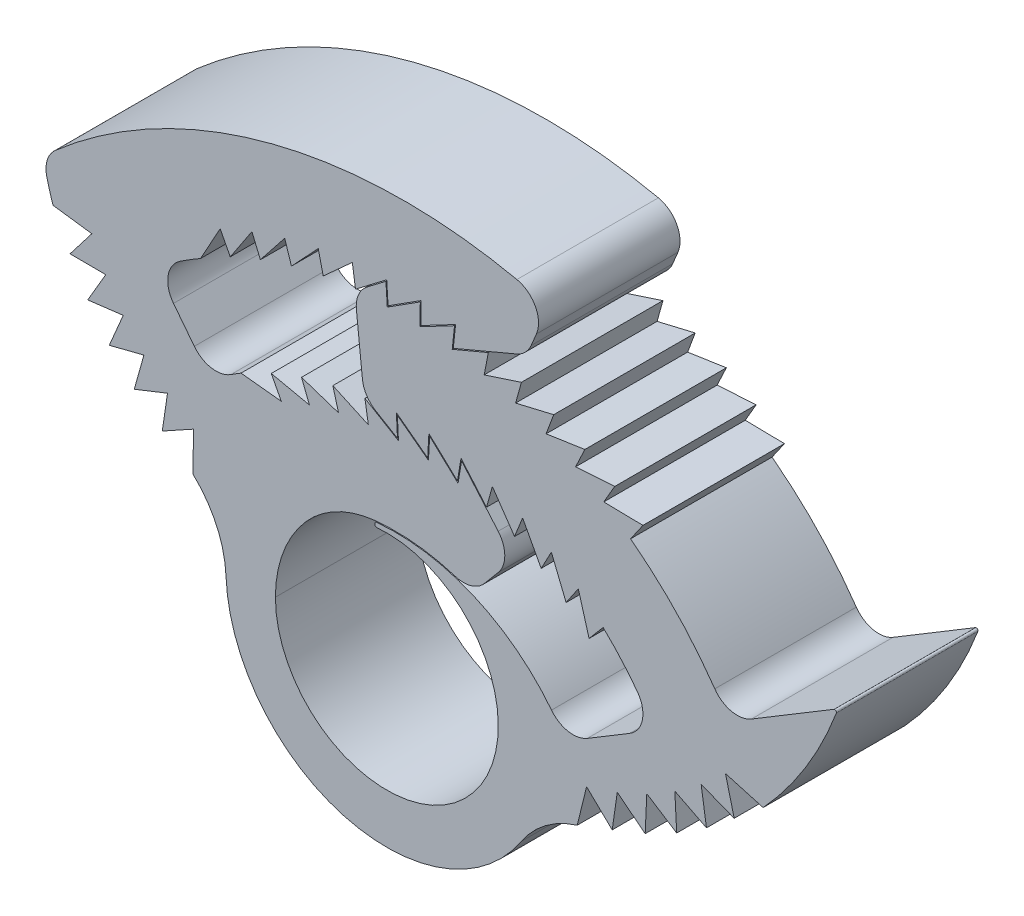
ISO-10303-21;
HEADER;
FILE_DESCRIPTION(('STEP AP214'),'2;1');
FILE_NAME('part.step','',(''),(''),'','','');
FILE_SCHEMA(('AUTOMOTIVE_DESIGN { 1 0 10303 214 1 1 1 1 }'));
ENDSEC;
DATA;
#1=APPLICATION_CONTEXT('core data for automotive mechanical design processes');
#2=APPLICATION_PROTOCOL_DEFINITION('international standard','automotive_design',2000,#1);
#3=PRODUCT_CONTEXT('',#1,'mechanical');
#4=PRODUCT('Part','Part','',(#3));
#5=PRODUCT_RELATED_PRODUCT_CATEGORY('part','',(#4));
#6=PRODUCT_DEFINITION_FORMATION('','',#4);
#7=PRODUCT_DEFINITION_CONTEXT('part definition',#1,'design');
#8=PRODUCT_DEFINITION('design','',#6,#7);
#9=PRODUCT_DEFINITION_SHAPE('','',#8);
#10=(LENGTH_UNIT() NAMED_UNIT(*) SI_UNIT(.MILLI.,.METRE.));
#11=(NAMED_UNIT(*) PLANE_ANGLE_UNIT() SI_UNIT($,.RADIAN.));
#12=(NAMED_UNIT(*) SI_UNIT($,.STERADIAN.) SOLID_ANGLE_UNIT());
#13=UNCERTAINTY_MEASURE_WITH_UNIT(LENGTH_MEASURE(1.E-05),#10,'distance_accuracy_value','');
#14=(GEOMETRIC_REPRESENTATION_CONTEXT(3) GLOBAL_UNCERTAINTY_ASSIGNED_CONTEXT((#13)) GLOBAL_UNIT_ASSIGNED_CONTEXT((#10,
#11,#12)) REPRESENTATION_CONTEXT('',''));
#15=CARTESIAN_POINT('',(0.,0.,0.));
#16=DIRECTION('',(0.,0.,1.));
#17=DIRECTION('',(1.,0.,0.));
#18=AXIS2_PLACEMENT_3D('',#15,#16,#17);
#19=CARTESIAN_POINT('',(0.243104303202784,-7.10048294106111,2.));
#20=DIRECTION('',(0.,0.,-1.));
#21=DIRECTION('',(-1.,0.,0.));
#22=AXIS2_PLACEMENT_3D('',#19,#20,#21);
#23=CYLINDRICAL_SURFACE('',#22,8.54172349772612);
#24=CARTESIAN_POINT('',(0.243104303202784,-7.10048294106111,-2.));
#25=DIRECTION('',(0.,0.,1.));
#26=DIRECTION('',(1.,0.,0.));
#27=AXIS2_PLACEMENT_3D('',#24,#25,#26);
#28=CIRCLE('',#27,8.54172349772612);
#29=CARTESIAN_POINT('',(7.08449095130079,-1.9861433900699,-2.));
#30=VERTEX_POINT('',#29);
#31=CARTESIAN_POINT('',(6.11408536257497,-0.896240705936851,-2.));
#32=VERTEX_POINT('',#31);
#33=EDGE_CURVE('E932',#30,#32,#28,.T.);
#34=ORIENTED_EDGE('',*,*,#33,.F.);
#35=DIRECTION('',(0.,0.,-1.));
#36=VECTOR('',#35,1.);
#37=CARTESIAN_POINT('',(7.08449095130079,-1.9861433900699,2.));
#38=LINE('',#37,#36);
#39=CARTESIAN_POINT('',(7.08449095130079,-1.9861433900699,2.));
#40=VERTEX_POINT('',#39);
#41=EDGE_CURVE('E1015',#30,#40,#38,.F.);
#42=ORIENTED_EDGE('',*,*,#41,.T.);
#43=CARTESIAN_POINT('',(0.243104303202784,-7.10048294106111,2.));
#44=DIRECTION('',(0.,0.,1.));
#45=DIRECTION('',(1.,0.,0.));
#46=AXIS2_PLACEMENT_3D('',#43,#44,#45);
#47=CIRCLE('',#46,8.54172349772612);
#48=CARTESIAN_POINT('',(6.11408536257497,-0.896240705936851,2.));
#49=VERTEX_POINT('',#48);
#50=EDGE_CURVE('E898',#40,#49,#47,.T.);
#51=ORIENTED_EDGE('',*,*,#50,.T.);
#52=DIRECTION('',(0.,0.,-1.));
#53=VECTOR('',#52,1.);
#54=CARTESIAN_POINT('',(6.11408536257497,-0.896240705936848,2.));
#55=LINE('',#54,#53);
#56=EDGE_CURVE('E1242',#49,#32,#55,.T.);
#57=ORIENTED_EDGE('',*,*,#56,.T.);
#58=EDGE_LOOP('',(#34,#42,#51,#57));
#59=FACE_BOUND('',#58,.T.);
#60=ADVANCED_FACE('F36',(#59),#23,.F.);
#61=CARTESIAN_POINT('',(0.243104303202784,-7.10048294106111,2.));
#62=DIRECTION('',(0.,0.,-1.));
#63=DIRECTION('',(-1.,0.,0.));
#64=AXIS2_PLACEMENT_3D('',#61,#62,#63);
#65=CYLINDRICAL_SURFACE('',#64,10.9975434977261);
#66=CARTESIAN_POINT('',(0.243104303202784,-7.10048294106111,2.));
#67=DIRECTION('',(0.,0.,1.));
#68=DIRECTION('',(1.,0.,0.));
#69=AXIS2_PLACEMENT_3D('',#66,#67,#68);
#70=CIRCLE('',#69,10.9975434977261);
#71=CARTESIAN_POINT('',(9.27078822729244,-0.819807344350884,2.));
#72=VERTEX_POINT('',#71);
#73=CARTESIAN_POINT('',(6.88937341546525,1.66154136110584,2.));
#74=VERTEX_POINT('',#73);
#75=EDGE_CURVE('E893',#72,#74,#70,.T.);
#76=ORIENTED_EDGE('',*,*,#75,.F.);
#77=DIRECTION('',(0.,0.,-1.));
#78=VECTOR('',#77,1.);
#79=CARTESIAN_POINT('',(9.27078822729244,-0.819807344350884,2.));
#80=LINE('',#79,#78);
#81=CARTESIAN_POINT('',(9.27078822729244,-0.819807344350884,-2.));
#82=VERTEX_POINT('',#81);
#83=EDGE_CURVE('E1017',#72,#82,#80,.T.);
#84=ORIENTED_EDGE('',*,*,#83,.T.);
#85=CARTESIAN_POINT('',(0.243104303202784,-7.10048294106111,-2.));
#86=DIRECTION('',(0.,0.,1.));
#87=DIRECTION('',(1.,0.,0.));
#88=AXIS2_PLACEMENT_3D('',#85,#86,#87);
#89=CIRCLE('',#88,10.9975434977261);
#90=CARTESIAN_POINT('',(6.88937341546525,1.66154136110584,-2.));
#91=VERTEX_POINT('',#90);
#92=EDGE_CURVE('E927',#82,#91,#89,.T.);
#93=ORIENTED_EDGE('',*,*,#92,.T.);
#94=DIRECTION('',(0.,0.,-1.));
#95=VECTOR('',#94,1.);
#96=CARTESIAN_POINT('',(6.88937341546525,1.66154136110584,2.));
#97=LINE('',#96,#95);
#98=EDGE_CURVE('E1345',#74,#91,#97,.T.);
#99=ORIENTED_EDGE('',*,*,#98,.F.);
#100=EDGE_LOOP('',(#76,#84,#93,#99));
#101=FACE_BOUND('',#100,.T.);
#102=ADVANCED_FACE('F2051',(#101),#65,.T.);
#103=CARTESIAN_POINT('',(0.243104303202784,-7.10048294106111,2.));
#104=DIRECTION('',(0.,0.,-1.));
#105=DIRECTION('',(-1.,0.,0.));
#106=AXIS2_PLACEMENT_3D('',#103,#104,#105);
#107=CYLINDRICAL_SURFACE('',#106,8.51632349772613);
#108=CARTESIAN_POINT('',(0.243104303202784,-7.10048294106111,-2.));
#109=DIRECTION('',(0.,0.,1.));
#110=DIRECTION('',(1.,0.,0.));
#111=AXIS2_PLACEMENT_3D('',#108,#109,#110);
#112=CIRCLE('',#111,8.51632349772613);
#113=CARTESIAN_POINT('',(-4.12273004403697,0.211647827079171,-2.));
#114=VERTEX_POINT('',#113);
#115=CARTESIAN_POINT('',(-4.40635583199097,0.0346615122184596,-2.));
#116=VERTEX_POINT('',#115);
#117=EDGE_CURVE('E868',#114,#116,#112,.T.);
#118=ORIENTED_EDGE('',*,*,#117,.T.);
#119=DIRECTION('',(0.,0.,-1.));
#120=VECTOR('',#119,1.);
#121=CARTESIAN_POINT('',(-4.40635583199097,0.0346615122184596,2.));
#122=LINE('',#121,#120);
#123=CARTESIAN_POINT('',(-4.40635583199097,0.0346615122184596,2.));
#124=VERTEX_POINT('',#123);
#125=EDGE_CURVE('E1080',#116,#124,#122,.F.);
#126=ORIENTED_EDGE('',*,*,#125,.T.);
#127=CARTESIAN_POINT('',(0.243104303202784,-7.10048294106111,2.));
#128=DIRECTION('',(0.,0.,1.));
#129=DIRECTION('',(1.,0.,0.));
#130=AXIS2_PLACEMENT_3D('',#127,#128,#129);
#131=CIRCLE('',#130,8.51632349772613);
#132=CARTESIAN_POINT('',(-4.12273004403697,0.211647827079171,2.));
#133=VERTEX_POINT('',#132);
#134=EDGE_CURVE('E867',#133,#124,#131,.T.);
#135=ORIENTED_EDGE('',*,*,#134,.F.);
#136=DIRECTION('',(0.,0.,1.));
#137=VECTOR('',#136,1.);
#138=CARTESIAN_POINT('',(-4.12273004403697,0.211647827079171,-2.));
#139=LINE('',#138,#137);
#140=EDGE_CURVE('E1498',#114,#133,#139,.T.);
#141=ORIENTED_EDGE('',*,*,#140,.F.);
#142=EDGE_LOOP('',(#118,#126,#135,#141));
#143=FACE_BOUND('',#142,.T.);
#144=ADVANCED_FACE('F1790',(#143),#107,.T.);
#145=CARTESIAN_POINT('',(-3.28956697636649,-2.55864895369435,2.));
#146=DIRECTION('',(0.789340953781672,0.613955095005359,0.));
#147=DIRECTION('',(-0.613955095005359,0.789340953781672,0.));
#148=AXIS2_PLACEMENT_3D('',#145,#146,#147);
#149=PLANE('',#148);
#150=DIRECTION('',(0.613955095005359,-0.789340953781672,0.));
#151=VECTOR('',#150,1.);
#152=CARTESIAN_POINT('',(-3.28956697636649,-2.55864895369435,2.));
#153=LINE('',#152,#151);
#154=CARTESIAN_POINT('',(-6.03040935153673,0.965157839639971,2.));
#155=VERTEX_POINT('',#154);
#156=CARTESIAN_POINT('',(-5.44166901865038,0.208234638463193,2.));
#157=VERTEX_POINT('',#156);
#158=EDGE_CURVE('E885',#155,#157,#153,.T.);
#159=ORIENTED_EDGE('',*,*,#158,.T.);
#160=DIRECTION('',(0.,0.,-1.));
#161=VECTOR('',#160,1.);
#162=CARTESIAN_POINT('',(-5.44166901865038,0.208234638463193,2.));
#163=LINE('',#162,#161);
#164=CARTESIAN_POINT('',(-5.44166901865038,0.208234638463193,-2.));
#165=VERTEX_POINT('',#164);
#166=EDGE_CURVE('E1077',#157,#165,#163,.T.);
#167=ORIENTED_EDGE('',*,*,#166,.T.);
#168=DIRECTION('',(0.613955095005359,-0.789340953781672,0.));
#169=VECTOR('',#168,1.);
#170=CARTESIAN_POINT('',(-3.28956697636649,-2.55864895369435,-2.));
#171=LINE('',#170,#169);
#172=CARTESIAN_POINT('',(-6.03040935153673,0.965157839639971,-2.));
#173=VERTEX_POINT('',#172);
#174=EDGE_CURVE('E881',#173,#165,#171,.T.);
#175=ORIENTED_EDGE('',*,*,#174,.F.);
#176=DIRECTION('',(0.,0.,-1.));
#177=VECTOR('',#176,1.);
#178=CARTESIAN_POINT('',(-6.03040935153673,0.965157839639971,2.));
#179=LINE('',#178,#177);
#180=EDGE_CURVE('E1075',#173,#155,#179,.F.);
#181=ORIENTED_EDGE('',*,*,#180,.T.);
#182=EDGE_LOOP('',(#159,#167,#175,#181));
#183=FACE_BOUND('',#182,.T.);
#184=ADVANCED_FACE('F1798',(#183),#149,.T.);
#185=CARTESIAN_POINT('',(0.508412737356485,-8.30265739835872,2.));
#186=DIRECTION('',(0.,0.,-1.));
#187=DIRECTION('',(-1.,0.,0.));
#188=AXIS2_PLACEMENT_3D('',#185,#186,#187);
#189=CYLINDRICAL_SURFACE('',#188,15.0423152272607);
#190=CARTESIAN_POINT('',(0.508412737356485,-8.30265739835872,-2.));
#191=DIRECTION('',(0.,0.,1.));
#192=DIRECTION('',(1.,0.,0.));
#193=AXIS2_PLACEMENT_3D('',#190,#191,#192);
#194=CIRCLE('',#193,15.0423152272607);
#195=CARTESIAN_POINT('',(3.67617166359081,6.40232647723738,-2.));
#196=VERTEX_POINT('',#195);
#197=CARTESIAN_POINT('',(-9.36843597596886,3.04278692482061,-2.));
#198=VERTEX_POINT('',#197);
#199=EDGE_CURVE('E921',#196,#198,#194,.T.);
#200=ORIENTED_EDGE('',*,*,#199,.T.);
#201=DIRECTION('',(0.,0.,-1.));
#202=VECTOR('',#201,1.);
#203=CARTESIAN_POINT('',(-9.36843597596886,3.04278692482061,2.));
#204=LINE('',#203,#202);
#205=CARTESIAN_POINT('',(-9.36843597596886,3.04278692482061,2.));
#206=VERTEX_POINT('',#205);
#207=EDGE_CURVE('E1042',#198,#206,#204,.F.);
#208=ORIENTED_EDGE('',*,*,#207,.T.);
#209=CARTESIAN_POINT('',(0.508412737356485,-8.30265739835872,2.));
#210=DIRECTION('',(0.,0.,1.));
#211=DIRECTION('',(1.,0.,0.));
#212=AXIS2_PLACEMENT_3D('',#209,#210,#211);
#213=CIRCLE('',#212,15.0423152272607);
#214=CARTESIAN_POINT('',(3.67617166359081,6.40232647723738,2.));
#215=VERTEX_POINT('',#214);
#216=EDGE_CURVE('E888',#215,#206,#213,.T.);
#217=ORIENTED_EDGE('',*,*,#216,.F.);
#218=DIRECTION('',(0.,0.,-1.));
#219=VECTOR('',#218,1.);
#220=CARTESIAN_POINT('',(3.67617166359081,6.40232647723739,2.));
#221=LINE('',#220,#219);
#222=EDGE_CURVE('E1039',#215,#196,#221,.T.);
#223=ORIENTED_EDGE('',*,*,#222,.T.);
#224=EDGE_LOOP('',(#200,#208,#217,#223));
#225=FACE_BOUND('',#224,.T.);
#226=ADVANCED_FACE('F1893',(#225),#189,.T.);
#227=CARTESIAN_POINT('',(0.,-4.7875,2.));
#228=DIRECTION('',(0.,0.,-1.));
#229=DIRECTION('',(-1.,0.,0.));
#230=AXIS2_PLACEMENT_3D('',#227,#228,#229);
#231=CYLINDRICAL_SURFACE('',#230,4.55);
#232=CARTESIAN_POINT('',(0.,-4.7875,-2.));
#233=DIRECTION('',(0.,0.,1.));
#234=DIRECTION('',(1.,0.,0.));
#235=AXIS2_PLACEMENT_3D('',#232,#233,#234);
#236=CIRCLE('',#235,4.55);
#237=CARTESIAN_POINT('',(3.79806683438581,-7.29293176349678,-2.));
#238=VERTEX_POINT('',#237);
#239=CARTESIAN_POINT('',(-4.54626297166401,-4.9718718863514,-2.));
#240=VERTEX_POINT('',#239);
#241=EDGE_CURVE('E924',#238,#240,#236,.F.);
#242=ORIENTED_EDGE('',*,*,#241,.F.);
#243=DIRECTION('',(0.,0.,-1.));
#244=VECTOR('',#243,1.);
#245=CARTESIAN_POINT('',(3.79806683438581,-7.29293176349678,2.));
#246=LINE('',#245,#244);
#247=CARTESIAN_POINT('',(3.79806683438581,-7.29293176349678,2.));
#248=VERTEX_POINT('',#247);
#249=EDGE_CURVE('E56',#238,#248,#246,.F.);
#250=ORIENTED_EDGE('',*,*,#249,.T.);
#251=CARTESIAN_POINT('',(0.,-4.7875,2.));
#252=DIRECTION('',(0.,0.,1.));
#253=DIRECTION('',(1.,0.,0.));
#254=AXIS2_PLACEMENT_3D('',#251,#252,#253);
#255=CIRCLE('',#254,4.55);
#256=CARTESIAN_POINT('',(-4.54626297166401,-4.9718718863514,2.));
#257=VERTEX_POINT('',#256);
#258=EDGE_CURVE('E891',#248,#257,#255,.F.);
#259=ORIENTED_EDGE('',*,*,#258,.T.);
#260=DIRECTION('',(0.,0.,-1.));
#261=VECTOR('',#260,1.);
#262=CARTESIAN_POINT('',(-4.54626297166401,-4.9718718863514,2.));
#263=LINE('',#262,#261);
#264=EDGE_CURVE('E1118',#257,#240,#263,.T.);
#265=ORIENTED_EDGE('',*,*,#264,.T.);
#266=EDGE_LOOP('',(#242,#250,#259,#265));
#267=FACE_BOUND('',#266,.T.);
#268=ADVANCED_FACE('F2310',(#267),#231,.T.);
#269=CARTESIAN_POINT('',(-0.497688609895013,-0.0523091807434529,2.));
#270=DIRECTION('',(0.994521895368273,0.104528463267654,0.));
#271=DIRECTION('',(-0.104528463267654,0.994521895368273,0.));
#272=AXIS2_PLACEMENT_3D('',#269,#270,#271);
#273=PLANE('',#272);
#274=DIRECTION('',(0.104528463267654,-0.994521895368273,0.));
#275=VECTOR('',#274,1.);
#276=CARTESIAN_POINT('',(-0.497688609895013,-0.0523091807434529,2.));
#277=LINE('',#276,#275);
#278=CARTESIAN_POINT('',(-0.860877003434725,3.40319756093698,2.));
#279=VERTEX_POINT('',#278);
#280=CARTESIAN_POINT('',(-0.69034118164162,1.78065759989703,2.));
#281=VERTEX_POINT('',#280);
#282=EDGE_CURVE('E895',#279,#281,#277,.T.);
#283=ORIENTED_EDGE('',*,*,#282,.F.);
#284=DIRECTION('',(0.,0.,-1.));
#285=VECTOR('',#284,1.);
#286=CARTESIAN_POINT('',(-0.860877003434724,3.40319756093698,2.));
#287=LINE('',#286,#285);
#288=CARTESIAN_POINT('',(-0.860877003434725,3.40319756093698,-2.));
#289=VERTEX_POINT('',#288);
#290=EDGE_CURVE('E1067',#279,#289,#287,.T.);
#291=ORIENTED_EDGE('',*,*,#290,.T.);
#292=DIRECTION('',(0.104528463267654,-0.994521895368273,0.));
#293=VECTOR('',#292,1.);
#294=CARTESIAN_POINT('',(-0.497688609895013,-0.0523091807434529,-2.));
#295=LINE('',#294,#293);
#296=CARTESIAN_POINT('',(-0.69034118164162,1.78065759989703,-2.));
#297=VERTEX_POINT('',#296);
#298=EDGE_CURVE('E929',#289,#297,#295,.T.);
#299=ORIENTED_EDGE('',*,*,#298,.T.);
#300=DIRECTION('',(0.,0.,-1.));
#301=VECTOR('',#300,1.);
#302=CARTESIAN_POINT('',(-0.69034118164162,1.78065759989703,2.));
#303=LINE('',#302,#301);
#304=EDGE_CURVE('E1065',#297,#281,#303,.F.);
#305=ORIENTED_EDGE('',*,*,#304,.T.);
#306=EDGE_LOOP('',(#283,#291,#299,#305));
#307=FACE_BOUND('',#306,.T.);
#308=ADVANCED_FACE('F2149',(#307),#273,.F.);
#309=CARTESIAN_POINT('',(3.20229689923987,-5.31885709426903,2.));
#310=DIRECTION('',(-0.515795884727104,0.856711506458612,0.));
#311=DIRECTION('',(-0.856711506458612,-0.515795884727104,0.));
#312=AXIS2_PLACEMENT_3D('',#309,#310,#311);
#313=PLANE('',#312);
#314=DIRECTION('',(0.856711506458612,0.515795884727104,0.));
#315=VECTOR('',#314,1.);
#316=CARTESIAN_POINT('',(3.20229689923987,-5.31885709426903,2.));
#317=LINE('',#316,#315);
#318=CARTESIAN_POINT('',(5.6658837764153,-3.83561803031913,2.));
#319=VERTEX_POINT('',#318);
#320=CARTESIAN_POINT('',(6.8634068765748,-3.11463146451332,2.));
#321=VERTEX_POINT('',#320);
#322=EDGE_CURVE('E900',#319,#321,#317,.T.);
#323=ORIENTED_EDGE('',*,*,#322,.T.);
#324=DIRECTION('',(0.,0.,1.));
#325=VECTOR('',#324,1.);
#326=CARTESIAN_POINT('',(6.8634068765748,-3.11463146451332,-2.));
#327=LINE('',#326,#325);
#328=CARTESIAN_POINT('',(6.8634068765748,-3.11463146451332,-2.));
#329=VERTEX_POINT('',#328);
#330=EDGE_CURVE('E1012',#321,#329,#327,.F.);
#331=ORIENTED_EDGE('',*,*,#330,.T.);
#332=DIRECTION('',(0.856711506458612,0.515795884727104,0.));
#333=VECTOR('',#332,1.);
#334=CARTESIAN_POINT('',(3.20229689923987,-5.31885709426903,-2.));
#335=LINE('',#334,#333);
#336=CARTESIAN_POINT('',(5.6658837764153,-3.83561803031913,-2.));
#337=VERTEX_POINT('',#336);
#338=EDGE_CURVE('E934',#337,#329,#335,.T.);
#339=ORIENTED_EDGE('',*,*,#338,.F.);
#340=DIRECTION('',(0.,0.,-1.));
#341=VECTOR('',#340,1.);
#342=CARTESIAN_POINT('',(5.6658837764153,-3.83561803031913,2.));
#343=LINE('',#342,#341);
#344=EDGE_CURVE('E1010',#337,#319,#343,.F.);
#345=ORIENTED_EDGE('',*,*,#344,.T.);
#346=EDGE_LOOP('',(#323,#331,#339,#345));
#347=FACE_BOUND('',#346,.T.);
#348=ADVANCED_FACE('F2246',(#347),#313,.T.);
#349=CARTESIAN_POINT('',(0.243104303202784,-7.10048294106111,2.));
#350=DIRECTION('',(0.,0.,-1.));
#351=DIRECTION('',(-1.,0.,0.));
#352=AXIS2_PLACEMENT_3D('',#349,#350,#351);
#353=CYLINDRICAL_SURFACE('',#352,5.60172349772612);
#354=CARTESIAN_POINT('',(0.243104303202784,-7.10048294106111,2.));
#355=DIRECTION('',(0.,0.,1.));
#356=DIRECTION('',(1.,0.,0.));
#357=AXIS2_PLACEMENT_3D('',#354,#355,#356);
#358=CIRCLE('',#357,5.60172349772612);
#359=CARTESIAN_POINT('',(4.65526436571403,-3.6490847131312,2.));
#360=VERTEX_POINT('',#359);
#361=CARTESIAN_POINT('',(-0.295023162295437,-1.52466685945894,2.));
#362=VERTEX_POINT('',#361);
#363=EDGE_CURVE('E903',#360,#362,#358,.T.);
#364=ORIENTED_EDGE('',*,*,#363,.F.);
#365=DIRECTION('',(0.,0.,-1.));
#366=VECTOR('',#365,1.);
#367=CARTESIAN_POINT('',(4.65526436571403,-3.6490847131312,2.));
#368=LINE('',#367,#366);
#369=CARTESIAN_POINT('',(4.65526436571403,-3.6490847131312,-2.));
#370=VERTEX_POINT('',#369);
#371=EDGE_CURVE('E1095',#360,#370,#368,.T.);
#372=ORIENTED_EDGE('',*,*,#371,.T.);
#373=CARTESIAN_POINT('',(0.243104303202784,-7.10048294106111,-2.));
#374=DIRECTION('',(0.,0.,1.));
#375=DIRECTION('',(1.,0.,0.));
#376=AXIS2_PLACEMENT_3D('',#373,#374,#375);
#377=CIRCLE('',#376,5.60172349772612);
#378=CARTESIAN_POINT('',(-0.295023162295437,-1.52466685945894,-2.));
#379=VERTEX_POINT('',#378);
#380=EDGE_CURVE('E937',#370,#379,#377,.T.);
#381=ORIENTED_EDGE('',*,*,#380,.T.);
#382=DIRECTION('',(0.,0.,-1.));
#383=VECTOR('',#382,1.);
#384=CARTESIAN_POINT('',(-0.295023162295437,-1.52466685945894,2.));
#385=LINE('',#384,#383);
#386=EDGE_CURVE('E1004',#379,#362,#385,.F.);
#387=ORIENTED_EDGE('',*,*,#386,.T.);
#388=EDGE_LOOP('',(#364,#372,#381,#387));
#389=FACE_BOUND('',#388,.T.);
#390=ADVANCED_FACE('F2255',(#389),#353,.T.);
#391=CARTESIAN_POINT('',(-0.497688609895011,-0.0523091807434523,2.));
#392=DIRECTION('',(-0.994521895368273,-0.104528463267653,0.));
#393=DIRECTION('',(0.104528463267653,-0.994521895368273,0.));
#394=AXIS2_PLACEMENT_3D('',#391,#392,#393);
#395=PLANE('',#394);
#396=DIRECTION('',(-0.104528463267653,0.994521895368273,0.));
#397=VECTOR('',#396,1.);
#398=CARTESIAN_POINT('',(-0.497688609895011,-0.0523091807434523,2.));
#399=LINE('',#398,#397);
#400=CARTESIAN_POINT('',(-0.33416713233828,-1.60811211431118,2.));
#401=VERTEX_POINT('',#400);
#402=CARTESIAN_POINT('',(-0.33747526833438,-1.57663730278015,2.));
#403=VERTEX_POINT('',#402);
#404=EDGE_CURVE('E905',#401,#403,#399,.T.);
#405=ORIENTED_EDGE('',*,*,#404,.T.);
#406=DIRECTION('',(0.,0.,1.));
#407=VECTOR('',#406,1.);
#408=CARTESIAN_POINT('',(-0.33747526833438,-1.57663730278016,-2.));
#409=LINE('',#408,#407);
#410=CARTESIAN_POINT('',(-0.33747526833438,-1.57663730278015,-2.));
#411=VERTEX_POINT('',#410);
#412=EDGE_CURVE('E1001',#403,#411,#409,.F.);
#413=ORIENTED_EDGE('',*,*,#412,.T.);
#414=DIRECTION('',(-0.104528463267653,0.994521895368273,0.));
#415=VECTOR('',#414,1.);
#416=CARTESIAN_POINT('',(-0.497688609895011,-0.0523091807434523,-2.));
#417=LINE('',#416,#415);
#418=CARTESIAN_POINT('',(-0.33416713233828,-1.60811211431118,-2.));
#419=VERTEX_POINT('',#418);
#420=EDGE_CURVE('E939',#419,#411,#417,.T.);
#421=ORIENTED_EDGE('',*,*,#420,.F.);
#422=DIRECTION('',(0.,0.,1.));
#423=VECTOR('',#422,1.);
#424=CARTESIAN_POINT('',(-0.33416713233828,-1.60811211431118,2.));
#425=LINE('',#424,#423);
#426=EDGE_CURVE('E999',#419,#401,#425,.T.);
#427=ORIENTED_EDGE('',*,*,#426,.T.);
#428=EDGE_LOOP('',(#405,#413,#421,#427));
#429=FACE_BOUND('',#428,.T.);
#430=ADVANCED_FACE('F2263',(#429),#395,.T.);
#431=CARTESIAN_POINT('',(0.,-4.7875,2.));
#432=DIRECTION('',(0.,0.,-1.));
#433=DIRECTION('',(-1.,0.,0.));
#434=AXIS2_PLACEMENT_3D('',#431,#432,#433);
#435=CYLINDRICAL_SURFACE('',#434,3.15);
#436=CARTESIAN_POINT('',(0.,-4.7875,2.));
#437=DIRECTION('',(0.,0.,1.));
#438=DIRECTION('',(1.,0.,0.));
#439=AXIS2_PLACEMENT_3D('',#436,#437,#438);
#440=CIRCLE('',#439,3.15);
#441=CARTESIAN_POINT('',(-0.282931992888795,-1.65023216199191,2.));
#442=VERTEX_POINT('',#441);
#443=CARTESIAN_POINT('',(-3.15,-4.7875,2.));
#444=VERTEX_POINT('',#443);
#445=EDGE_CURVE('E908',#442,#444,#440,.F.);
#446=ORIENTED_EDGE('',*,*,#445,.F.);
#447=DIRECTION('',(0.,0.,-1.));
#448=VECTOR('',#447,1.);
#449=CARTESIAN_POINT('',(-0.282931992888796,-1.65023216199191,2.));
#450=LINE('',#449,#448);
#451=CARTESIAN_POINT('',(-0.282931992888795,-1.65023216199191,-2.));
#452=VERTEX_POINT('',#451);
#453=EDGE_CURVE('E1007',#442,#452,#450,.T.);
#454=ORIENTED_EDGE('',*,*,#453,.T.);
#455=CARTESIAN_POINT('',(0.,-4.7875,-2.));
#456=DIRECTION('',(0.,0.,1.));
#457=DIRECTION('',(1.,0.,0.));
#458=AXIS2_PLACEMENT_3D('',#455,#456,#457);
#459=CIRCLE('',#458,3.15);
#460=CARTESIAN_POINT('',(-3.15,-4.7875,-2.));
#461=VERTEX_POINT('',#460);
#462=EDGE_CURVE('E942',#452,#461,#459,.F.);
#463=ORIENTED_EDGE('',*,*,#462,.T.);
#464=DIRECTION('',(0.,0.,-1.));
#465=VECTOR('',#464,1.);
#466=CARTESIAN_POINT('',(-3.15,-4.7875,2.));
#467=LINE('',#466,#465);
#468=EDGE_CURVE('E955',#444,#461,#467,.T.);
#469=ORIENTED_EDGE('',*,*,#468,.F.);
#470=EDGE_LOOP('',(#446,#454,#463,#469));
#471=FACE_BOUND('',#470,.T.);
#472=ADVANCED_FACE('F2274',(#471),#435,.F.);
#473=CARTESIAN_POINT('',(0.297604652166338,-4.7875,2.));
#474=DIRECTION('',(0.,0.,-1.));
#475=DIRECTION('',(-1.,0.,0.));
#476=AXIS2_PLACEMENT_3D('',#473,#474,#475);
#477=CYLINDRICAL_SURFACE('',#476,3.44760465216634);
#478=CARTESIAN_POINT('',(0.297604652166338,-4.7875,-2.));
#479=DIRECTION('',(0.,0.,1.));
#480=DIRECTION('',(1.,0.,0.));
#481=AXIS2_PLACEMENT_3D('',#478,#479,#480);
#482=CIRCLE('',#481,3.44760465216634);
#483=CARTESIAN_POINT('',(-2.28447669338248,-2.50302330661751,-2.));
#484=VERTEX_POINT('',#483);
#485=EDGE_CURVE('E944',#461,#484,#482,.F.);
#486=ORIENTED_EDGE('',*,*,#485,.T.);
#487=DIRECTION('',(0.,0.,-1.));
#488=VECTOR('',#487,1.);
#489=CARTESIAN_POINT('',(-2.28447669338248,-2.50302330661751,2.));
#490=LINE('',#489,#488);
#491=CARTESIAN_POINT('',(-2.28447669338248,-2.50302330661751,2.));
#492=VERTEX_POINT('',#491);
#493=EDGE_CURVE('E953',#492,#484,#490,.T.);
#494=ORIENTED_EDGE('',*,*,#493,.F.);
#495=CARTESIAN_POINT('',(0.297604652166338,-4.7875,2.));
#496=DIRECTION('',(0.,0.,1.));
#497=DIRECTION('',(1.,0.,0.));
#498=AXIS2_PLACEMENT_3D('',#495,#496,#497);
#499=CIRCLE('',#498,3.44760465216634);
#500=EDGE_CURVE('E910',#444,#492,#499,.F.);
#501=ORIENTED_EDGE('',*,*,#500,.F.);
#502=ORIENTED_EDGE('',*,*,#468,.T.);
#503=EDGE_LOOP('',(#486,#494,#501,#502));
#504=FACE_BOUND('',#503,.T.);
#505=ADVANCED_FACE('F2279',(#504),#477,.F.);
#506=CARTESIAN_POINT('',(-0.0305115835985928,-4.49720167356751,2.));
#507=DIRECTION('',(0.,0.,-1.));
#508=DIRECTION('',(-1.,0.,0.));
#509=AXIS2_PLACEMENT_3D('',#506,#507,#508);
#510=CYLINDRICAL_SURFACE('',#509,3.0095026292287);
#511=CARTESIAN_POINT('',(-0.0305115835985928,-4.49720167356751,-2.));
#512=DIRECTION('',(0.,0.,1.));
#513=DIRECTION('',(1.,0.,0.));
#514=AXIS2_PLACEMENT_3D('',#511,#512,#513);
#515=CIRCLE('',#514,3.0095026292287);
#516=CARTESIAN_POINT('',(-0.345090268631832,-1.50418541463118,-2.));
#517=VERTEX_POINT('',#516);
#518=EDGE_CURVE('E947',#517,#484,#515,.T.);
#519=ORIENTED_EDGE('',*,*,#518,.F.);
#520=DIRECTION('',(0.,0.,-1.));
#521=VECTOR('',#520,1.);
#522=CARTESIAN_POINT('',(-0.345090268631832,-1.50418541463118,2.));
#523=LINE('',#522,#521);
#524=CARTESIAN_POINT('',(-0.345090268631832,-1.50418541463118,2.));
#525=VERTEX_POINT('',#524);
#526=EDGE_CURVE('E918',#525,#517,#523,.T.);
#527=ORIENTED_EDGE('',*,*,#526,.F.);
#528=CARTESIAN_POINT('',(-0.0305115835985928,-4.49720167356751,2.));
#529=DIRECTION('',(0.,0.,1.));
#530=DIRECTION('',(1.,0.,0.));
#531=AXIS2_PLACEMENT_3D('',#528,#529,#530);
#532=CIRCLE('',#531,3.0095026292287);
#533=EDGE_CURVE('E912',#525,#492,#532,.T.);
#534=ORIENTED_EDGE('',*,*,#533,.T.);
#535=ORIENTED_EDGE('',*,*,#493,.T.);
#536=EDGE_LOOP('',(#519,#527,#534,#535));
#537=FACE_BOUND('',#536,.T.);
#538=ADVANCED_FACE('F2285',(#537),#510,.F.);
#539=CARTESIAN_POINT('',(0.243104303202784,-7.10048294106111,2.));
#540=DIRECTION('',(0.,0.,-1.));
#541=DIRECTION('',(-1.,0.,0.));
#542=AXIS2_PLACEMENT_3D('',#539,#540,#541);
#543=CYLINDRICAL_SURFACE('',#542,5.62712349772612);
#544=CARTESIAN_POINT('',(0.243104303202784,-7.10048294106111,-2.));
#545=DIRECTION('',(0.,0.,1.));
#546=DIRECTION('',(1.,0.,0.));
#547=AXIS2_PLACEMENT_3D('',#544,#545,#546);
#548=CIRCLE('',#547,5.62712349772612);
#549=CARTESIAN_POINT('',(1.93544097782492,-1.73387177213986,-2.));
#550=VERTEX_POINT('',#549);
#551=EDGE_CURVE('E889',#517,#550,#548,.F.);
#552=ORIENTED_EDGE('',*,*,#551,.T.);
#553=DIRECTION('',(0.,0.,-1.));
#554=VECTOR('',#553,1.);
#555=CARTESIAN_POINT('',(1.93544097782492,-1.73387177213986,2.));
#556=LINE('',#555,#554);
#557=CARTESIAN_POINT('',(1.93544097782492,-1.73387177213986,2.));
#558=VERTEX_POINT('',#557);
#559=EDGE_CURVE('E1090',#550,#558,#556,.F.);
#560=ORIENTED_EDGE('',*,*,#559,.T.);
#561=CARTESIAN_POINT('',(0.243104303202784,-7.10048294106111,2.));
#562=DIRECTION('',(0.,0.,1.));
#563=DIRECTION('',(1.,0.,0.));
#564=AXIS2_PLACEMENT_3D('',#561,#562,#563);
#565=CIRCLE('',#564,5.62712349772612);
#566=EDGE_CURVE('E915',#525,#558,#565,.F.);
#567=ORIENTED_EDGE('',*,*,#566,.F.);
#568=ORIENTED_EDGE('',*,*,#526,.T.);
#569=EDGE_LOOP('',(#552,#560,#567,#568));
#570=FACE_BOUND('',#569,.T.);
#571=ADVANCED_FACE('F2288',(#570),#543,.F.);
#572=CARTESIAN_POINT('',(0.,0.,2.));
#573=DIRECTION('',(0.,0.,1.));
#574=DIRECTION('',(1.,0.,0.));
#575=AXIS2_PLACEMENT_3D('',#572,#573,#574);
#576=PLANE('',#575);
#577=ORIENTED_EDGE('',*,*,#216,.T.);
#578=CARTESIAN_POINT('',(-8.85933893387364,2.45799188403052,2.));
#579=DIRECTION('',(0.,0.,1.));
#580=DIRECTION('',(1.,0.,0.));
#581=AXIS2_PLACEMENT_3D('',#578,#579,#580);
#582=CIRCLE('',#581,0.775348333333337);
#583=CARTESIAN_POINT('',(-9.61195542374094,2.27162274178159,2.));
#584=VERTEX_POINT('',#583);
#585=EDGE_CURVE('E1056',#206,#584,#582,.T.);
#586=ORIENTED_EDGE('',*,*,#585,.T.);
#587=CARTESIAN_POINT('',(-1.83260313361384,4.19801052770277,2.));
#588=DIRECTION('',(0.,0.,1.));
#589=DIRECTION('',(1.,0.,0.));
#590=AXIS2_PLACEMENT_3D('',#587,#588,#589);
#591=CIRCLE('',#590,8.01431793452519);
#592=CARTESIAN_POINT('',(-9.43535491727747,1.66276748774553,2.));
#593=VERTEX_POINT('',#592);
#594=EDGE_CURVE('E855',#584,#593,#591,.T.);
#595=ORIENTED_EDGE('',*,*,#594,.T.);
#596=DIRECTION('',(-0.991216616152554,0.132248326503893,0.));
#597=VECTOR('',#596,1.);
#598=CARTESIAN_POINT('',(-9.43535491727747,1.66276748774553,2.));
#599=LINE('',#598,#597);
#600=CARTESIAN_POINT('',(-8.33847534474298,1.51642158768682,2.));
#601=VERTEX_POINT('',#600);
#602=EDGE_CURVE('E1230',#601,#593,#599,.T.);
#603=ORIENTED_EDGE('',*,*,#602,.F.);
#604=DIRECTION('',(0.610138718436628,0.792294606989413,0.));
#605=VECTOR('',#604,1.);
#606=CARTESIAN_POINT('',(-8.33847534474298,1.51642158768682,2.));
#607=LINE('',#606,#605);
#608=CARTESIAN_POINT('',(-8.9550555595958,0.715762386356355,2.));
#609=VERTEX_POINT('',#608);
#610=EDGE_CURVE('E1226',#609,#601,#607,.T.);
#611=ORIENTED_EDGE('',*,*,#610,.F.);
#612=DIRECTION('',(-0.999987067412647,0.00508576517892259,0.));
#613=VECTOR('',#612,1.);
#614=CARTESIAN_POINT('',(-9.05109614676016,0.716250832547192,2.));
#615=LINE('',#614,#613);
#616=CARTESIAN_POINT('',(-7.94451119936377,0.710622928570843,2.));
#617=VERTEX_POINT('',#616);
#618=EDGE_CURVE('E1201',#617,#609,#615,.T.);
#619=ORIENTED_EDGE('',*,*,#618,.F.);
#620=DIRECTION('',(0.504397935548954,0.863471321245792,0.));
#621=VECTOR('',#620,1.);
#622=CARTESIAN_POINT('',(-7.94451119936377,0.710622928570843,2.));
#623=LINE('',#622,#621);
#624=CARTESIAN_POINT('',(-8.45423428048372,-0.161964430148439,2.));
#625=VERTEX_POINT('',#624);
#626=EDGE_CURVE('E1199',#625,#617,#623,.T.);
#627=ORIENTED_EDGE('',*,*,#626,.F.);
#628=DIRECTION('',(-0.992510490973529,-0.122159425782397,0.));
#629=VECTOR('',#628,1.);
#630=CARTESIAN_POINT('',(-8.54955680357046,-0.173696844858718,2.));
#631=LINE('',#630,#629);
#632=CARTESIAN_POINT('',(-7.45124543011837,-0.0385153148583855,2.));
#633=VERTEX_POINT('',#632);
#634=EDGE_CURVE('E1182',#633,#625,#631,.T.);
#635=ORIENTED_EDGE('',*,*,#634,.F.);
#636=DIRECTION('',(0.39046207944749,0.92061901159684,0.));
#637=VECTOR('',#636,1.);
#638=CARTESIAN_POINT('',(-7.45124543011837,-0.0385153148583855,2.));
#639=LINE('',#638,#637);
#640=CARTESIAN_POINT('',(-7.84582978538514,-0.968853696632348,2.));
#641=VERTEX_POINT('',#640);
#642=EDGE_CURVE('E1180',#641,#633,#639,.T.);
#643=ORIENTED_EDGE('',*,*,#642,.F.);
#644=DIRECTION('',(-0.968908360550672,-0.247419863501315,0.));
#645=VECTOR('',#644,1.);
#646=CARTESIAN_POINT('',(-7.93888551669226,-0.992616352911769,2.));
#647=LINE('',#646,#645);
#648=CARTESIAN_POINT('',(-6.86669224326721,-0.718821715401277,2.));
#649=VERTEX_POINT('',#648);
#650=EDGE_CURVE('E1166',#649,#641,#647,.T.);
#651=ORIENTED_EDGE('',*,*,#650,.F.);
#652=DIRECTION('',(0.27018229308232,0.962809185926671,0.));
#653=VECTOR('',#652,1.);
#654=CARTESIAN_POINT('',(-6.86669224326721,-0.718821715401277,2.));
#655=LINE('',#654,#653);
#656=CARTESIAN_POINT('',(-7.13972696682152,-1.69179569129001,2.));
#657=VERTEX_POINT('',#656);
#658=EDGE_CURVE('E1164',#657,#649,#655,.T.);
#659=ORIENTED_EDGE('',*,*,#658,.F.);
#660=DIRECTION('',(-0.929564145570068,-0.368660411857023,0.));
#661=VECTOR('',#660,1.);
#662=CARTESIAN_POINT('',(-7.22900400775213,-1.72720251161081,2.));
#663=LINE('',#662,#661);
#664=CARTESIAN_POINT('',(-6.20034901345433,-1.31924317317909,2.));
#665=VERTEX_POINT('',#664);
#666=EDGE_CURVE('E1153',#665,#657,#663,.T.);
#667=ORIENTED_EDGE('',*,*,#666,.F.);
#668=DIRECTION('',(0.145512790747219,0.989356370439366,0.));
#669=VECTOR('',#668,1.);
#670=CARTESIAN_POINT('',(-6.20034901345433,-1.31924317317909,2.));
#671=LINE('',#670,#669);
#672=CARTESIAN_POINT('',(-6.34739804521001,-2.31904460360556,2.));
#673=VERTEX_POINT('',#672);
#674=EDGE_CURVE('E1147',#673,#665,#671,.T.);
#675=ORIENTED_EDGE('',*,*,#674,.F.);
#676=DIRECTION('',(-0.875117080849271,-0.483911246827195,0.));
#677=VECTOR('',#676,1.);
#678=CARTESIAN_POINT('',(-6.43144589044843,-2.36552032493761,2.));
#679=LINE('',#678,#677);
#680=CARTESIAN_POINT('',(-5.46304197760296,-1.83002449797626,2.));
#681=VERTEX_POINT('',#680);
#682=EDGE_CURVE('E1142',#681,#673,#679,.T.);
#683=ORIENTED_EDGE('',*,*,#682,.F.);
#684=DIRECTION('',(0.0184791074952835,0.999829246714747,0.));
#685=VECTOR('',#684,1.);
#686=CARTESIAN_POINT('',(-5.46304197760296,-1.83002449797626,2.));
#687=LINE('',#686,#685);
#688=CARTESIAN_POINT('',(-5.48349094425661,-2.93643480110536,2.));
#689=VERTEX_POINT('',#688);
#690=EDGE_CURVE('E1947',#689,#681,#687,.T.);
#691=ORIENTED_EDGE('',*,*,#690,.F.);
#692=CARTESIAN_POINT('',(-7.48384827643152,-5.09100448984,2.));
#693=DIRECTION('',(0.,0.,1.));
#694=DIRECTION('',(1.,0.,0.));
#695=AXIS2_PLACEMENT_3D('',#692,#693,#694);
#696=CIRCLE('',#695,2.94);
#697=EDGE_CURVE('E11',#689,#257,#696,.F.);
#698=ORIENTED_EDGE('',*,*,#697,.T.);
#699=ORIENTED_EDGE('',*,*,#258,.F.);
#700=CARTESIAN_POINT('',(6.25220232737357,-8.91182613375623,2.));
#701=DIRECTION('',(0.,0.,1.));
#702=DIRECTION('',(1.,0.,0.));
#703=AXIS2_PLACEMENT_3D('',#700,#701,#702);
#704=CIRCLE('',#703,2.94);
#705=CARTESIAN_POINT('',(5.38203187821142,-6.10355203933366,2.));
#706=VERTEX_POINT('',#705);
#707=EDGE_CURVE('E1124',#248,#706,#704,.F.);
#708=ORIENTED_EDGE('',*,*,#707,.T.);
#709=DIRECTION('',(-0.238810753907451,-0.971066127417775,0.));
#710=VECTOR('',#709,1.);
#711=CARTESIAN_POINT('',(5.38203187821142,-6.10355203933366,2.));
#712=LINE('',#711,#710);
#713=CARTESIAN_POINT('',(5.64629968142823,-5.02897098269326,2.));
#714=VERTEX_POINT('',#713);
#715=EDGE_CURVE('E1214',#714,#706,#712,.T.);
#716=ORIENTED_EDGE('',*,*,#715,.F.);
#717=DIRECTION('',(-0.721562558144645,0.692349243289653,0.));
#718=VECTOR('',#717,1.);
#719=CARTESIAN_POINT('',(5.64629968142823,-5.02897098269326,2.));
#720=LINE('',#719,#718);
#721=CARTESIAN_POINT('',(6.37049336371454,-5.72384482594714,2.));
#722=VERTEX_POINT('',#721);
#723=EDGE_CURVE('E1212',#722,#714,#720,.T.);
#724=ORIENTED_EDGE('',*,*,#723,.F.);
#725=DIRECTION('',(-0.142722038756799,-0.989762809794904,0.));
#726=VECTOR('',#725,1.);
#727=CARTESIAN_POINT('',(6.35579972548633,-5.82574371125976,2.));
#728=LINE('',#727,#726);
#729=CARTESIAN_POINT('',(6.51373582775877,-4.73047291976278,2.));
#730=VERTEX_POINT('',#729);
#731=EDGE_CURVE('E1960',#730,#722,#728,.T.);
#732=ORIENTED_EDGE('',*,*,#731,.F.);
#733=DIRECTION('',(-0.785798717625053,0.618482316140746,0.));
#734=VECTOR('',#733,1.);
#735=CARTESIAN_POINT('',(6.51373582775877,-4.73047291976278,2.));
#736=LINE('',#735,#734);
#737=CARTESIAN_POINT('',(7.30239990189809,-5.35121048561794,2.));
#738=VERTEX_POINT('',#737);
#739=EDGE_CURVE('E1962',#738,#730,#736,.T.);
#740=ORIENTED_EDGE('',*,*,#739,.F.);
#741=DIRECTION('',(-0.045265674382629,-0.998974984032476,0.));
#742=VECTOR('',#741,1.);
#743=CARTESIAN_POINT('',(7.29773967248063,-5.45405779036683,2.));
#744=LINE('',#743,#742);
#745=CARTESIAN_POINT('',(7.34783063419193,-4.34859281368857,2.));
#746=VERTEX_POINT('',#745);
#747=EDGE_CURVE('E1979',#746,#738,#744,.T.);
#748=ORIENTED_EDGE('',*,*,#747,.F.);
#749=DIRECTION('',(-0.842504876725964,0.538688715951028,0.));
#750=VECTOR('',#749,1.);
#751=CARTESIAN_POINT('',(7.34783063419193,-4.34859281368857,2.));
#752=LINE('',#751,#750);
#753=CARTESIAN_POINT('',(8.19340764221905,-4.88924581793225,2.));
#754=VERTEX_POINT('',#753);
#755=EDGE_CURVE('E1981',#754,#746,#752,.T.);
#756=ORIENTED_EDGE('',*,*,#755,.F.);
#757=DIRECTION('',(0.0526244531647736,-0.998614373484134,0.));
#758=VECTOR('',#757,1.);
#759=CARTESIAN_POINT('',(8.1988254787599,-4.99205599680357,2.));
#760=LINE('',#759,#758);
#761=CARTESIAN_POINT('',(8.14059129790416,-3.88699007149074,2.));
#762=VERTEX_POINT('',#761);
#763=EDGE_CURVE('E1995',#762,#754,#760,.T.);
#764=ORIENTED_EDGE('',*,*,#763,.F.);
#765=DIRECTION('',(-0.891137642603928,0.453733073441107,0.));
#766=VECTOR('',#765,1.);
#767=CARTESIAN_POINT('',(8.14059129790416,-3.88699007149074,2.));
#768=LINE('',#767,#766);
#769=CARTESIAN_POINT('',(9.03497840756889,-4.34237764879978,2.));
#770=VERTEX_POINT('',#769);
#771=EDGE_CURVE('E1997',#770,#762,#768,.T.);
#772=ORIENTED_EDGE('',*,*,#771,.F.);
#773=DIRECTION('',(0.150010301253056,-0.988684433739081,0.));
#774=VECTOR('',#773,1.);
#775=CARTESIAN_POINT('',(9.05042239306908,-4.44416551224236,2.));
#776=LINE('',#775,#774);
#777=CARTESIAN_POINT('',(8.88442110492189,-3.35008805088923,2.));
#778=VERTEX_POINT('',#777);
#779=EDGE_CURVE('E2008',#778,#770,#776,.T.);
#780=ORIENTED_EDGE('',*,*,#779,.F.);
#781=DIRECTION('',(-0.931230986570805,0.364429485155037,0.));
#782=VECTOR('',#781,1.);
#783=CARTESIAN_POINT('',(8.88442110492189,-3.35008805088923,2.));
#784=LINE('',#783,#782);
#785=CARTESIAN_POINT('',(9.81904775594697,-3.71584640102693,2.));
#786=VERTEX_POINT('',#785);
#787=EDGE_CURVE('E2010',#786,#778,#784,.T.);
#788=ORIENTED_EDGE('',*,*,#787,.F.);
#789=DIRECTION('',(0.245958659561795,-0.969280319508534,0.));
#790=VECTOR('',#789,1.);
#791=CARTESIAN_POINT('',(9.84436989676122,-3.81563655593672,2.));
#792=LINE('',#791,#790);
#793=CARTESIAN_POINT('',(9.57219222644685,-2.74303167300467,2.));
#794=VERTEX_POINT('',#793);
#795=EDGE_CURVE('E835',#794,#786,#792,.T.);
#796=ORIENTED_EDGE('',*,*,#795,.F.);
#797=DIRECTION('',(-0.962400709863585,0.271633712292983,0.));
#798=VECTOR('',#797,1.);
#799=CARTESIAN_POINT('',(9.57219222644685,-2.74303167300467,2.));
#800=LINE('',#799,#798);
#801=CARTESIAN_POINT('',(10.6371841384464,-3.04362133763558,2.));
#802=VERTEX_POINT('',#801);
#803=EDGE_CURVE('E818',#802,#794,#800,.T.);
#804=ORIENTED_EDGE('',*,*,#803,.F.);
#805=CARTESIAN_POINT('',(3.03437582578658,3.97092140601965,2.));
#806=DIRECTION('',(0.,0.,1.));
#807=DIRECTION('',(1.,0.,0.));
#808=AXIS2_PLACEMENT_3D('',#805,#806,#807);
#809=CIRCLE('',#808,10.3443948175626);
#810=CARTESIAN_POINT('',(12.7075725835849,0.305437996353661,2.));
#811=VERTEX_POINT('',#810);
#812=EDGE_CURVE('E832',#802,#811,#809,.T.);
#813=ORIENTED_EDGE('',*,*,#812,.T.);
#814=CARTESIAN_POINT('',(12.6633884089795,0.322180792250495,2.));
#815=DIRECTION('',(0.,0.,1.));
#816=DIRECTION('',(1.,0.,0.));
#817=AXIS2_PLACEMENT_3D('',#814,#815,#816);
#818=CIRCLE('',#817,0.0472500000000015);
#819=CARTESIAN_POINT('',(12.6390170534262,0.362660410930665,2.));
#820=VERTEX_POINT('',#819);
#821=EDGE_CURVE('E997',#811,#820,#818,.T.);
#822=ORIENTED_EDGE('',*,*,#821,.T.);
#823=DIRECTION('',(-0.856711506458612,-0.515795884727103,0.));
#824=VECTOR('',#823,1.);
#825=CARTESIAN_POINT('',(9.66482636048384,-1.42799526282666,2.));
#826=LINE('',#825,#824);
#827=CARTESIAN_POINT('',(10.3071790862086,-1.04125726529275,2.));
#828=VERTEX_POINT('',#827);
#829=EDGE_CURVE('E840',#820,#828,#826,.T.);
#830=ORIENTED_EDGE('',*,*,#829,.T.);
#831=CARTESIAN_POINT('',(9.90725760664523,-0.377007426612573,2.));
#832=DIRECTION('',(0.,0.,1.));
#833=DIRECTION('',(1.,0.,0.));
#834=AXIS2_PLACEMENT_3D('',#831,#832,#833);
#835=CIRCLE('',#834,0.775348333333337);
#836=EDGE_CURVE('E1104',#828,#72,#835,.F.);
#837=ORIENTED_EDGE('',*,*,#836,.T.);
#838=ORIENTED_EDGE('',*,*,#75,.T.);
#839=DIRECTION('',(0.570462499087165,0.821323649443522,0.));
#840=VECTOR('',#839,1.);
#841=CARTESIAN_POINT('',(7.23961171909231,2.16579712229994,2.));
#842=LINE('',#841,#840);
#843=CARTESIAN_POINT('',(7.23961171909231,2.16579712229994,2.));
#844=VERTEX_POINT('',#843);
#845=EDGE_CURVE('E1352',#74,#844,#842,.T.);
#846=ORIENTED_EDGE('',*,*,#845,.T.);
#847=DIRECTION('',(-0.999820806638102,0.0189302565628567,0.));
#848=VECTOR('',#847,1.);
#849=CARTESIAN_POINT('',(6.13321075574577,2.18674533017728,2.));
#850=LINE('',#849,#848);
#851=CARTESIAN_POINT('',(6.13321075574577,2.18674533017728,2.));
#852=VERTEX_POINT('',#851);
#853=EDGE_CURVE('E1355',#844,#852,#850,.T.);
#854=ORIENTED_EDGE('',*,*,#853,.T.);
#855=DIRECTION('',(0.499766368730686,0.866160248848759,0.));
#856=VECTOR('',#855,1.);
#857=CARTESIAN_POINT('',(6.44004481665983,2.71852874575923,2.));
#858=LINE('',#857,#856);
#859=CARTESIAN_POINT('',(6.44004481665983,2.71852874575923,2.));
#860=VERTEX_POINT('',#859);
#861=EDGE_CURVE('E1366',#852,#860,#858,.T.);
#862=ORIENTED_EDGE('',*,*,#861,.T.);
#863=DIRECTION('',(-0.997900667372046,-0.0647630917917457,0.));
#864=VECTOR('',#863,1.);
#865=CARTESIAN_POINT('',(5.33576867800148,2.64686195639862,2.));
#866=LINE('',#865,#864);
#867=CARTESIAN_POINT('',(5.33576867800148,2.64686195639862,2.));
#868=VERTEX_POINT('',#867);
#869=EDGE_CURVE('E1369',#860,#868,#866,.T.);
#870=ORIENTED_EDGE('',*,*,#869,.T.);
#871=DIRECTION('',(0.4255677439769,0.904926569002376,0.));
#872=VECTOR('',#871,1.);
#873=CARTESIAN_POINT('',(5.59704812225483,3.20244614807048,2.));
#874=LINE('',#873,#872);
#875=CARTESIAN_POINT('',(5.59704812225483,3.20244614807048,2.));
#876=VERTEX_POINT('',#875);
#877=EDGE_CURVE('E1380',#868,#876,#874,.T.);
#878=ORIENTED_EDGE('',*,*,#877,.T.);
#879=DIRECTION('',(-0.988986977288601,-0.148002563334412,0.));
#880=VECTOR('',#879,1.);
#881=CARTESIAN_POINT('',(4.50263586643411,3.03866662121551,2.));
#882=LINE('',#881,#880);
#883=CARTESIAN_POINT('',(4.50263586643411,3.03866662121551,2.));
#884=VERTEX_POINT('',#883);
#885=EDGE_CURVE('E1383',#876,#884,#882,.T.);
#886=ORIENTED_EDGE('',*,*,#885,.T.);
#887=DIRECTION('',(0.348386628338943,0.93735092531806,0.));
#888=VECTOR('',#887,1.);
#889=CARTESIAN_POINT('',(4.71652957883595,3.61415790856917,2.));
#890=LINE('',#889,#888);
#891=CARTESIAN_POINT('',(4.71652957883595,3.61415790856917,2.));
#892=VERTEX_POINT('',#891);
#893=EDGE_CURVE('E1394',#884,#892,#890,.T.);
#894=ORIENTED_EDGE('',*,*,#893,.T.);
#895=DIRECTION('',(-0.973142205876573,-0.230204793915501,0.));
#896=VECTOR('',#895,1.);
#897=CARTESIAN_POINT('',(3.63965113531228,3.35941345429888,2.));
#898=LINE('',#897,#896);
#899=CARTESIAN_POINT('',(3.63965113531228,3.35941345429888,2.));
#900=VERTEX_POINT('',#899);
#901=EDGE_CURVE('E1397',#892,#900,#898,.T.);
#902=ORIENTED_EDGE('',*,*,#901,.T.);
#903=DIRECTION('',(0.26876392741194,0.963206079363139,0.));
#904=VECTOR('',#903,1.);
#905=CARTESIAN_POINT('',(3.80466009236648,3.95077864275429,2.));
#906=LINE('',#905,#904);
#907=CARTESIAN_POINT('',(3.80466009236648,3.95077864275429,2.));
#908=VERTEX_POINT('',#907);
#909=EDGE_CURVE('E1408',#900,#908,#906,.T.);
#910=ORIENTED_EDGE('',*,*,#909,.T.);
#911=DIRECTION('',(-0.950477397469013,-0.310793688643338,0.));
#912=VECTOR('',#911,1.);
#913=CARTESIAN_POINT('',(2.75286250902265,3.60685457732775,2.));
#914=LINE('',#913,#912);
#915=CARTESIAN_POINT('',(2.75286250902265,3.60685457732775,2.));
#916=VERTEX_POINT('',#915);
#917=EDGE_CURVE('E1411',#908,#916,#914,.T.);
#918=ORIENTED_EDGE('',*,*,#917,.T.);
#919=DIRECTION('',(0.187257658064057,0.982310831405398,0.));
#920=VECTOR('',#919,1.);
#921=CARTESIAN_POINT('',(2.86783028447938,4.20994922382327,2.));
#922=LINE('',#921,#920);
#923=CARTESIAN_POINT('',(2.86783028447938,4.20994922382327,2.));
#924=VERTEX_POINT('',#923);
#925=EDGE_CURVE('E1422',#916,#924,#922,.T.);
#926=ORIENTED_EDGE('',*,*,#925,.T.);
#927=DIRECTION('',(-0.921151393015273,-0.389204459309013,0.));
#928=VECTOR('',#927,1.);
#929=CARTESIAN_POINT('',(1.84848483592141,3.77925585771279,2.));
#930=LINE('',#929,#928);
#931=CARTESIAN_POINT('',(1.84848483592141,3.77925585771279,2.));
#932=VERTEX_POINT('',#931);
#933=EDGE_CURVE('E1425',#924,#932,#930,.T.);
#934=ORIENTED_EDGE('',*,*,#933,.T.);
#935=DIRECTION('',(0.104439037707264,0.994531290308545,0.));
#936=VECTOR('',#935,1.);
#937=CARTESIAN_POINT('',(1.91260570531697,4.38985331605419,2.));
#938=LINE('',#937,#936);
#939=CARTESIAN_POINT('',(1.91260570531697,4.38985331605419,2.));
#940=VERTEX_POINT('',#939);
#941=EDGE_CURVE('E1436',#932,#940,#938,.T.);
#942=ORIENTED_EDGE('',*,*,#941,.T.);
#943=DIRECTION('',(-0.88536971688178,-0.464887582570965,0.));
#944=VECTOR('',#943,1.);
#945=CARTESIAN_POINT('',(0.932856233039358,3.8754090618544,2.));
#946=LINE('',#945,#944);
#947=CARTESIAN_POINT('',(0.932856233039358,3.8754090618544,2.));
#948=VERTEX_POINT('',#947);
#949=EDGE_CURVE('E1439',#940,#948,#946,.T.);
#950=ORIENTED_EDGE('',*,*,#949,.T.);
#951=DIRECTION('',(0.020888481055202,0.999781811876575,0.));
#952=VECTOR('',#951,1.);
#953=CARTESIAN_POINT('',(0.945680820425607,4.4892301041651,2.));
#954=LINE('',#953,#952);
#955=CARTESIAN_POINT('',(0.945680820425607,4.4892301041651,2.));
#956=VERTEX_POINT('',#955);
#957=EDGE_CURVE('E1443',#948,#956,#954,.T.);
#958=ORIENTED_EDGE('',*,*,#957,.T.);
#959=DIRECTION('',(-0.843383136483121,-0.537312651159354,0.));
#960=VECTOR('',#959,1.);
#961=CARTESIAN_POINT('',(0.0123936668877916,3.89464032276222,2.));
#962=LINE('',#961,#960);
#963=CARTESIAN_POINT('',(0.0123936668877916,3.89464032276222,2.));
#964=VERTEX_POINT('',#963);
#965=EDGE_CURVE('E1445',#956,#964,#962,.T.);
#966=ORIENTED_EDGE('',*,*,#965,.T.);
#967=DIRECTION('',(-0.0628084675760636,0.998025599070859,0.));
#968=VECTOR('',#967,1.);
#969=CARTESIAN_POINT('',(-0.0261679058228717,4.50738312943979,2.));
#970=LINE('',#969,#968);
#971=CARTESIAN_POINT('',(-0.0261679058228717,4.50738312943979,2.));
#972=VERTEX_POINT('',#971);
#973=EDGE_CURVE('E1471',#964,#972,#970,.T.);
#974=ORIENTED_EDGE('',*,*,#973,.T.);
#975=DIRECTION('',(-0.795485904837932,-0.605972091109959,0.));
#976=VECTOR('',#975,1.);
#977=CARTESIAN_POINT('',(-0.906452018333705,3.8368148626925,2.));
#978=LINE('',#977,#976);
#979=CARTESIAN_POINT('',(-0.559615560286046,4.1010222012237,2.));
#980=VERTEX_POINT('',#979);
#981=EDGE_CURVE('E1473',#972,#980,#978,.T.);
#982=ORIENTED_EDGE('',*,*,#981,.T.);
#983=CARTESIAN_POINT('',(-0.0897761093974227,3.48424353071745,2.));
#984=DIRECTION('',(0.,0.,1.));
#985=DIRECTION('',(1.,0.,0.));
#986=AXIS2_PLACEMENT_3D('',#983,#984,#985);
#987=CIRCLE('',#986,0.775348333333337);
#988=EDGE_CURVE('E1050',#980,#279,#987,.T.);
#989=ORIENTED_EDGE('',*,*,#988,.T.);
#990=ORIENTED_EDGE('',*,*,#282,.T.);
#991=CARTESIAN_POINT('',(0.0807597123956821,1.8617035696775,2.));
#992=DIRECTION('',(0.,0.,1.));
#993=DIRECTION('',(1.,0.,0.));
#994=AXIS2_PLACEMENT_3D('',#991,#992,#993);
#995=CIRCLE('',#994,0.775348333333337);
#996=CARTESIAN_POINT('',(-0.316153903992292,1.19565205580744,2.));
#997=VERTEX_POINT('',#996);
#998=EDGE_CURVE('E1048',#281,#997,#995,.T.);
#999=ORIENTED_EDGE('',*,*,#998,.T.);
#1000=DIRECTION('',(0.859035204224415,-0.511916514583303,0.));
#1001=VECTOR('',#1000,1.);
#1002=CARTESIAN_POINT('',(-0.649748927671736,1.39444810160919,2.));
#1003=LINE('',#1002,#1001);
#1004=CARTESIAN_POINT('',(0.300732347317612,0.828037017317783,2.));
#1005=VERTEX_POINT('',#1004);
#1006=EDGE_CURVE('E1457',#997,#1005,#1003,.T.);
#1007=ORIENTED_EDGE('',*,*,#1006,.T.);
#1008=DIRECTION('',(-0.0507900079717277,0.998709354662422,0.));
#1009=VECTOR('',#1008,1.);
#1010=CARTESIAN_POINT('',(0.300732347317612,0.828037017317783,2.));
#1011=LINE('',#1010,#1009);
#1012=CARTESIAN_POINT('',(0.26954956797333,1.44119961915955,2.));
#1013=VERTEX_POINT('',#1012);
#1014=EDGE_CURVE('E1459',#1005,#1013,#1011,.T.);
#1015=ORIENTED_EDGE('',*,*,#1014,.T.);
#1016=DIRECTION('',(0.798961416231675,-0.601382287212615,0.));
#1017=VECTOR('',#1016,1.);
#1018=CARTESIAN_POINT('',(0.269549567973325,1.44119961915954,2.));
#1019=LINE('',#1018,#1017);
#1020=CARTESIAN_POINT('',(1.15356207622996,0.775798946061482,2.));
#1021=VERTEX_POINT('',#1020);
#1022=EDGE_CURVE('E1331',#1013,#1021,#1019,.T.);
#1023=ORIENTED_EDGE('',*,*,#1022,.T.);
#1024=DIRECTION('',(0.0569730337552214,0.99837571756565,0.));
#1025=VECTOR('',#1024,1.);
#1026=CARTESIAN_POINT('',(1.15356207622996,0.775798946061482,2.));
#1027=LINE('',#1026,#1025);
#1028=CARTESIAN_POINT('',(1.18854095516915,1.3887567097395,2.));
#1029=VERTEX_POINT('',#1028);
#1030=EDGE_CURVE('E1333',#1021,#1029,#1027,.T.);
#1031=ORIENTED_EDGE('',*,*,#1030,.T.);
#1032=DIRECTION('',(0.729609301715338,-0.683864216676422,0.));
#1033=VECTOR('',#1032,1.);
#1034=CARTESIAN_POINT('',(1.18854095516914,1.38875670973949,2.));
#1035=LINE('',#1034,#1033);
#1036=CARTESIAN_POINT('',(1.99581867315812,0.63209373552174,2.));
#1037=VERTEX_POINT('',#1036);
#1038=EDGE_CURVE('E1320',#1029,#1037,#1035,.T.);
#1039=ORIENTED_EDGE('',*,*,#1038,.T.);
#1040=DIRECTION('',(0.164074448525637,0.986447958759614,0.));
#1041=VECTOR('',#1040,1.);
#1042=CARTESIAN_POINT('',(1.99581867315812,0.63209373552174,2.));
#1043=LINE('',#1042,#1041);
#1044=CARTESIAN_POINT('',(2.09655300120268,1.237728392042,2.));
#1045=VERTEX_POINT('',#1044);
#1046=EDGE_CURVE('E1327',#1037,#1045,#1043,.T.);
#1047=ORIENTED_EDGE('',*,*,#1046,.T.);
#1048=DIRECTION('',(0.651784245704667,-0.758404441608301,0.));
#1049=VECTOR('',#1048,1.);
#1050=CARTESIAN_POINT('',(2.09655300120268,1.23772839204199,2.));
#1051=LINE('',#1050,#1049);
#1052=CARTESIAN_POINT('',(2.8177210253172,0.398590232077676,2.));
#1053=VERTEX_POINT('',#1052);
#1054=EDGE_CURVE('E1306',#1045,#1053,#1051,.T.);
#1055=ORIENTED_EDGE('',*,*,#1054,.T.);
#1056=DIRECTION('',(0.269270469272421,0.96306459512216,0.));
#1057=VECTOR('',#1056,1.);
#1058=CARTESIAN_POINT('',(2.8177210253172,0.398590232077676,2.));
#1059=LINE('',#1058,#1057);
#1060=CARTESIAN_POINT('',(2.98304097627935,0.989868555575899,2.));
#1061=VERTEX_POINT('',#1060);
#1062=EDGE_CURVE('E1313',#1053,#1061,#1059,.T.);
#1063=ORIENTED_EDGE('',*,*,#1062,.T.);
#1064=DIRECTION('',(0.566390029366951,-0.824137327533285,0.));
#1065=VECTOR('',#1064,1.);
#1066=CARTESIAN_POINT('',(2.98304097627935,0.989868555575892,2.));
#1067=LINE('',#1066,#1065);
#1068=CARTESIAN_POINT('',(3.60972439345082,0.0780001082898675,2.));
#1069=VERTEX_POINT('',#1068);
#1070=EDGE_CURVE('E1292',#1061,#1069,#1067,.T.);
#1071=ORIENTED_EDGE('',*,*,#1070,.T.);
#1072=DIRECTION('',(0.371339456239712,0.928497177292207,0.));
#1073=VECTOR('',#1072,1.);
#1074=CARTESIAN_POINT('',(3.60972439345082,0.0780001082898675,2.));
#1075=LINE('',#1074,#1073);
#1076=CARTESIAN_POINT('',(3.83771010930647,0.648055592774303,2.));
#1077=VERTEX_POINT('',#1076);
#1078=EDGE_CURVE('E1299',#1069,#1077,#1075,.T.);
#1079=ORIENTED_EDGE('',*,*,#1078,.T.);
#1080=DIRECTION('',(0.474418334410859,-0.880299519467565,0.));
#1081=VECTOR('',#1080,1.);
#1082=CARTESIAN_POINT('',(3.83771010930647,0.648055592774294,2.));
#1083=LINE('',#1082,#1081);
#1084=CARTESIAN_POINT('',(4.36263125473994,-0.325953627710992,2.));
#1085=VERTEX_POINT('',#1084);
#1086=EDGE_CURVE('E1278',#1077,#1085,#1083,.T.);
#1087=ORIENTED_EDGE('',*,*,#1086,.T.);
#1088=DIRECTION('',(0.469096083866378,0.883147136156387,0.));
#1089=VECTOR('',#1088,1.);
#1090=CARTESIAN_POINT('',(4.36263125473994,-0.325953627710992,2.));
#1091=LINE('',#1090,#1089);
#1092=CARTESIAN_POINT('',(4.65063514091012,0.216258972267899,2.));
#1093=VERTEX_POINT('',#1092);
#1094=EDGE_CURVE('E1285',#1085,#1093,#1091,.T.);
#1095=ORIENTED_EDGE('',*,*,#1094,.T.);
#1096=DIRECTION('',(0.376937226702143,-0.926238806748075,0.));
#1097=VECTOR('',#1096,1.);
#1098=CARTESIAN_POINT('',(4.65063514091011,0.216258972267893,2.));
#1099=LINE('',#1098,#1097);
#1100=CARTESIAN_POINT('',(5.06769811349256,-0.80857986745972,2.));
#1101=VERTEX_POINT('',#1100);
#1102=EDGE_CURVE('E1264',#1093,#1101,#1099,.T.);
#1103=ORIENTED_EDGE('',*,*,#1102,.T.);
#1104=DIRECTION('',(0.561405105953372,0.827541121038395,0.));
#1105=VECTOR('',#1104,1.);
#1106=CARTESIAN_POINT('',(5.06769811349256,-0.80857986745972,2.));
#1107=LINE('',#1106,#1105);
#1108=CARTESIAN_POINT('',(5.41237558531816,-0.300506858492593,2.));
#1109=VERTEX_POINT('',#1108);
#1110=EDGE_CURVE('E1271',#1101,#1109,#1107,.T.);
#1111=ORIENTED_EDGE('',*,*,#1110,.T.);
#1112=DIRECTION('',(0.275078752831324,-0.961421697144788,0.));
#1113=VECTOR('',#1112,1.);
#1114=CARTESIAN_POINT('',(5.41237558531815,-0.300506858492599,2.));
#1115=LINE('',#1114,#1113);
#1116=CARTESIAN_POINT('',(5.71673703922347,-1.36427387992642,2.));
#1117=VERTEX_POINT('',#1116);
#1118=EDGE_CURVE('E1248',#1109,#1117,#1115,.T.);
#1119=ORIENTED_EDGE('',*,*,#1118,.T.);
#1120=DIRECTION('',(0.647194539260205,0.762324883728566,0.));
#1121=VECTOR('',#1120,1.);
#1122=CARTESIAN_POINT('',(5.71673703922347,-1.36427387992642,2.));
#1123=LINE('',#1122,#1121);
#1124=EDGE_CURVE('E1256',#1117,#49,#1123,.T.);
#1125=ORIENTED_EDGE('',*,*,#1124,.T.);
#1126=ORIENTED_EDGE('',*,*,#50,.F.);
#1127=CARTESIAN_POINT('',(6.46348539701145,-2.45038162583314,2.));
#1128=DIRECTION('',(0.,0.,1.));
#1129=DIRECTION('',(1.,0.,0.));
#1130=AXIS2_PLACEMENT_3D('',#1127,#1128,#1129);
#1131=CIRCLE('',#1130,0.775348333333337);
#1132=EDGE_CURVE('E1100',#40,#321,#1131,.F.);
#1133=ORIENTED_EDGE('',*,*,#1132,.T.);
#1134=ORIENTED_EDGE('',*,*,#322,.F.);
#1135=CARTESIAN_POINT('',(5.26596229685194,-3.17136819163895,2.));
#1136=DIRECTION('',(0.,0.,1.));
#1137=DIRECTION('',(1.,0.,0.));
#1138=AXIS2_PLACEMENT_3D('',#1135,#1136,#1137);
#1139=CIRCLE('',#1138,0.775348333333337);
#1140=EDGE_CURVE('E1116',#319,#360,#1139,.F.);
#1141=ORIENTED_EDGE('',*,*,#1140,.T.);
#1142=ORIENTED_EDGE('',*,*,#363,.T.);
#1143=CARTESIAN_POINT('',(-0.290484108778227,-1.57169833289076,2.));
#1144=DIRECTION('',(0.,0.,1.));
#1145=DIRECTION('',(1.,0.,0.));
#1146=AXIS2_PLACEMENT_3D('',#1143,#1144,#1145);
#1147=CIRCLE('',#1146,0.0472500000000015);
#1148=EDGE_CURVE('E995',#362,#403,#1147,.T.);
#1149=ORIENTED_EDGE('',*,*,#1148,.T.);
#1150=ORIENTED_EDGE('',*,*,#404,.F.);
#1151=CARTESIAN_POINT('',(-0.287175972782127,-1.60317314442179,2.));
#1152=DIRECTION('',(0.,0.,1.));
#1153=DIRECTION('',(1.,0.,0.));
#1154=AXIS2_PLACEMENT_3D('',#1151,#1152,#1153);
#1155=CIRCLE('',#1154,0.0472500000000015);
#1156=EDGE_CURVE('E993',#401,#442,#1155,.T.);
#1157=ORIENTED_EDGE('',*,*,#1156,.T.);
#1158=ORIENTED_EDGE('',*,*,#445,.T.);
#1159=ORIENTED_EDGE('',*,*,#500,.T.);
#1160=ORIENTED_EDGE('',*,*,#533,.F.);
#1161=ORIENTED_EDGE('',*,*,#566,.T.);
#1162=CARTESIAN_POINT('',(2.16862413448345,-0.994418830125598,2.));
#1163=DIRECTION('',(0.,0.,1.));
#1164=DIRECTION('',(1.,0.,0.));
#1165=AXIS2_PLACEMENT_3D('',#1162,#1163,#1164);
#1166=CIRCLE('',#1165,0.775348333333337);
#1167=CARTESIAN_POINT('',(2.7627532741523,-1.49259109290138,2.));
#1168=VERTEX_POINT('',#1167);
#1169=EDGE_CURVE('E1046',#558,#1168,#1166,.T.);
#1170=ORIENTED_EDGE('',*,*,#1169,.T.);
#1171=DIRECTION('',(0.642514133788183,0.766273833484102,0.));
#1172=VECTOR('',#1171,1.);
#1173=CARTESIAN_POINT('',(3.57599957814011,-0.522699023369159,2.));
#1174=LINE('',#1173,#1172);
#1175=CARTESIAN_POINT('',(3.1531014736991,-1.02705485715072,2.));
#1176=VERTEX_POINT('',#1175);
#1177=EDGE_CURVE('E853',#1168,#1176,#1174,.T.);
#1178=ORIENTED_EDGE('',*,*,#1177,.T.);
#1179=CARTESIAN_POINT('',(2.55897233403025,-0.528882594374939,2.));
#1180=DIRECTION('',(0.,0.,1.));
#1181=DIRECTION('',(1.,0.,0.));
#1182=AXIS2_PLACEMENT_3D('',#1179,#1180,#1181);
#1183=CIRCLE('',#1182,0.775348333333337);
#1184=CARTESIAN_POINT('',(3.14699995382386,-0.0235227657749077,2.));
#1185=VERTEX_POINT('',#1184);
#1186=EDGE_CURVE('E1044',#1176,#1185,#1183,.T.);
#1187=ORIENTED_EDGE('',*,*,#1186,.T.);
#1188=DIRECTION('',(-0.651784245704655,0.758404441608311,0.));
#1189=VECTOR('',#1188,1.);
#1190=CARTESIAN_POINT('',(2.08279995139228,1.21476124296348,2.));
#1191=LINE('',#1190,#1189);
#1192=CARTESIAN_POINT('',(2.11269589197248,1.17997486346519,2.));
#1193=VERTEX_POINT('',#1192);
#1194=EDGE_CURVE('E865',#1185,#1193,#1191,.T.);
#1195=ORIENTED_EDGE('',*,*,#1194,.T.);
#1196=DIRECTION('',(0.164074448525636,0.986447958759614,0.));
#1197=VECTOR('',#1196,1.);
#1198=CARTESIAN_POINT('',(2.11720341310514,1.20707496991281,2.));
#1199=LINE('',#1198,#1197);
#1200=CARTESIAN_POINT('',(2.01308533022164,0.581096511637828,2.));
#1201=VERTEX_POINT('',#1200);
#1202=EDGE_CURVE('E1632',#1201,#1193,#1199,.T.);
#1203=ORIENTED_EDGE('',*,*,#1202,.F.);
#1204=DIRECTION('',(0.729609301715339,-0.683864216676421,0.));
#1205=VECTOR('',#1204,1.);
#1206=CARTESIAN_POINT('',(2.01308533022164,0.581096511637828,2.));
#1207=LINE('',#1206,#1205);
#1208=CARTESIAN_POINT('',(1.21080479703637,1.33307561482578,2.));
#1209=VERTEX_POINT('',#1208);
#1210=EDGE_CURVE('E1630',#1209,#1201,#1207,.T.);
#1211=ORIENTED_EDGE('',*,*,#1210,.F.);
#1212=DIRECTION('',(0.0569730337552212,0.99837571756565,0.));
#1213=VECTOR('',#1212,1.);
#1214=CARTESIAN_POINT('',(1.21236998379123,1.36050340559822,2.));
#1215=LINE('',#1214,#1213);
#1216=CARTESIAN_POINT('',(1.17621613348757,0.726955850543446,2.));
#1217=VERTEX_POINT('',#1216);
#1218=EDGE_CURVE('E1648',#1217,#1209,#1215,.T.);
#1219=ORIENTED_EDGE('',*,*,#1218,.F.);
#1220=DIRECTION('',(0.798961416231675,-0.601382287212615,0.));
#1221=VECTOR('',#1220,1.);
#1222=CARTESIAN_POINT('',(1.17621613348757,0.726955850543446,2.));
#1223=LINE('',#1222,#1221);
#1224=CARTESIAN_POINT('',(0.297675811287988,1.38823758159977,2.));
#1225=VERTEX_POINT('',#1224);
#1226=EDGE_CURVE('E1646',#1225,#1217,#1223,.T.);
#1227=ORIENTED_EDGE('',*,*,#1226,.F.);
#1228=DIRECTION('',(-0.0507900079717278,0.998709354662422,0.));
#1229=VECTOR('',#1228,1.);
#1230=CARTESIAN_POINT('',(0.296280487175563,1.41567453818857,2.));
#1231=LINE('',#1230,#1229);
#1232=CARTESIAN_POINT('',(0.328510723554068,0.781915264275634,2.));
#1233=VERTEX_POINT('',#1232);
#1234=EDGE_CURVE('E1691',#1233,#1225,#1231,.T.);
#1235=ORIENTED_EDGE('',*,*,#1234,.F.);
#1236=DIRECTION('',(0.859035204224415,-0.511916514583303,0.));
#1237=VECTOR('',#1236,1.);
#1238=CARTESIAN_POINT('',(0.328510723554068,0.781915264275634,2.));
#1239=LINE('',#1238,#1237);
#1240=CARTESIAN_POINT('',(-0.61913840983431,1.34663861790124,2.));
#1241=VERTEX_POINT('',#1240);
#1242=EDGE_CURVE('E1689',#1241,#1233,#1239,.T.);
#1243=ORIENTED_EDGE('',*,*,#1242,.F.);
#1244=DIRECTION('',(-0.158280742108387,0.987394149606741,0.));
#1245=VECTOR('',#1244,1.);
#1246=CARTESIAN_POINT('',(-0.623150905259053,1.37166954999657,2.));
#1247=LINE('',#1246,#1245);
#1248=CARTESIAN_POINT('',(-0.52270938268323,0.745090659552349,2.));
#1249=VERTEX_POINT('',#1248);
#1250=EDGE_CURVE('E1538',#1249,#1241,#1247,.T.);
#1251=ORIENTED_EDGE('',*,*,#1250,.F.);
#1252=DIRECTION('',(0.909266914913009,-0.416213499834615,0.));
#1253=VECTOR('',#1252,1.);
#1254=CARTESIAN_POINT('',(-0.52270938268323,0.745090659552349,2.));
#1255=LINE('',#1254,#1253);
#1256=CARTESIAN_POINT('',(-1.52577188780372,1.20423873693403,2.));
#1257=VERTEX_POINT('',#1256);
#1258=EDGE_CURVE('E1536',#1257,#1249,#1255,.T.);
#1259=ORIENTED_EDGE('',*,*,#1258,.F.);
#1260=DIRECTION('',(-0.263922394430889,0.964543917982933,0.));
#1261=VECTOR('',#1260,1.);
#1262=CARTESIAN_POINT('',(-1.53246245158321,1.22869040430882,2.));
#1263=LINE('',#1262,#1261);
#1264=CARTESIAN_POINT('',(-1.3649830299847,0.616611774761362,2.));
#1265=VERTEX_POINT('',#1264);
#1266=EDGE_CURVE('E1519',#1265,#1257,#1263,.T.);
#1267=ORIENTED_EDGE('',*,*,#1266,.F.);
#1268=DIRECTION('',(0.948876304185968,-0.315648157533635,0.));
#1269=VECTOR('',#1268,1.);
#1270=CARTESIAN_POINT('',(-1.3649830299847,0.616611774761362,2.));
#1271=LINE('',#1270,#1269);
#1272=CARTESIAN_POINT('',(-2.4117408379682,0.96482067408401,2.));
#1273=VERTEX_POINT('',#1272);
#1274=EDGE_CURVE('E1517',#1273,#1265,#1271,.T.);
#1275=ORIENTED_EDGE('',*,*,#1274,.F.);
#1276=DIRECTION('',(-0.366480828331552,0.930425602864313,0.));
#1277=VECTOR('',#1276,1.);
#1278=CARTESIAN_POINT('',(-2.42103130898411,0.988407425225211,2.));
#1279=LINE('',#1278,#1277);
#1280=CARTESIAN_POINT('',(-2.18847053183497,0.397979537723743,2.));
#1281=VERTEX_POINT('',#1280);
#1282=EDGE_CURVE('E1503',#1281,#1273,#1279,.T.);
#1283=ORIENTED_EDGE('',*,*,#1282,.F.);
#1284=DIRECTION('',(0.977400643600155,-0.211395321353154,0.));
#1285=VECTOR('',#1284,1.);
#1286=CARTESIAN_POINT('',(-2.18847053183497,0.397979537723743,2.));
#1287=LINE('',#1286,#1285);
#1288=CARTESIAN_POINT('',(-3.26669511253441,0.631181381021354,2.));
#1289=VERTEX_POINT('',#1288);
#1290=EDGE_CURVE('E1500',#1289,#1281,#1287,.T.);
#1291=ORIENTED_EDGE('',*,*,#1290,.F.);
#1292=DIRECTION('',(-0.464757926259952,0.885437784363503,0.));
#1293=VECTOR('',#1292,1.);
#1294=CARTESIAN_POINT('',(-3.27847695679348,0.653627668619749,2.));
#1295=LINE('',#1294,#1293);
#1296=CARTESIAN_POINT('',(-2.98355166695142,0.0917480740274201,2.));
#1297=VERTEX_POINT('',#1296);
#1298=EDGE_CURVE('E1489',#1297,#1289,#1295,.T.);
#1299=ORIENTED_EDGE('',*,*,#1298,.F.);
#1300=DIRECTION('',(0.994506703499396,-0.104672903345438,0.));
#1301=VECTOR('',#1300,1.);
#1302=CARTESIAN_POINT('',(-2.98355166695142,0.0917480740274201,2.));
#1303=LINE('',#1302,#1301);
#1304=EDGE_CURVE('E1486',#133,#1297,#1303,.T.);
#1305=ORIENTED_EDGE('',*,*,#1304,.F.);
#1306=ORIENTED_EDGE('',*,*,#134,.T.);
#1307=CARTESIAN_POINT('',(-4.82965482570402,0.684263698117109,2.));
#1308=DIRECTION('',(0.,0.,1.));
#1309=DIRECTION('',(1.,0.,0.));
#1310=AXIS2_PLACEMENT_3D('',#1307,#1308,#1309);
#1311=CIRCLE('',#1310,0.775348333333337);
#1312=EDGE_CURVE('E1108',#124,#157,#1311,.F.);
#1313=ORIENTED_EDGE('',*,*,#1312,.T.);
#1314=ORIENTED_EDGE('',*,*,#158,.F.);
#1315=CARTESIAN_POINT('',(-5.41839515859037,1.44118689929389,2.));
#1316=DIRECTION('',(0.,0.,1.));
#1317=DIRECTION('',(1.,0.,0.));
#1318=AXIS2_PLACEMENT_3D('',#1315,#1316,#1317);
#1319=CIRCLE('',#1318,0.775348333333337);
#1320=CARTESIAN_POINT('',(-5.84675368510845,2.08746393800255,2.));
#1321=VERTEX_POINT('',#1320);
#1322=EDGE_CURVE('E1112',#155,#1321,#1319,.F.);
#1323=ORIENTED_EDGE('',*,*,#1322,.T.);
#1324=CARTESIAN_POINT('',(0.243104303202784,-7.10048294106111,2.));
#1325=DIRECTION('',(0.,0.,-1.));
#1326=DIRECTION('',(1.,0.,0.));
#1327=AXIS2_PLACEMENT_3D('',#1324,#1325,#1326);
#1328=CIRCLE('',#1327,11.0229187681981);
#1329=CARTESIAN_POINT('',(-5.26363717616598,2.44836706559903,2.));
#1330=VERTEX_POINT('',#1329);
#1331=EDGE_CURVE('E875',#1321,#1330,#1328,.T.);
#1332=ORIENTED_EDGE('',*,*,#1331,.T.);
#1333=DIRECTION('',(-0.48124434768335,-0.876586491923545,0.));
#1334=VECTOR('',#1333,1.);
#1335=CARTESIAN_POINT('',(-4.71164801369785,3.45381522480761,2.));
#1336=LINE('',#1335,#1334);
#1337=CARTESIAN_POINT('',(-4.71164801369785,3.45381522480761,2.));
#1338=VERTEX_POINT('',#1337);
#1339=EDGE_CURVE('E1551',#1338,#1330,#1336,.T.);
#1340=ORIENTED_EDGE('',*,*,#1339,.F.);
#1341=DIRECTION('',(-0.462298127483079,0.886724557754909,0.));
#1342=VECTOR('',#1341,1.);
#1343=CARTESIAN_POINT('',(-4.71164801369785,3.45381522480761,2.));
#1344=LINE('',#1343,#1342);
#1345=CARTESIAN_POINT('',(-4.42635431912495,2.90659923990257,2.));
#1346=VERTEX_POINT('',#1345);
#1347=EDGE_CURVE('E1549',#1346,#1338,#1344,.T.);
#1348=ORIENTED_EDGE('',*,*,#1347,.F.);
#1349=DIRECTION('',(-0.552716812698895,-0.833369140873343,0.));
#1350=VECTOR('',#1349,1.);
#1351=CARTESIAN_POINT('',(-3.81361054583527,3.83047515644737,2.));
#1352=LINE('',#1351,#1350);
#1353=CARTESIAN_POINT('',(-3.81361054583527,3.83047515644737,2.));
#1354=VERTEX_POINT('',#1353);
#1355=EDGE_CURVE('E1570',#1354,#1346,#1352,.T.);
#1356=ORIENTED_EDGE('',*,*,#1355,.F.);
#1357=DIRECTION('',(-0.386688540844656,0.922210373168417,0.));
#1358=VECTOR('',#1357,1.);
#1359=CARTESIAN_POINT('',(-3.81361054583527,3.83047515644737,2.));
#1360=LINE('',#1359,#1358);
#1361=CARTESIAN_POINT('',(-3.5749770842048,3.26136014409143,2.));
#1362=VERTEX_POINT('',#1361);
#1363=EDGE_CURVE('E1568',#1362,#1354,#1360,.T.);
#1364=ORIENTED_EDGE('',*,*,#1363,.F.);
#1365=DIRECTION('',(-0.620333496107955,-0.784338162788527,0.));
#1366=VECTOR('',#1365,1.);
#1367=CARTESIAN_POINT('',(-2.88727322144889,4.13088014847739,2.));
#1368=LINE('',#1367,#1366);
#1369=CARTESIAN_POINT('',(-2.88727322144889,4.13088014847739,2.));
#1370=VERTEX_POINT('',#1369);
#1371=EDGE_CURVE('E1584',#1370,#1362,#1368,.T.);
#1372=ORIENTED_EDGE('',*,*,#1371,.F.);
#1373=DIRECTION('',(-0.308381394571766,0.951262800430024,0.));
#1374=VECTOR('',#1373,1.);
#1375=CARTESIAN_POINT('',(-2.88727322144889,4.13088014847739,2.));
#1376=LINE('',#1375,#1374);
#1377=CARTESIAN_POINT('',(-2.6969647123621,3.54383628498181,2.));
#1378=VERTEX_POINT('',#1377);
#1379=EDGE_CURVE('E1582',#1378,#1370,#1376,.T.);
#1380=ORIENTED_EDGE('',*,*,#1379,.F.);
#1381=DIRECTION('',(-0.683622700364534,-0.72983560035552,0.));
#1382=VECTOR('',#1381,1.);
#1383=CARTESIAN_POINT('',(-1.93909821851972,4.35293455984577,2.));
#1384=LINE('',#1383,#1382);
#1385=CARTESIAN_POINT('',(-1.93909821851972,4.35293455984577,2.));
#1386=VERTEX_POINT('',#1385);
#1387=EDGE_CURVE('E1600',#1386,#1378,#1384,.T.);
#1388=ORIENTED_EDGE('',*,*,#1387,.F.);
#1389=DIRECTION('',(-0.227922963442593,0.973679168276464,0.));
#1390=VECTOR('',#1389,1.);
#1391=CARTESIAN_POINT('',(-1.93909821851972,4.35293455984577,2.));
#1392=LINE('',#1391,#1390);
#1393=CARTESIAN_POINT('',(-1.79844226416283,3.75205709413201,2.));
#1394=VERTEX_POINT('',#1393);
#1395=EDGE_CURVE('E1598',#1394,#1386,#1392,.T.);
#1396=ORIENTED_EDGE('',*,*,#1395,.F.);
#1397=DIRECTION('',(-0.742142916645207,-0.670241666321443,0.));
#1398=VECTOR('',#1397,1.);
#1399=CARTESIAN_POINT('',(-0.975700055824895,4.49508932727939,2.));
#1400=LINE('',#1399,#1398);
#1401=CARTESIAN_POINT('',(-0.975700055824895,4.49508932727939,2.));
#1402=VERTEX_POINT('',#1401);
#1403=EDGE_CURVE('E1618',#1402,#1394,#1400,.T.);
#1404=ORIENTED_EDGE('',*,*,#1403,.F.);
#1405=DIRECTION('',(-0.145874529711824,0.989303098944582,0.));
#1406=VECTOR('',#1405,1.);
#1407=CARTESIAN_POINT('',(-0.975700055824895,4.49508932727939,2.));
#1408=LINE('',#1407,#1406);
#1409=CARTESIAN_POINT('',(-0.88567787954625,3.8845700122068,2.));
#1410=VERTEX_POINT('',#1409);
#1411=EDGE_CURVE('E1616',#1410,#1402,#1408,.T.);
#1412=ORIENTED_EDGE('',*,*,#1411,.F.);
#1413=DIRECTION('',(-0.795485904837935,-0.605972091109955,0.));
#1414=VECTOR('',#1413,1.);
#1415=CARTESIAN_POINT('',(-0.00379944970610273,4.55635277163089,2.));
#1416=LINE('',#1415,#1414);
#1417=CARTESIAN_POINT('',(-0.00379944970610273,4.55635277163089,2.));
#1418=VERTEX_POINT('',#1417);
#1419=EDGE_CURVE('E1704',#1418,#1410,#1416,.T.);
#1420=ORIENTED_EDGE('',*,*,#1419,.F.);
#1421=DIRECTION('',(-0.0628084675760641,0.998025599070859,0.));
#1422=VECTOR('',#1421,1.);
#1423=CARTESIAN_POINT('',(-0.00379944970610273,4.55635277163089,2.));
#1424=LINE('',#1423,#1422);
#1425=CARTESIAN_POINT('',(0.035040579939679,3.93918528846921,2.));
#1426=VERTEX_POINT('',#1425);
#1427=EDGE_CURVE('E1702',#1426,#1418,#1424,.T.);
#1428=ORIENTED_EDGE('',*,*,#1427,.F.);
#1429=DIRECTION('',(-0.843383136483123,-0.53731265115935,0.));
#1430=VECTOR('',#1429,1.);
#1431=CARTESIAN_POINT('',(0.972066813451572,4.53615720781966,2.));
#1432=LINE('',#1431,#1430);
#1433=CARTESIAN_POINT('',(0.972066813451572,4.53615720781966,2.));
#1434=VERTEX_POINT('',#1433);
#1435=EDGE_CURVE('E1678',#1434,#1426,#1432,.T.);
#1436=ORIENTED_EDGE('',*,*,#1435,.F.);
#1437=DIRECTION('',(0.0208884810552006,0.999781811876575,0.));
#1438=VECTOR('',#1437,1.);
#1439=CARTESIAN_POINT('',(0.972066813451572,4.53615720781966,2.));
#1440=LINE('',#1439,#1438);
#1441=CARTESIAN_POINT('',(0.959149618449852,3.91790370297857,2.));
#1442=VERTEX_POINT('',#1441);
#1443=EDGE_CURVE('E1676',#1442,#1434,#1440,.T.);
#1444=ORIENTED_EDGE('',*,*,#1443,.F.);
#1445=DIRECTION('',(-0.885369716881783,-0.46488758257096,0.));
#1446=VECTOR('',#1445,1.);
#1447=CARTESIAN_POINT('',(1.94282431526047,4.4344090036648,2.));
#1448=LINE('',#1447,#1446);
#1449=CARTESIAN_POINT('',(1.94282431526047,4.4344090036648,2.));
#1450=VERTEX_POINT('',#1449);
#1451=EDGE_CURVE('E1662',#1450,#1442,#1448,.T.);
#1452=ORIENTED_EDGE('',*,*,#1451,.F.);
#1453=DIRECTION('',(0.104439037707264,0.994531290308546,0.));
#1454=VECTOR('',#1453,1.);
#1455=CARTESIAN_POINT('',(1.94282431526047,4.4344090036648,2.));
#1456=LINE('',#1455,#1454);
#1457=CARTESIAN_POINT('',(1.87824042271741,3.81940236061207,2.));
#1458=VERTEX_POINT('',#1457);
#1459=EDGE_CURVE('E1660',#1458,#1450,#1456,.T.);
#1460=ORIENTED_EDGE('',*,*,#1459,.F.);
#1461=DIRECTION('',(0.921151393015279,0.389204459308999,0.));
#1462=VECTOR('',#1461,1.);
#1463=CARTESIAN_POINT('',(1.84510545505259,3.80540218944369,2.));
#1464=LINE('',#1463,#1462);
#1465=CARTESIAN_POINT('',(3.6664412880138,4.57495216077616,2.));
#1466=VERTEX_POINT('',#1465);
#1467=EDGE_CURVE('E877',#1458,#1466,#1464,.T.);
#1468=ORIENTED_EDGE('',*,*,#1467,.T.);
#1469=CARTESIAN_POINT('',(3.36467225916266,5.28916535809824,2.));
#1470=DIRECTION('',(0.,0.,1.));
#1471=DIRECTION('',(1.,0.,0.));
#1472=AXIS2_PLACEMENT_3D('',#1469,#1470,#1471);
#1473=CIRCLE('',#1472,0.775348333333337);
#1474=CARTESIAN_POINT('',(4.08022185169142,4.99057899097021,2.));
#1475=VERTEX_POINT('',#1474);
#1476=EDGE_CURVE('E1054',#1466,#1475,#1473,.T.);
#1477=ORIENTED_EDGE('',*,*,#1476,.T.);
#1478=DIRECTION('',(0.385099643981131,0.922874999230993,0.));
#1479=VECTOR('',#1478,1.);
#1480=CARTESIAN_POINT('',(3.95823400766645,4.69824028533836,2.));
#1481=LINE('',#1480,#1479);
#1482=CARTESIAN_POINT('',(4.22844076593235,5.34577934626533,2.));
#1483=VERTEX_POINT('',#1482);
#1484=EDGE_CURVE('E859',#1475,#1483,#1481,.T.);
#1485=ORIENTED_EDGE('',*,*,#1484,.T.);
#1486=CARTESIAN_POINT('',(3.5128911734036,5.64436571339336,2.));
#1487=DIRECTION('',(0.,0.,1.));
#1488=DIRECTION('',(1.,0.,0.));
#1489=AXIS2_PLACEMENT_3D('',#1486,#1487,#1488);
#1490=CIRCLE('',#1489,0.775348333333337);
#1491=EDGE_CURVE('E1052',#1483,#215,#1490,.T.);
#1492=ORIENTED_EDGE('',*,*,#1491,.T.);
#1493=EDGE_LOOP('',(#577,#586,#595,#603,#611,#619,#627,#635,#643,#651,#659,#667,#675,#683,#691,
#698,#699,#708,#716,#724,#732,#740,#748,#756,#764,#772,#780,#788,#796,#804,#813,#822,#830,#837,
#838,#846,#854,#862,#870,#878,#886,#894,#902,#910,#918,#926,#934,#942,#950,#958,#966,#974,#982,
#989,#990,#999,#1007,#1015,#1023,#1031,#1039,#1047,#1055,#1063,#1071,#1079,#1087,#1095,#1103,
#1111,#1119,#1125,#1126,#1133,#1134,#1141,#1142,#1149,#1150,#1157,#1158,#1159,#1160,#1161,#1170,
#1178,#1187,#1195,#1203,#1211,#1219,#1227,#1235,#1243,#1251,#1259,#1267,#1275,#1283,#1291,#1299,
#1305,#1306,#1313,#1314,#1323,#1332,#1340,#1348,#1356,#1364,#1372,#1380,#1388,#1396,#1404,#1412,
#1420,#1428,#1436,#1444,#1452,#1460,#1468,#1477,#1485,#1492));
#1494=FACE_BOUND('',#1493,.T.);
#1495=ADVANCED_FACE('F831',(#1494),#576,.T.);
#1496=CARTESIAN_POINT('',(0.,0.,-2.));
#1497=DIRECTION('',(0.,0.,1.));
#1498=DIRECTION('',(1.,0.,0.));
#1499=AXIS2_PLACEMENT_3D('',#1496,#1497,#1498);
#1500=PLANE('',#1499);
#1501=CARTESIAN_POINT('',(-1.83260313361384,4.19801052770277,-2.));
#1502=DIRECTION('',(0.,0.,1.));
#1503=DIRECTION('',(1.,0.,0.));
#1504=AXIS2_PLACEMENT_3D('',#1501,#1502,#1503);
#1505=CIRCLE('',#1504,8.01431793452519);
#1506=CARTESIAN_POINT('',(-9.61195542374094,2.27162274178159,-2.));
#1507=VERTEX_POINT('',#1506);
#1508=CARTESIAN_POINT('',(-9.43535491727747,1.66276748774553,-2.));
#1509=VERTEX_POINT('',#1508);
#1510=EDGE_CURVE('E844',#1507,#1509,#1505,.T.);
#1511=ORIENTED_EDGE('',*,*,#1510,.F.);
#1512=CARTESIAN_POINT('',(-8.85933893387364,2.45799188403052,-2.));
#1513=DIRECTION('',(0.,0.,1.));
#1514=DIRECTION('',(1.,0.,0.));
#1515=AXIS2_PLACEMENT_3D('',#1512,#1513,#1514);
#1516=CIRCLE('',#1515,0.775348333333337);
#1517=EDGE_CURVE('E1037',#1507,#198,#1516,.F.);
#1518=ORIENTED_EDGE('',*,*,#1517,.T.);
#1519=ORIENTED_EDGE('',*,*,#199,.F.);
#1520=CARTESIAN_POINT('',(3.5128911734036,5.64436571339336,-2.));
#1521=DIRECTION('',(0.,0.,1.));
#1522=DIRECTION('',(1.,0.,0.));
#1523=AXIS2_PLACEMENT_3D('',#1520,#1521,#1522);
#1524=CIRCLE('',#1523,0.775348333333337);
#1525=CARTESIAN_POINT('',(4.22844076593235,5.34577934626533,-2.));
#1526=VERTEX_POINT('',#1525);
#1527=EDGE_CURVE('E1033',#196,#1526,#1524,.F.);
#1528=ORIENTED_EDGE('',*,*,#1527,.T.);
#1529=DIRECTION('',(0.385099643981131,0.922874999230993,0.));
#1530=VECTOR('',#1529,1.);
#1531=CARTESIAN_POINT('',(3.95823400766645,4.69824028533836,-2.));
#1532=LINE('',#1531,#1530);
#1533=CARTESIAN_POINT('',(4.08022185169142,4.99057899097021,-2.));
#1534=VERTEX_POINT('',#1533);
#1535=EDGE_CURVE('E857',#1534,#1526,#1532,.T.);
#1536=ORIENTED_EDGE('',*,*,#1535,.F.);
#1537=CARTESIAN_POINT('',(3.36467225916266,5.28916535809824,-2.));
#1538=DIRECTION('',(0.,0.,1.));
#1539=DIRECTION('',(1.,0.,0.));
#1540=AXIS2_PLACEMENT_3D('',#1537,#1538,#1539);
#1541=CIRCLE('',#1540,0.775348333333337);
#1542=CARTESIAN_POINT('',(3.6664412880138,4.57495216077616,-2.));
#1543=VERTEX_POINT('',#1542);
#1544=EDGE_CURVE('E1035',#1534,#1543,#1541,.F.);
#1545=ORIENTED_EDGE('',*,*,#1544,.T.);
#1546=DIRECTION('',(0.921151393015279,0.389204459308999,0.));
#1547=VECTOR('',#1546,1.);
#1548=CARTESIAN_POINT('',(1.84510545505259,3.80540218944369,-2.));
#1549=LINE('',#1548,#1547);
#1550=CARTESIAN_POINT('',(1.87824042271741,3.81940236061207,-2.));
#1551=VERTEX_POINT('',#1550);
#1552=EDGE_CURVE('E878',#1551,#1543,#1549,.T.);
#1553=ORIENTED_EDGE('',*,*,#1552,.F.);
#1554=DIRECTION('',(0.104439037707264,0.994531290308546,0.));
#1555=VECTOR('',#1554,1.);
#1556=CARTESIAN_POINT('',(1.94282431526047,4.4344090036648,-2.));
#1557=LINE('',#1556,#1555);
#1558=CARTESIAN_POINT('',(1.94282431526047,4.4344090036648,-2.));
#1559=VERTEX_POINT('',#1558);
#1560=EDGE_CURVE('E1664',#1551,#1559,#1557,.T.);
#1561=ORIENTED_EDGE('',*,*,#1560,.T.);
#1562=DIRECTION('',(-0.885369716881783,-0.46488758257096,0.));
#1563=VECTOR('',#1562,1.);
#1564=CARTESIAN_POINT('',(1.94282431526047,4.4344090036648,-2.));
#1565=LINE('',#1564,#1563);
#1566=CARTESIAN_POINT('',(0.959149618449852,3.91790370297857,-2.));
#1567=VERTEX_POINT('',#1566);
#1568=EDGE_CURVE('E1667',#1559,#1567,#1565,.T.);
#1569=ORIENTED_EDGE('',*,*,#1568,.T.);
#1570=DIRECTION('',(0.0208884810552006,0.999781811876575,0.));
#1571=VECTOR('',#1570,1.);
#1572=CARTESIAN_POINT('',(0.972066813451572,4.53615720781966,-2.));
#1573=LINE('',#1572,#1571);
#1574=CARTESIAN_POINT('',(0.972066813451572,4.53615720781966,-2.));
#1575=VERTEX_POINT('',#1574);
#1576=EDGE_CURVE('E1680',#1567,#1575,#1573,.T.);
#1577=ORIENTED_EDGE('',*,*,#1576,.T.);
#1578=DIRECTION('',(-0.843383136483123,-0.53731265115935,0.));
#1579=VECTOR('',#1578,1.);
#1580=CARTESIAN_POINT('',(0.972066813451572,4.53615720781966,-2.));
#1581=LINE('',#1580,#1579);
#1582=CARTESIAN_POINT('',(0.0350405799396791,3.93918528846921,-2.));
#1583=VERTEX_POINT('',#1582);
#1584=EDGE_CURVE('E1683',#1575,#1583,#1581,.T.);
#1585=ORIENTED_EDGE('',*,*,#1584,.T.);
#1586=DIRECTION('',(-0.0628084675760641,0.998025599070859,0.));
#1587=VECTOR('',#1586,1.);
#1588=CARTESIAN_POINT('',(-0.00379944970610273,4.55635277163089,-2.));
#1589=LINE('',#1588,#1587);
#1590=CARTESIAN_POINT('',(-0.00379944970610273,4.55635277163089,-2.));
#1591=VERTEX_POINT('',#1590);
#1592=EDGE_CURVE('E1707',#1583,#1591,#1589,.T.);
#1593=ORIENTED_EDGE('',*,*,#1592,.T.);
#1594=DIRECTION('',(-0.795485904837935,-0.605972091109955,0.));
#1595=VECTOR('',#1594,1.);
#1596=CARTESIAN_POINT('',(-0.00379944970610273,4.55635277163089,-2.));
#1597=LINE('',#1596,#1595);
#1598=CARTESIAN_POINT('',(-0.88567787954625,3.8845700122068,-2.));
#1599=VERTEX_POINT('',#1598);
#1600=EDGE_CURVE('E1709',#1591,#1599,#1597,.T.);
#1601=ORIENTED_EDGE('',*,*,#1600,.T.);
#1602=DIRECTION('',(-0.145874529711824,0.989303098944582,0.));
#1603=VECTOR('',#1602,1.);
#1604=CARTESIAN_POINT('',(-0.975700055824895,4.49508932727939,-2.));
#1605=LINE('',#1604,#1603);
#1606=CARTESIAN_POINT('',(-0.975700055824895,4.49508932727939,-2.));
#1607=VERTEX_POINT('',#1606);
#1608=EDGE_CURVE('E1621',#1599,#1607,#1605,.T.);
#1609=ORIENTED_EDGE('',*,*,#1608,.T.);
#1610=DIRECTION('',(-0.742142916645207,-0.670241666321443,0.));
#1611=VECTOR('',#1610,1.);
#1612=CARTESIAN_POINT('',(-0.975700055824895,4.49508932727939,-2.));
#1613=LINE('',#1612,#1611);
#1614=CARTESIAN_POINT('',(-1.79844226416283,3.75205709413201,-2.));
#1615=VERTEX_POINT('',#1614);
#1616=EDGE_CURVE('E1624',#1607,#1615,#1613,.T.);
#1617=ORIENTED_EDGE('',*,*,#1616,.T.);
#1618=DIRECTION('',(-0.227922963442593,0.973679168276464,0.));
#1619=VECTOR('',#1618,1.);
#1620=CARTESIAN_POINT('',(-1.93909821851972,4.35293455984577,-2.));
#1621=LINE('',#1620,#1619);
#1622=CARTESIAN_POINT('',(-1.93909821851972,4.35293455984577,-2.));
#1623=VERTEX_POINT('',#1622);
#1624=EDGE_CURVE('E1603',#1615,#1623,#1621,.T.);
#1625=ORIENTED_EDGE('',*,*,#1624,.T.);
#1626=DIRECTION('',(-0.683622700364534,-0.72983560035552,0.));
#1627=VECTOR('',#1626,1.);
#1628=CARTESIAN_POINT('',(-1.93909821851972,4.35293455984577,-2.));
#1629=LINE('',#1628,#1627);
#1630=CARTESIAN_POINT('',(-2.6969647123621,3.54383628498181,-2.));
#1631=VERTEX_POINT('',#1630);
#1632=EDGE_CURVE('E1606',#1623,#1631,#1629,.T.);
#1633=ORIENTED_EDGE('',*,*,#1632,.T.);
#1634=DIRECTION('',(-0.308381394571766,0.951262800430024,0.));
#1635=VECTOR('',#1634,1.);
#1636=CARTESIAN_POINT('',(-2.88727322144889,4.13088014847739,-2.));
#1637=LINE('',#1636,#1635);
#1638=CARTESIAN_POINT('',(-2.88727322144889,4.13088014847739,-2.));
#1639=VERTEX_POINT('',#1638);
#1640=EDGE_CURVE('E1587',#1631,#1639,#1637,.T.);
#1641=ORIENTED_EDGE('',*,*,#1640,.T.);
#1642=DIRECTION('',(-0.620333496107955,-0.784338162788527,0.));
#1643=VECTOR('',#1642,1.);
#1644=CARTESIAN_POINT('',(-2.88727322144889,4.13088014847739,-2.));
#1645=LINE('',#1644,#1643);
#1646=CARTESIAN_POINT('',(-3.5749770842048,3.26136014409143,-2.));
#1647=VERTEX_POINT('',#1646);
#1648=EDGE_CURVE('E1590',#1639,#1647,#1645,.T.);
#1649=ORIENTED_EDGE('',*,*,#1648,.T.);
#1650=DIRECTION('',(-0.386688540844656,0.922210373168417,0.));
#1651=VECTOR('',#1650,1.);
#1652=CARTESIAN_POINT('',(-3.81361054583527,3.83047515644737,-2.));
#1653=LINE('',#1652,#1651);
#1654=CARTESIAN_POINT('',(-3.81361054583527,3.83047515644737,-2.));
#1655=VERTEX_POINT('',#1654);
#1656=EDGE_CURVE('E1573',#1647,#1655,#1653,.T.);
#1657=ORIENTED_EDGE('',*,*,#1656,.T.);
#1658=DIRECTION('',(-0.552716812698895,-0.833369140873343,0.));
#1659=VECTOR('',#1658,1.);
#1660=CARTESIAN_POINT('',(-3.81361054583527,3.83047515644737,-2.));
#1661=LINE('',#1660,#1659);
#1662=CARTESIAN_POINT('',(-4.42635431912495,2.90659923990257,-2.));
#1663=VERTEX_POINT('',#1662);
#1664=EDGE_CURVE('E1576',#1655,#1663,#1661,.T.);
#1665=ORIENTED_EDGE('',*,*,#1664,.T.);
#1666=DIRECTION('',(-0.462298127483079,0.886724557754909,0.));
#1667=VECTOR('',#1666,1.);
#1668=CARTESIAN_POINT('',(-4.71164801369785,3.45381522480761,-2.));
#1669=LINE('',#1668,#1667);
#1670=CARTESIAN_POINT('',(-4.71164801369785,3.45381522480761,-2.));
#1671=VERTEX_POINT('',#1670);
#1672=EDGE_CURVE('E1554',#1663,#1671,#1669,.T.);
#1673=ORIENTED_EDGE('',*,*,#1672,.T.);
#1674=DIRECTION('',(-0.48124434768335,-0.876586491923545,0.));
#1675=VECTOR('',#1674,1.);
#1676=CARTESIAN_POINT('',(-4.71164801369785,3.45381522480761,-2.));
#1677=LINE('',#1676,#1675);
#1678=CARTESIAN_POINT('',(-5.26363717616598,2.44836706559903,-2.));
#1679=VERTEX_POINT('',#1678);
#1680=EDGE_CURVE('E1557',#1671,#1679,#1677,.T.);
#1681=ORIENTED_EDGE('',*,*,#1680,.T.);
#1682=CARTESIAN_POINT('',(0.243104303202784,-7.10048294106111,-2.));
#1683=DIRECTION('',(0.,0.,-1.));
#1684=DIRECTION('',(1.,0.,0.));
#1685=AXIS2_PLACEMENT_3D('',#1682,#1683,#1684);
#1686=CIRCLE('',#1685,11.0229187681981);
#1687=CARTESIAN_POINT('',(-5.84675368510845,2.08746393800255,-2.));
#1688=VERTEX_POINT('',#1687);
#1689=EDGE_CURVE('E871',#1688,#1679,#1686,.T.);
#1690=ORIENTED_EDGE('',*,*,#1689,.F.);
#1691=CARTESIAN_POINT('',(-5.41839515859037,1.44118689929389,-2.));
#1692=DIRECTION('',(0.,0.,1.));
#1693=DIRECTION('',(1.,0.,0.));
#1694=AXIS2_PLACEMENT_3D('',#1691,#1692,#1693);
#1695=CIRCLE('',#1694,0.775348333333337);
#1696=EDGE_CURVE('E1110',#1688,#173,#1695,.T.);
#1697=ORIENTED_EDGE('',*,*,#1696,.T.);
#1698=ORIENTED_EDGE('',*,*,#174,.T.);
#1699=CARTESIAN_POINT('',(-4.82965482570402,0.684263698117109,-2.));
#1700=DIRECTION('',(0.,0.,1.));
#1701=DIRECTION('',(1.,0.,0.));
#1702=AXIS2_PLACEMENT_3D('',#1699,#1700,#1701);
#1703=CIRCLE('',#1702,0.775348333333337);
#1704=EDGE_CURVE('E1106',#165,#116,#1703,.T.);
#1705=ORIENTED_EDGE('',*,*,#1704,.T.);
#1706=ORIENTED_EDGE('',*,*,#117,.F.);
#1707=DIRECTION('',(0.994506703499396,-0.104672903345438,0.));
#1708=VECTOR('',#1707,1.);
#1709=CARTESIAN_POINT('',(-2.98355166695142,0.0917480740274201,-2.));
#1710=LINE('',#1709,#1708);
#1711=CARTESIAN_POINT('',(-2.98355166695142,0.0917480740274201,-2.));
#1712=VERTEX_POINT('',#1711);
#1713=EDGE_CURVE('E1491',#114,#1712,#1710,.T.);
#1714=ORIENTED_EDGE('',*,*,#1713,.T.);
#1715=DIRECTION('',(-0.464757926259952,0.885437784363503,0.));
#1716=VECTOR('',#1715,1.);
#1717=CARTESIAN_POINT('',(-3.27847695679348,0.653627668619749,-2.));
#1718=LINE('',#1717,#1716);
#1719=CARTESIAN_POINT('',(-3.26669511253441,0.631181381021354,-2.));
#1720=VERTEX_POINT('',#1719);
#1721=EDGE_CURVE('E1494',#1712,#1720,#1718,.T.);
#1722=ORIENTED_EDGE('',*,*,#1721,.T.);
#1723=DIRECTION('',(0.977400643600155,-0.211395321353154,0.));
#1724=VECTOR('',#1723,1.);
#1725=CARTESIAN_POINT('',(-2.18847053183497,0.397979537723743,-2.));
#1726=LINE('',#1725,#1724);
#1727=CARTESIAN_POINT('',(-2.18847053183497,0.397979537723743,-2.));
#1728=VERTEX_POINT('',#1727);
#1729=EDGE_CURVE('E1505',#1720,#1728,#1726,.T.);
#1730=ORIENTED_EDGE('',*,*,#1729,.T.);
#1731=DIRECTION('',(-0.366480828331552,0.930425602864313,0.));
#1732=VECTOR('',#1731,1.);
#1733=CARTESIAN_POINT('',(-2.42103130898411,0.988407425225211,-2.));
#1734=LINE('',#1733,#1732);
#1735=CARTESIAN_POINT('',(-2.4117408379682,0.96482067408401,-2.));
#1736=VERTEX_POINT('',#1735);
#1737=EDGE_CURVE('E1508',#1728,#1736,#1734,.T.);
#1738=ORIENTED_EDGE('',*,*,#1737,.T.);
#1739=DIRECTION('',(0.948876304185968,-0.315648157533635,0.));
#1740=VECTOR('',#1739,1.);
#1741=CARTESIAN_POINT('',(-1.3649830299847,0.616611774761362,-2.));
#1742=LINE('',#1741,#1740);
#1743=CARTESIAN_POINT('',(-1.3649830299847,0.616611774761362,-2.));
#1744=VERTEX_POINT('',#1743);
#1745=EDGE_CURVE('E1521',#1736,#1744,#1742,.T.);
#1746=ORIENTED_EDGE('',*,*,#1745,.T.);
#1747=DIRECTION('',(-0.263922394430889,0.964543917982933,0.));
#1748=VECTOR('',#1747,1.);
#1749=CARTESIAN_POINT('',(-1.53246245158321,1.22869040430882,-2.));
#1750=LINE('',#1749,#1748);
#1751=CARTESIAN_POINT('',(-1.52577188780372,1.20423873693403,-2.));
#1752=VERTEX_POINT('',#1751);
#1753=EDGE_CURVE('E1524',#1744,#1752,#1750,.T.);
#1754=ORIENTED_EDGE('',*,*,#1753,.T.);
#1755=DIRECTION('',(0.909266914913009,-0.416213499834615,0.));
#1756=VECTOR('',#1755,1.);
#1757=CARTESIAN_POINT('',(-0.52270938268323,0.745090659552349,-2.));
#1758=LINE('',#1757,#1756);
#1759=CARTESIAN_POINT('',(-0.52270938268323,0.745090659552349,-2.));
#1760=VERTEX_POINT('',#1759);
#1761=EDGE_CURVE('E1540',#1752,#1760,#1758,.T.);
#1762=ORIENTED_EDGE('',*,*,#1761,.T.);
#1763=DIRECTION('',(-0.158280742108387,0.987394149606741,0.));
#1764=VECTOR('',#1763,1.);
#1765=CARTESIAN_POINT('',(-0.623150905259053,1.37166954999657,-2.));
#1766=LINE('',#1765,#1764);
#1767=CARTESIAN_POINT('',(-0.619138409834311,1.34663861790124,-2.));
#1768=VERTEX_POINT('',#1767);
#1769=EDGE_CURVE('E1543',#1760,#1768,#1766,.T.);
#1770=ORIENTED_EDGE('',*,*,#1769,.T.);
#1771=DIRECTION('',(0.859035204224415,-0.511916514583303,0.));
#1772=VECTOR('',#1771,1.);
#1773=CARTESIAN_POINT('',(0.328510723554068,0.781915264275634,-2.));
#1774=LINE('',#1773,#1772);
#1775=CARTESIAN_POINT('',(0.328510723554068,0.781915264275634,-2.));
#1776=VERTEX_POINT('',#1775);
#1777=EDGE_CURVE('E1694',#1768,#1776,#1774,.T.);
#1778=ORIENTED_EDGE('',*,*,#1777,.T.);
#1779=DIRECTION('',(-0.0507900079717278,0.998709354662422,0.));
#1780=VECTOR('',#1779,1.);
#1781=CARTESIAN_POINT('',(0.296280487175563,1.41567453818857,-2.));
#1782=LINE('',#1781,#1780);
#1783=CARTESIAN_POINT('',(0.297675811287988,1.38823758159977,-2.));
#1784=VERTEX_POINT('',#1783);
#1785=EDGE_CURVE('E1696',#1776,#1784,#1782,.T.);
#1786=ORIENTED_EDGE('',*,*,#1785,.T.);
#1787=DIRECTION('',(0.798961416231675,-0.601382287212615,0.));
#1788=VECTOR('',#1787,1.);
#1789=CARTESIAN_POINT('',(1.17621613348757,0.726955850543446,-2.));
#1790=LINE('',#1789,#1788);
#1791=CARTESIAN_POINT('',(1.17621613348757,0.726955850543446,-2.));
#1792=VERTEX_POINT('',#1791);
#1793=EDGE_CURVE('E1651',#1784,#1792,#1790,.T.);
#1794=ORIENTED_EDGE('',*,*,#1793,.T.);
#1795=DIRECTION('',(0.0569730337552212,0.99837571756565,0.));
#1796=VECTOR('',#1795,1.);
#1797=CARTESIAN_POINT('',(1.21236998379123,1.36050340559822,-2.));
#1798=LINE('',#1797,#1796);
#1799=CARTESIAN_POINT('',(1.21080479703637,1.33307561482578,-2.));
#1800=VERTEX_POINT('',#1799);
#1801=EDGE_CURVE('E1654',#1792,#1800,#1798,.T.);
#1802=ORIENTED_EDGE('',*,*,#1801,.T.);
#1803=DIRECTION('',(0.729609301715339,-0.683864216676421,0.));
#1804=VECTOR('',#1803,1.);
#1805=CARTESIAN_POINT('',(2.01308533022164,0.581096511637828,-2.));
#1806=LINE('',#1805,#1804);
#1807=CARTESIAN_POINT('',(2.01308533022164,0.581096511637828,-2.));
#1808=VERTEX_POINT('',#1807);
#1809=EDGE_CURVE('E1635',#1800,#1808,#1806,.T.);
#1810=ORIENTED_EDGE('',*,*,#1809,.T.);
#1811=DIRECTION('',(0.164074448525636,0.986447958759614,0.));
#1812=VECTOR('',#1811,1.);
#1813=CARTESIAN_POINT('',(2.11720341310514,1.20707496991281,-2.));
#1814=LINE('',#1813,#1812);
#1815=CARTESIAN_POINT('',(2.11269589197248,1.17997486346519,-2.));
#1816=VERTEX_POINT('',#1815);
#1817=EDGE_CURVE('E1638',#1808,#1816,#1814,.T.);
#1818=ORIENTED_EDGE('',*,*,#1817,.T.);
#1819=DIRECTION('',(-0.651784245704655,0.758404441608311,0.));
#1820=VECTOR('',#1819,1.);
#1821=CARTESIAN_POINT('',(2.08279995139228,1.21476124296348,-2.));
#1822=LINE('',#1821,#1820);
#1823=CARTESIAN_POINT('',(3.14699995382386,-0.0235227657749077,-2.));
#1824=VERTEX_POINT('',#1823);
#1825=EDGE_CURVE('E862',#1824,#1816,#1822,.T.);
#1826=ORIENTED_EDGE('',*,*,#1825,.F.);
#1827=CARTESIAN_POINT('',(2.55897233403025,-0.528882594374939,-2.));
#1828=DIRECTION('',(0.,0.,1.));
#1829=DIRECTION('',(1.,0.,0.));
#1830=AXIS2_PLACEMENT_3D('',#1827,#1828,#1829);
#1831=CIRCLE('',#1830,0.775348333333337);
#1832=CARTESIAN_POINT('',(3.1531014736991,-1.02705485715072,-2.));
#1833=VERTEX_POINT('',#1832);
#1834=EDGE_CURVE('E1025',#1824,#1833,#1831,.F.);
#1835=ORIENTED_EDGE('',*,*,#1834,.T.);
#1836=DIRECTION('',(0.642514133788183,0.766273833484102,0.));
#1837=VECTOR('',#1836,1.);
#1838=CARTESIAN_POINT('',(3.57599957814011,-0.522699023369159,-2.));
#1839=LINE('',#1838,#1837);
#1840=CARTESIAN_POINT('',(2.7627532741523,-1.49259109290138,-2.));
#1841=VERTEX_POINT('',#1840);
#1842=EDGE_CURVE('E850',#1841,#1833,#1839,.T.);
#1843=ORIENTED_EDGE('',*,*,#1842,.F.);
#1844=CARTESIAN_POINT('',(2.16862413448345,-0.994418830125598,-2.));
#1845=DIRECTION('',(0.,0.,1.));
#1846=DIRECTION('',(1.,0.,0.));
#1847=AXIS2_PLACEMENT_3D('',#1844,#1845,#1846);
#1848=CIRCLE('',#1847,0.775348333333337);
#1849=EDGE_CURVE('E1027',#1841,#550,#1848,.F.);
#1850=ORIENTED_EDGE('',*,*,#1849,.T.);
#1851=ORIENTED_EDGE('',*,*,#551,.F.);
#1852=ORIENTED_EDGE('',*,*,#518,.T.);
#1853=ORIENTED_EDGE('',*,*,#485,.F.);
#1854=ORIENTED_EDGE('',*,*,#462,.F.);
#1855=CARTESIAN_POINT('',(-0.287175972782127,-1.60317314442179,-2.));
#1856=DIRECTION('',(0.,0.,1.));
#1857=DIRECTION('',(1.,0.,0.));
#1858=AXIS2_PLACEMENT_3D('',#1855,#1856,#1857);
#1859=CIRCLE('',#1858,0.0472500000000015);
#1860=EDGE_CURVE('E985',#452,#419,#1859,.F.);
#1861=ORIENTED_EDGE('',*,*,#1860,.T.);
#1862=ORIENTED_EDGE('',*,*,#420,.T.);
#1863=CARTESIAN_POINT('',(-0.290484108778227,-1.57169833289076,-2.));
#1864=DIRECTION('',(0.,0.,1.));
#1865=DIRECTION('',(1.,0.,0.));
#1866=AXIS2_PLACEMENT_3D('',#1863,#1864,#1865);
#1867=CIRCLE('',#1866,0.0472500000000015);
#1868=EDGE_CURVE('E987',#411,#379,#1867,.F.);
#1869=ORIENTED_EDGE('',*,*,#1868,.T.);
#1870=ORIENTED_EDGE('',*,*,#380,.F.);
#1871=CARTESIAN_POINT('',(5.26596229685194,-3.17136819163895,-2.));
#1872=DIRECTION('',(0.,0.,1.));
#1873=DIRECTION('',(1.,0.,0.));
#1874=AXIS2_PLACEMENT_3D('',#1871,#1872,#1873);
#1875=CIRCLE('',#1874,0.775348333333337);
#1876=EDGE_CURVE('E1114',#370,#337,#1875,.T.);
#1877=ORIENTED_EDGE('',*,*,#1876,.T.);
#1878=ORIENTED_EDGE('',*,*,#338,.T.);
#1879=CARTESIAN_POINT('',(6.46348539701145,-2.45038162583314,-2.));
#1880=DIRECTION('',(0.,0.,1.));
#1881=DIRECTION('',(1.,0.,0.));
#1882=AXIS2_PLACEMENT_3D('',#1879,#1880,#1881);
#1883=CIRCLE('',#1882,0.775348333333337);
#1884=EDGE_CURVE('E1098',#329,#30,#1883,.T.);
#1885=ORIENTED_EDGE('',*,*,#1884,.T.);
#1886=ORIENTED_EDGE('',*,*,#33,.T.);
#1887=DIRECTION('',(0.647194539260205,0.762324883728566,0.));
#1888=VECTOR('',#1887,1.);
#1889=CARTESIAN_POINT('',(5.71673703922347,-1.36427387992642,-2.));
#1890=LINE('',#1889,#1888);
#1891=CARTESIAN_POINT('',(5.71673703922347,-1.36427387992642,-2.));
#1892=VERTEX_POINT('',#1891);
#1893=EDGE_CURVE('E1249',#1892,#32,#1890,.T.);
#1894=ORIENTED_EDGE('',*,*,#1893,.F.);
#1895=DIRECTION('',(0.275078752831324,-0.961421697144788,0.));
#1896=VECTOR('',#1895,1.);
#1897=CARTESIAN_POINT('',(5.41237558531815,-0.300506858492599,-2.));
#1898=LINE('',#1897,#1896);
#1899=CARTESIAN_POINT('',(5.41237558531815,-0.300506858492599,-2.));
#1900=VERTEX_POINT('',#1899);
#1901=EDGE_CURVE('E1252',#1900,#1892,#1898,.T.);
#1902=ORIENTED_EDGE('',*,*,#1901,.F.);
#1903=DIRECTION('',(0.561405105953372,0.827541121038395,0.));
#1904=VECTOR('',#1903,1.);
#1905=CARTESIAN_POINT('',(5.06769811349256,-0.80857986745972,-2.));
#1906=LINE('',#1905,#1904);
#1907=CARTESIAN_POINT('',(5.06769811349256,-0.80857986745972,-2.));
#1908=VERTEX_POINT('',#1907);
#1909=EDGE_CURVE('E1265',#1908,#1900,#1906,.T.);
#1910=ORIENTED_EDGE('',*,*,#1909,.F.);
#1911=DIRECTION('',(0.376937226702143,-0.926238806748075,0.));
#1912=VECTOR('',#1911,1.);
#1913=CARTESIAN_POINT('',(4.65063514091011,0.216258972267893,-2.));
#1914=LINE('',#1913,#1912);
#1915=CARTESIAN_POINT('',(4.65063514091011,0.216258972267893,-2.));
#1916=VERTEX_POINT('',#1915);
#1917=EDGE_CURVE('E1268',#1916,#1908,#1914,.T.);
#1918=ORIENTED_EDGE('',*,*,#1917,.F.);
#1919=DIRECTION('',(0.469096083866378,0.883147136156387,0.));
#1920=VECTOR('',#1919,1.);
#1921=CARTESIAN_POINT('',(4.36263125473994,-0.325953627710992,-2.));
#1922=LINE('',#1921,#1920);
#1923=CARTESIAN_POINT('',(4.36263125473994,-0.325953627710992,-2.));
#1924=VERTEX_POINT('',#1923);
#1925=EDGE_CURVE('E1279',#1924,#1916,#1922,.T.);
#1926=ORIENTED_EDGE('',*,*,#1925,.F.);
#1927=DIRECTION('',(0.474418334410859,-0.880299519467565,0.));
#1928=VECTOR('',#1927,1.);
#1929=CARTESIAN_POINT('',(3.83771010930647,0.648055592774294,-2.));
#1930=LINE('',#1929,#1928);
#1931=CARTESIAN_POINT('',(3.83771010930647,0.648055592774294,-2.));
#1932=VERTEX_POINT('',#1931);
#1933=EDGE_CURVE('E1282',#1932,#1924,#1930,.T.);
#1934=ORIENTED_EDGE('',*,*,#1933,.F.);
#1935=DIRECTION('',(0.371339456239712,0.928497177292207,0.));
#1936=VECTOR('',#1935,1.);
#1937=CARTESIAN_POINT('',(3.60972439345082,0.0780001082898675,-2.));
#1938=LINE('',#1937,#1936);
#1939=CARTESIAN_POINT('',(3.60972439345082,0.0780001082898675,-2.));
#1940=VERTEX_POINT('',#1939);
#1941=EDGE_CURVE('E1293',#1940,#1932,#1938,.T.);
#1942=ORIENTED_EDGE('',*,*,#1941,.F.);
#1943=DIRECTION('',(0.566390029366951,-0.824137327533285,0.));
#1944=VECTOR('',#1943,1.);
#1945=CARTESIAN_POINT('',(2.98304097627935,0.989868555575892,-2.));
#1946=LINE('',#1945,#1944);
#1947=CARTESIAN_POINT('',(2.98304097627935,0.989868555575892,-2.));
#1948=VERTEX_POINT('',#1947);
#1949=EDGE_CURVE('E1296',#1948,#1940,#1946,.T.);
#1950=ORIENTED_EDGE('',*,*,#1949,.F.);
#1951=DIRECTION('',(0.269270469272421,0.96306459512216,0.));
#1952=VECTOR('',#1951,1.);
#1953=CARTESIAN_POINT('',(2.8177210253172,0.398590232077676,-2.));
#1954=LINE('',#1953,#1952);
#1955=CARTESIAN_POINT('',(2.8177210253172,0.398590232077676,-2.));
#1956=VERTEX_POINT('',#1955);
#1957=EDGE_CURVE('E1307',#1956,#1948,#1954,.T.);
#1958=ORIENTED_EDGE('',*,*,#1957,.F.);
#1959=DIRECTION('',(0.651784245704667,-0.758404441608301,0.));
#1960=VECTOR('',#1959,1.);
#1961=CARTESIAN_POINT('',(2.09655300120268,1.23772839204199,-2.));
#1962=LINE('',#1961,#1960);
#1963=CARTESIAN_POINT('',(2.09655300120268,1.23772839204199,-2.));
#1964=VERTEX_POINT('',#1963);
#1965=EDGE_CURVE('E1310',#1964,#1956,#1962,.T.);
#1966=ORIENTED_EDGE('',*,*,#1965,.F.);
#1967=DIRECTION('',(0.164074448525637,0.986447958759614,0.));
#1968=VECTOR('',#1967,1.);
#1969=CARTESIAN_POINT('',(1.99581867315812,0.63209373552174,-2.));
#1970=LINE('',#1969,#1968);
#1971=CARTESIAN_POINT('',(1.99581867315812,0.63209373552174,-2.));
#1972=VERTEX_POINT('',#1971);
#1973=EDGE_CURVE('E1321',#1972,#1964,#1970,.T.);
#1974=ORIENTED_EDGE('',*,*,#1973,.F.);
#1975=DIRECTION('',(0.729609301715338,-0.683864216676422,0.));
#1976=VECTOR('',#1975,1.);
#1977=CARTESIAN_POINT('',(1.18854095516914,1.38875670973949,-2.));
#1978=LINE('',#1977,#1976);
#1979=CARTESIAN_POINT('',(1.18854095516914,1.38875670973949,-2.));
#1980=VERTEX_POINT('',#1979);
#1981=EDGE_CURVE('E1324',#1980,#1972,#1978,.T.);
#1982=ORIENTED_EDGE('',*,*,#1981,.F.);
#1983=DIRECTION('',(0.0569730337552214,0.99837571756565,0.));
#1984=VECTOR('',#1983,1.);
#1985=CARTESIAN_POINT('',(1.15356207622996,0.775798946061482,-2.));
#1986=LINE('',#1985,#1984);
#1987=CARTESIAN_POINT('',(1.15356207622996,0.775798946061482,-2.));
#1988=VERTEX_POINT('',#1987);
#1989=EDGE_CURVE('E1334',#1988,#1980,#1986,.T.);
#1990=ORIENTED_EDGE('',*,*,#1989,.F.);
#1991=DIRECTION('',(0.798961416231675,-0.601382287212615,0.));
#1992=VECTOR('',#1991,1.);
#1993=CARTESIAN_POINT('',(0.269549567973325,1.44119961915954,-2.));
#1994=LINE('',#1993,#1992);
#1995=CARTESIAN_POINT('',(0.269549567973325,1.44119961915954,-2.));
#1996=VERTEX_POINT('',#1995);
#1997=EDGE_CURVE('E1329',#1996,#1988,#1994,.T.);
#1998=ORIENTED_EDGE('',*,*,#1997,.F.);
#1999=DIRECTION('',(-0.0507900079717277,0.998709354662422,0.));
#2000=VECTOR('',#1999,1.);
#2001=CARTESIAN_POINT('',(0.300732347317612,0.828037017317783,-2.));
#2002=LINE('',#2001,#2000);
#2003=CARTESIAN_POINT('',(0.300732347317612,0.828037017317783,-2.));
#2004=VERTEX_POINT('',#2003);
#2005=EDGE_CURVE('E1460',#2004,#1996,#2002,.T.);
#2006=ORIENTED_EDGE('',*,*,#2005,.F.);
#2007=DIRECTION('',(0.859035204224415,-0.511916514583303,0.));
#2008=VECTOR('',#2007,1.);
#2009=CARTESIAN_POINT('',(-0.649748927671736,1.39444810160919,-2.));
#2010=LINE('',#2009,#2008);
#2011=CARTESIAN_POINT('',(-0.316153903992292,1.19565205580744,-2.));
#2012=VERTEX_POINT('',#2011);
#2013=EDGE_CURVE('E1456',#2012,#2004,#2010,.T.);
#2014=ORIENTED_EDGE('',*,*,#2013,.F.);
#2015=CARTESIAN_POINT('',(0.0807597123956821,1.8617035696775,-2.));
#2016=DIRECTION('',(0.,0.,1.));
#2017=DIRECTION('',(1.,0.,0.));
#2018=AXIS2_PLACEMENT_3D('',#2015,#2016,#2017);
#2019=CIRCLE('',#2018,0.775348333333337);
#2020=EDGE_CURVE('E1029',#2012,#297,#2019,.F.);
#2021=ORIENTED_EDGE('',*,*,#2020,.T.);
#2022=ORIENTED_EDGE('',*,*,#298,.F.);
#2023=CARTESIAN_POINT('',(-0.0897761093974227,3.48424353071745,-2.));
#2024=DIRECTION('',(0.,0.,1.));
#2025=DIRECTION('',(1.,0.,0.));
#2026=AXIS2_PLACEMENT_3D('',#2023,#2024,#2025);
#2027=CIRCLE('',#2026,0.775348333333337);
#2028=CARTESIAN_POINT('',(-0.559615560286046,4.1010222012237,-2.));
#2029=VERTEX_POINT('',#2028);
#2030=EDGE_CURVE('E1031',#289,#2029,#2027,.F.);
#2031=ORIENTED_EDGE('',*,*,#2030,.T.);
#2032=DIRECTION('',(-0.795485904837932,-0.605972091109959,0.));
#2033=VECTOR('',#2032,1.);
#2034=CARTESIAN_POINT('',(-0.906452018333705,3.8368148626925,-2.));
#2035=LINE('',#2034,#2033);
#2036=CARTESIAN_POINT('',(-0.0261679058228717,4.50738312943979,-2.));
#2037=VERTEX_POINT('',#2036);
#2038=EDGE_CURVE('E1474',#2037,#2029,#2035,.T.);
#2039=ORIENTED_EDGE('',*,*,#2038,.F.);
#2040=DIRECTION('',(-0.0628084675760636,0.998025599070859,0.));
#2041=VECTOR('',#2040,1.);
#2042=CARTESIAN_POINT('',(-0.0261679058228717,4.50738312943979,-2.));
#2043=LINE('',#2042,#2041);
#2044=CARTESIAN_POINT('',(0.0123936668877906,3.89464032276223,-2.));
#2045=VERTEX_POINT('',#2044);
#2046=EDGE_CURVE('E1470',#2045,#2037,#2043,.T.);
#2047=ORIENTED_EDGE('',*,*,#2046,.F.);
#2048=DIRECTION('',(-0.843383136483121,-0.537312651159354,0.));
#2049=VECTOR('',#2048,1.);
#2050=CARTESIAN_POINT('',(0.0123936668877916,3.89464032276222,-2.));
#2051=LINE('',#2050,#2049);
#2052=CARTESIAN_POINT('',(0.945680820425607,4.4892301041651,-2.));
#2053=VERTEX_POINT('',#2052);
#2054=EDGE_CURVE('E1446',#2053,#2045,#2051,.T.);
#2055=ORIENTED_EDGE('',*,*,#2054,.F.);
#2056=DIRECTION('',(0.020888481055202,0.999781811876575,0.));
#2057=VECTOR('',#2056,1.);
#2058=CARTESIAN_POINT('',(0.945680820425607,4.4892301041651,-2.));
#2059=LINE('',#2058,#2057);
#2060=CARTESIAN_POINT('',(0.932856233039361,3.87540906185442,-2.));
#2061=VERTEX_POINT('',#2060);
#2062=EDGE_CURVE('E1441',#2061,#2053,#2059,.T.);
#2063=ORIENTED_EDGE('',*,*,#2062,.F.);
#2064=DIRECTION('',(-0.88536971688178,-0.464887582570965,0.));
#2065=VECTOR('',#2064,1.);
#2066=CARTESIAN_POINT('',(0.932856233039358,3.8754090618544,-2.));
#2067=LINE('',#2066,#2065);
#2068=CARTESIAN_POINT('',(1.91260570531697,4.38985331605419,-2.));
#2069=VERTEX_POINT('',#2068);
#2070=EDGE_CURVE('E1432',#2069,#2061,#2067,.T.);
#2071=ORIENTED_EDGE('',*,*,#2070,.F.);
#2072=DIRECTION('',(0.104439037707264,0.994531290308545,0.));
#2073=VECTOR('',#2072,1.);
#2074=CARTESIAN_POINT('',(1.91260570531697,4.38985331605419,-2.));
#2075=LINE('',#2074,#2073);
#2076=CARTESIAN_POINT('',(1.84848483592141,3.7792558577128,-2.));
#2077=VERTEX_POINT('',#2076);
#2078=EDGE_CURVE('E1427',#2077,#2069,#2075,.T.);
#2079=ORIENTED_EDGE('',*,*,#2078,.F.);
#2080=DIRECTION('',(-0.921151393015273,-0.389204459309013,0.));
#2081=VECTOR('',#2080,1.);
#2082=CARTESIAN_POINT('',(1.84848483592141,3.77925585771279,-2.));
#2083=LINE('',#2082,#2081);
#2084=CARTESIAN_POINT('',(2.86783028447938,4.20994922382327,-2.));
#2085=VERTEX_POINT('',#2084);
#2086=EDGE_CURVE('E1418',#2085,#2077,#2083,.T.);
#2087=ORIENTED_EDGE('',*,*,#2086,.F.);
#2088=DIRECTION('',(0.187257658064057,0.982310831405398,0.));
#2089=VECTOR('',#2088,1.);
#2090=CARTESIAN_POINT('',(2.86783028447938,4.20994922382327,-2.));
#2091=LINE('',#2090,#2089);
#2092=CARTESIAN_POINT('',(2.75286250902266,3.60685457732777,-2.));
#2093=VERTEX_POINT('',#2092);
#2094=EDGE_CURVE('E1413',#2093,#2085,#2091,.T.);
#2095=ORIENTED_EDGE('',*,*,#2094,.F.);
#2096=DIRECTION('',(-0.950477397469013,-0.310793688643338,0.));
#2097=VECTOR('',#2096,1.);
#2098=CARTESIAN_POINT('',(2.75286250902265,3.60685457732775,-2.));
#2099=LINE('',#2098,#2097);
#2100=CARTESIAN_POINT('',(3.80466009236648,3.95077864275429,-2.));
#2101=VERTEX_POINT('',#2100);
#2102=EDGE_CURVE('E1404',#2101,#2093,#2099,.T.);
#2103=ORIENTED_EDGE('',*,*,#2102,.F.);
#2104=DIRECTION('',(0.26876392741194,0.963206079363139,0.));
#2105=VECTOR('',#2104,1.);
#2106=CARTESIAN_POINT('',(3.80466009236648,3.95077864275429,-2.));
#2107=LINE('',#2106,#2105);
#2108=CARTESIAN_POINT('',(3.63965113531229,3.35941345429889,-2.));
#2109=VERTEX_POINT('',#2108);
#2110=EDGE_CURVE('E1399',#2109,#2101,#2107,.T.);
#2111=ORIENTED_EDGE('',*,*,#2110,.F.);
#2112=DIRECTION('',(-0.973142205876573,-0.230204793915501,0.));
#2113=VECTOR('',#2112,1.);
#2114=CARTESIAN_POINT('',(3.63965113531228,3.35941345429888,-2.));
#2115=LINE('',#2114,#2113);
#2116=CARTESIAN_POINT('',(4.71652957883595,3.61415790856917,-2.));
#2117=VERTEX_POINT('',#2116);
#2118=EDGE_CURVE('E1390',#2117,#2109,#2115,.T.);
#2119=ORIENTED_EDGE('',*,*,#2118,.F.);
#2120=DIRECTION('',(0.348386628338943,0.93735092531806,0.));
#2121=VECTOR('',#2120,1.);
#2122=CARTESIAN_POINT('',(4.71652957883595,3.61415790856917,-2.));
#2123=LINE('',#2122,#2121);
#2124=CARTESIAN_POINT('',(4.50263586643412,3.03866662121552,-2.));
#2125=VERTEX_POINT('',#2124);
#2126=EDGE_CURVE('E1385',#2125,#2117,#2123,.T.);
#2127=ORIENTED_EDGE('',*,*,#2126,.F.);
#2128=DIRECTION('',(-0.988986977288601,-0.148002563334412,0.));
#2129=VECTOR('',#2128,1.);
#2130=CARTESIAN_POINT('',(4.50263586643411,3.03866662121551,-2.));
#2131=LINE('',#2130,#2129);
#2132=CARTESIAN_POINT('',(5.59704812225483,3.20244614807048,-2.));
#2133=VERTEX_POINT('',#2132);
#2134=EDGE_CURVE('E1376',#2133,#2125,#2131,.T.);
#2135=ORIENTED_EDGE('',*,*,#2134,.F.);
#2136=DIRECTION('',(0.4255677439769,0.904926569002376,0.));
#2137=VECTOR('',#2136,1.);
#2138=CARTESIAN_POINT('',(5.59704812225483,3.20244614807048,-2.));
#2139=LINE('',#2138,#2137);
#2140=CARTESIAN_POINT('',(5.33576867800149,2.64686195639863,-2.));
#2141=VERTEX_POINT('',#2140);
#2142=EDGE_CURVE('E1371',#2141,#2133,#2139,.T.);
#2143=ORIENTED_EDGE('',*,*,#2142,.F.);
#2144=DIRECTION('',(-0.997900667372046,-0.0647630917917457,0.));
#2145=VECTOR('',#2144,1.);
#2146=CARTESIAN_POINT('',(5.33576867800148,2.64686195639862,-2.));
#2147=LINE('',#2146,#2145);
#2148=CARTESIAN_POINT('',(6.44004481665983,2.71852874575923,-2.));
#2149=VERTEX_POINT('',#2148);
#2150=EDGE_CURVE('E1362',#2149,#2141,#2147,.T.);
#2151=ORIENTED_EDGE('',*,*,#2150,.F.);
#2152=DIRECTION('',(0.499766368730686,0.866160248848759,0.));
#2153=VECTOR('',#2152,1.);
#2154=CARTESIAN_POINT('',(6.44004481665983,2.71852874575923,-2.));
#2155=LINE('',#2154,#2153);
#2156=CARTESIAN_POINT('',(6.13321075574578,2.18674533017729,-2.));
#2157=VERTEX_POINT('',#2156);
#2158=EDGE_CURVE('E1357',#2157,#2149,#2155,.T.);
#2159=ORIENTED_EDGE('',*,*,#2158,.F.);
#2160=DIRECTION('',(-0.999820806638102,0.0189302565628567,0.));
#2161=VECTOR('',#2160,1.);
#2162=CARTESIAN_POINT('',(6.13321075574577,2.18674533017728,-2.));
#2163=LINE('',#2162,#2161);
#2164=CARTESIAN_POINT('',(7.23961171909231,2.16579712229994,-2.));
#2165=VERTEX_POINT('',#2164);
#2166=EDGE_CURVE('E1348',#2165,#2157,#2163,.T.);
#2167=ORIENTED_EDGE('',*,*,#2166,.F.);
#2168=DIRECTION('',(0.570462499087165,0.821323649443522,0.));
#2169=VECTOR('',#2168,1.);
#2170=CARTESIAN_POINT('',(7.23961171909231,2.16579712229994,-2.));
#2171=LINE('',#2170,#2169);
#2172=EDGE_CURVE('E1344',#91,#2165,#2171,.T.);
#2173=ORIENTED_EDGE('',*,*,#2172,.F.);
#2174=ORIENTED_EDGE('',*,*,#92,.F.);
#2175=CARTESIAN_POINT('',(9.90725760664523,-0.377007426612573,-2.));
#2176=DIRECTION('',(0.,0.,1.));
#2177=DIRECTION('',(1.,0.,0.));
#2178=AXIS2_PLACEMENT_3D('',#2175,#2176,#2177);
#2179=CIRCLE('',#2178,0.775348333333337);
#2180=CARTESIAN_POINT('',(10.3071790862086,-1.04125726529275,-2.));
#2181=VERTEX_POINT('',#2180);
#2182=EDGE_CURVE('E1102',#82,#2181,#2179,.T.);
#2183=ORIENTED_EDGE('',*,*,#2182,.T.);
#2184=DIRECTION('',(-0.856711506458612,-0.515795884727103,0.));
#2185=VECTOR('',#2184,1.);
#2186=CARTESIAN_POINT('',(9.66482636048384,-1.42799526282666,-2.));
#2187=LINE('',#2186,#2185);
#2188=CARTESIAN_POINT('',(12.6390170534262,0.362660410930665,-2.));
#2189=VERTEX_POINT('',#2188);
#2190=EDGE_CURVE('E841',#2189,#2181,#2187,.T.);
#2191=ORIENTED_EDGE('',*,*,#2190,.F.);
#2192=CARTESIAN_POINT('',(12.6633884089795,0.322180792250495,-2.));
#2193=DIRECTION('',(0.,0.,1.));
#2194=DIRECTION('',(1.,0.,0.));
#2195=AXIS2_PLACEMENT_3D('',#2192,#2193,#2194);
#2196=CIRCLE('',#2195,0.0472500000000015);
#2197=CARTESIAN_POINT('',(12.7075725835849,0.305437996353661,-2.));
#2198=VERTEX_POINT('',#2197);
#2199=EDGE_CURVE('E990',#2189,#2198,#2196,.F.);
#2200=ORIENTED_EDGE('',*,*,#2199,.T.);
#2201=CARTESIAN_POINT('',(3.03437582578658,3.97092140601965,-2.));
#2202=DIRECTION('',(0.,0.,1.));
#2203=DIRECTION('',(1.,0.,0.));
#2204=AXIS2_PLACEMENT_3D('',#2201,#2202,#2203);
#2205=CIRCLE('',#2204,10.3443948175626);
#2206=CARTESIAN_POINT('',(10.6371841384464,-3.04362133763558,-2.));
#2207=VERTEX_POINT('',#2206);
#2208=EDGE_CURVE('E847',#2207,#2198,#2205,.T.);
#2209=ORIENTED_EDGE('',*,*,#2208,.F.);
#2210=DIRECTION('',(-0.962400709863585,0.271633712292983,0.));
#2211=VECTOR('',#2210,1.);
#2212=CARTESIAN_POINT('',(9.57219222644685,-2.74303167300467,-2.));
#2213=LINE('',#2212,#2211);
#2214=CARTESIAN_POINT('',(9.57219222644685,-2.74303167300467,-2.));
#2215=VERTEX_POINT('',#2214);
#2216=EDGE_CURVE('E821',#2207,#2215,#2213,.T.);
#2217=ORIENTED_EDGE('',*,*,#2216,.T.);
#2218=DIRECTION('',(0.245958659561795,-0.969280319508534,0.));
#2219=VECTOR('',#2218,1.);
#2220=CARTESIAN_POINT('',(9.84436989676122,-3.81563655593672,-2.));
#2221=LINE('',#2220,#2219);
#2222=CARTESIAN_POINT('',(9.81904775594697,-3.71584640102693,-2.));
#2223=VERTEX_POINT('',#2222);
#2224=EDGE_CURVE('E827',#2215,#2223,#2221,.T.);
#2225=ORIENTED_EDGE('',*,*,#2224,.T.);
#2226=DIRECTION('',(-0.931230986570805,0.364429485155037,0.));
#2227=VECTOR('',#2226,1.);
#2228=CARTESIAN_POINT('',(8.88442110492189,-3.35008805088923,-2.));
#2229=LINE('',#2228,#2227);
#2230=CARTESIAN_POINT('',(8.88442110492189,-3.35008805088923,-2.));
#2231=VERTEX_POINT('',#2230);
#2232=EDGE_CURVE('E2005',#2223,#2231,#2229,.T.);
#2233=ORIENTED_EDGE('',*,*,#2232,.T.);
#2234=DIRECTION('',(0.150010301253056,-0.988684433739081,0.));
#2235=VECTOR('',#2234,1.);
#2236=CARTESIAN_POINT('',(9.05042239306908,-4.44416551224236,-2.));
#2237=LINE('',#2236,#2235);
#2238=CARTESIAN_POINT('',(9.03497840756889,-4.34237764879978,-2.));
#2239=VERTEX_POINT('',#2238);
#2240=EDGE_CURVE('E2002',#2231,#2239,#2237,.T.);
#2241=ORIENTED_EDGE('',*,*,#2240,.T.);
#2242=DIRECTION('',(-0.891137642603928,0.453733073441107,0.));
#2243=VECTOR('',#2242,1.);
#2244=CARTESIAN_POINT('',(8.14059129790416,-3.88699007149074,-2.));
#2245=LINE('',#2244,#2243);
#2246=CARTESIAN_POINT('',(8.14059129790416,-3.88699007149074,-2.));
#2247=VERTEX_POINT('',#2246);
#2248=EDGE_CURVE('E1992',#2239,#2247,#2245,.T.);
#2249=ORIENTED_EDGE('',*,*,#2248,.T.);
#2250=DIRECTION('',(0.0526244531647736,-0.998614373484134,0.));
#2251=VECTOR('',#2250,1.);
#2252=CARTESIAN_POINT('',(8.1988254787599,-4.99205599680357,-2.));
#2253=LINE('',#2252,#2251);
#2254=CARTESIAN_POINT('',(8.19340764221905,-4.88924581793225,-2.));
#2255=VERTEX_POINT('',#2254);
#2256=EDGE_CURVE('E1989',#2247,#2255,#2253,.T.);
#2257=ORIENTED_EDGE('',*,*,#2256,.T.);
#2258=DIRECTION('',(-0.842504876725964,0.538688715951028,0.));
#2259=VECTOR('',#2258,1.);
#2260=CARTESIAN_POINT('',(7.34783063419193,-4.34859281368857,-2.));
#2261=LINE('',#2260,#2259);
#2262=CARTESIAN_POINT('',(7.34783063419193,-4.34859281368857,-2.));
#2263=VERTEX_POINT('',#2262);
#2264=EDGE_CURVE('E1976',#2255,#2263,#2261,.T.);
#2265=ORIENTED_EDGE('',*,*,#2264,.T.);
#2266=DIRECTION('',(-0.045265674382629,-0.998974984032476,0.));
#2267=VECTOR('',#2266,1.);
#2268=CARTESIAN_POINT('',(7.29773967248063,-5.45405779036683,-2.));
#2269=LINE('',#2268,#2267);
#2270=CARTESIAN_POINT('',(7.30239990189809,-5.35121048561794,-2.));
#2271=VERTEX_POINT('',#2270);
#2272=EDGE_CURVE('E1973',#2263,#2271,#2269,.T.);
#2273=ORIENTED_EDGE('',*,*,#2272,.T.);
#2274=DIRECTION('',(-0.785798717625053,0.618482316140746,0.));
#2275=VECTOR('',#2274,1.);
#2276=CARTESIAN_POINT('',(6.51373582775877,-4.73047291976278,-2.));
#2277=LINE('',#2276,#2275);
#2278=CARTESIAN_POINT('',(6.51373582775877,-4.73047291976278,-2.));
#2279=VERTEX_POINT('',#2278);
#2280=EDGE_CURVE('E1957',#2271,#2279,#2277,.T.);
#2281=ORIENTED_EDGE('',*,*,#2280,.T.);
#2282=DIRECTION('',(-0.142722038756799,-0.989762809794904,0.));
#2283=VECTOR('',#2282,1.);
#2284=CARTESIAN_POINT('',(6.35579972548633,-5.82574371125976,-2.));
#2285=LINE('',#2284,#2283);
#2286=CARTESIAN_POINT('',(6.37049336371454,-5.72384482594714,-2.));
#2287=VERTEX_POINT('',#2286);
#2288=EDGE_CURVE('E1954',#2279,#2287,#2285,.T.);
#2289=ORIENTED_EDGE('',*,*,#2288,.T.);
#2290=DIRECTION('',(-0.721562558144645,0.692349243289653,0.));
#2291=VECTOR('',#2290,1.);
#2292=CARTESIAN_POINT('',(5.64629968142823,-5.02897098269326,-2.));
#2293=LINE('',#2292,#2291);
#2294=CARTESIAN_POINT('',(5.64629968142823,-5.02897098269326,-2.));
#2295=VERTEX_POINT('',#2294);
#2296=EDGE_CURVE('E1217',#2287,#2295,#2293,.T.);
#2297=ORIENTED_EDGE('',*,*,#2296,.T.);
#2298=DIRECTION('',(-0.238810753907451,-0.971066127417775,0.));
#2299=VECTOR('',#2298,1.);
#2300=CARTESIAN_POINT('',(5.38203187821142,-6.10355203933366,-2.));
#2301=LINE('',#2300,#2299);
#2302=CARTESIAN_POINT('',(5.38203187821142,-6.10355203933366,-2.));
#2303=VERTEX_POINT('',#2302);
#2304=EDGE_CURVE('E1219',#2295,#2303,#2301,.T.);
#2305=ORIENTED_EDGE('',*,*,#2304,.T.);
#2306=CARTESIAN_POINT('',(6.25220232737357,-8.91182613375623,-2.));
#2307=DIRECTION('',(0.,0.,1.));
#2308=DIRECTION('',(1.,0.,0.));
#2309=AXIS2_PLACEMENT_3D('',#2306,#2307,#2308);
#2310=CIRCLE('',#2309,2.94);
#2311=EDGE_CURVE('E1122',#2303,#238,#2310,.T.);
#2312=ORIENTED_EDGE('',*,*,#2311,.T.);
#2313=ORIENTED_EDGE('',*,*,#241,.T.);
#2314=CARTESIAN_POINT('',(-7.48384827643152,-5.09100448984,-2.));
#2315=DIRECTION('',(0.,0.,1.));
#2316=DIRECTION('',(1.,0.,0.));
#2317=AXIS2_PLACEMENT_3D('',#2314,#2315,#2316);
#2318=CIRCLE('',#2317,2.94);
#2319=CARTESIAN_POINT('',(-5.48349094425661,-2.93643480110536,-2.));
#2320=VERTEX_POINT('',#2319);
#2321=EDGE_CURVE('E44',#240,#2320,#2318,.T.);
#2322=ORIENTED_EDGE('',*,*,#2321,.T.);
#2323=DIRECTION('',(0.0184791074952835,0.999829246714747,0.));
#2324=VECTOR('',#2323,1.);
#2325=CARTESIAN_POINT('',(-5.46304197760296,-1.83002449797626,-2.));
#2326=LINE('',#2325,#2324);
#2327=CARTESIAN_POINT('',(-5.46304197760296,-1.83002449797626,-2.));
#2328=VERTEX_POINT('',#2327);
#2329=EDGE_CURVE('E1131',#2320,#2328,#2326,.T.);
#2330=ORIENTED_EDGE('',*,*,#2329,.T.);
#2331=DIRECTION('',(-0.875117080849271,-0.483911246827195,0.));
#2332=VECTOR('',#2331,1.);
#2333=CARTESIAN_POINT('',(-6.43144589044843,-2.36552032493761,-2.));
#2334=LINE('',#2333,#2332);
#2335=CARTESIAN_POINT('',(-6.34739804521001,-2.31904460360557,-2.));
#2336=VERTEX_POINT('',#2335);
#2337=EDGE_CURVE('E1141',#2328,#2336,#2334,.T.);
#2338=ORIENTED_EDGE('',*,*,#2337,.T.);
#2339=DIRECTION('',(0.145512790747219,0.989356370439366,0.));
#2340=VECTOR('',#2339,1.);
#2341=CARTESIAN_POINT('',(-6.20034901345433,-1.31924317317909,-2.));
#2342=LINE('',#2341,#2340);
#2343=CARTESIAN_POINT('',(-6.20034901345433,-1.31924317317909,-2.));
#2344=VERTEX_POINT('',#2343);
#2345=EDGE_CURVE('E1155',#2336,#2344,#2342,.T.);
#2346=ORIENTED_EDGE('',*,*,#2345,.T.);
#2347=DIRECTION('',(-0.929564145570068,-0.368660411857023,0.));
#2348=VECTOR('',#2347,1.);
#2349=CARTESIAN_POINT('',(-7.22900400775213,-1.72720251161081,-2.));
#2350=LINE('',#2349,#2348);
#2351=CARTESIAN_POINT('',(-7.13972696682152,-1.69179569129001,-2.));
#2352=VERTEX_POINT('',#2351);
#2353=EDGE_CURVE('E1158',#2344,#2352,#2350,.T.);
#2354=ORIENTED_EDGE('',*,*,#2353,.T.);
#2355=DIRECTION('',(0.27018229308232,0.962809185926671,0.));
#2356=VECTOR('',#2355,1.);
#2357=CARTESIAN_POINT('',(-6.86669224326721,-0.718821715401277,-2.));
#2358=LINE('',#2357,#2356);
#2359=CARTESIAN_POINT('',(-6.86669224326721,-0.718821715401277,-2.));
#2360=VERTEX_POINT('',#2359);
#2361=EDGE_CURVE('E1168',#2352,#2360,#2358,.T.);
#2362=ORIENTED_EDGE('',*,*,#2361,.T.);
#2363=DIRECTION('',(-0.968908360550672,-0.247419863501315,0.));
#2364=VECTOR('',#2363,1.);
#2365=CARTESIAN_POINT('',(-7.93888551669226,-0.992616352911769,-2.));
#2366=LINE('',#2365,#2364);
#2367=CARTESIAN_POINT('',(-7.84582978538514,-0.968853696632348,-2.));
#2368=VERTEX_POINT('',#2367);
#2369=EDGE_CURVE('E1171',#2360,#2368,#2366,.T.);
#2370=ORIENTED_EDGE('',*,*,#2369,.T.);
#2371=DIRECTION('',(0.39046207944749,0.92061901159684,0.));
#2372=VECTOR('',#2371,1.);
#2373=CARTESIAN_POINT('',(-7.45124543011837,-0.0385153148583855,-2.));
#2374=LINE('',#2373,#2372);
#2375=CARTESIAN_POINT('',(-7.45124543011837,-0.0385153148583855,-2.));
#2376=VERTEX_POINT('',#2375);
#2377=EDGE_CURVE('E1184',#2368,#2376,#2374,.T.);
#2378=ORIENTED_EDGE('',*,*,#2377,.T.);
#2379=DIRECTION('',(-0.992510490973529,-0.122159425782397,0.));
#2380=VECTOR('',#2379,1.);
#2381=CARTESIAN_POINT('',(-8.54955680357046,-0.173696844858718,-2.));
#2382=LINE('',#2381,#2380);
#2383=CARTESIAN_POINT('',(-8.45423428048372,-0.161964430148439,-2.));
#2384=VERTEX_POINT('',#2383);
#2385=EDGE_CURVE('E1187',#2376,#2384,#2382,.T.);
#2386=ORIENTED_EDGE('',*,*,#2385,.T.);
#2387=DIRECTION('',(0.504397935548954,0.863471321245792,0.));
#2388=VECTOR('',#2387,1.);
#2389=CARTESIAN_POINT('',(-7.94451119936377,0.710622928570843,-2.));
#2390=LINE('',#2389,#2388);
#2391=CARTESIAN_POINT('',(-7.94451119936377,0.710622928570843,-2.));
#2392=VERTEX_POINT('',#2391);
#2393=EDGE_CURVE('E1203',#2384,#2392,#2390,.T.);
#2394=ORIENTED_EDGE('',*,*,#2393,.T.);
#2395=DIRECTION('',(-0.999987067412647,0.00508576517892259,0.));
#2396=VECTOR('',#2395,1.);
#2397=CARTESIAN_POINT('',(-9.05109614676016,0.716250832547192,-2.));
#2398=LINE('',#2397,#2396);
#2399=CARTESIAN_POINT('',(-8.9550555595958,0.715762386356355,-2.));
#2400=VERTEX_POINT('',#2399);
#2401=EDGE_CURVE('E1206',#2392,#2400,#2398,.T.);
#2402=ORIENTED_EDGE('',*,*,#2401,.T.);
#2403=DIRECTION('',(0.610138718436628,0.792294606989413,0.));
#2404=VECTOR('',#2403,1.);
#2405=CARTESIAN_POINT('',(-8.33847534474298,1.51642158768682,-2.));
#2406=LINE('',#2405,#2404);
#2407=CARTESIAN_POINT('',(-8.33847534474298,1.51642158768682,-2.));
#2408=VERTEX_POINT('',#2407);
#2409=EDGE_CURVE('E1233',#2400,#2408,#2406,.T.);
#2410=ORIENTED_EDGE('',*,*,#2409,.T.);
#2411=DIRECTION('',(-0.991216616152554,0.132248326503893,0.));
#2412=VECTOR('',#2411,1.);
#2413=CARTESIAN_POINT('',(-9.43535491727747,1.66276748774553,-2.));
#2414=LINE('',#2413,#2412);
#2415=EDGE_CURVE('E1235',#2408,#1509,#2414,.T.);
#2416=ORIENTED_EDGE('',*,*,#2415,.T.);
#2417=EDGE_LOOP('',(#1511,#1518,#1519,#1528,#1536,#1545,#1553,#1561,#1569,#1577,#1585,#1593,
#1601,#1609,#1617,#1625,#1633,#1641,#1649,#1657,#1665,#1673,#1681,#1690,#1697,#1698,#1705,#1706,
#1714,#1722,#1730,#1738,#1746,#1754,#1762,#1770,#1778,#1786,#1794,#1802,#1810,#1818,#1826,#1835,
#1843,#1850,#1851,#1852,#1853,#1854,#1861,#1862,#1869,#1870,#1877,#1878,#1885,#1886,#1894,#1902,
#1910,#1918,#1926,#1934,#1942,#1950,#1958,#1966,#1974,#1982,#1990,#1998,#2006,#2014,#2021,#2022,
#2031,#2039,#2047,#2055,#2063,#2071,#2079,#2087,#2095,#2103,#2111,#2119,#2127,#2135,#2143,#2151,
#2159,#2167,#2173,#2174,#2183,#2191,#2200,#2209,#2217,#2225,#2233,#2241,#2249,#2257,#2265,#2273,
#2281,#2289,#2297,#2305,#2312,#2313,#2322,#2330,#2338,#2346,#2354,#2362,#2370,#2378,#2386,#2394,
#2402,#2410,#2416));
#2418=FACE_BOUND('',#2417,.T.);
#2419=ADVANCED_FACE('F1129',(#2418),#1500,.F.);
#2420=CARTESIAN_POINT('',(0.243104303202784,-7.10048294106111,2.));
#2421=DIRECTION('',(0.,0.,-1.));
#2422=DIRECTION('',(-1.,0.,0.));
#2423=AXIS2_PLACEMENT_3D('',#2420,#2421,#2422);
#2424=CYLINDRICAL_SURFACE('',#2423,11.0229187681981);
#2425=ORIENTED_EDGE('',*,*,#1331,.F.);
#2426=DIRECTION('',(0.,0.,-1.));
#2427=VECTOR('',#2426,1.);
#2428=CARTESIAN_POINT('',(-5.84675368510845,2.08746393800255,2.));
#2429=LINE('',#2428,#2427);
#2430=EDGE_CURVE('E1082',#1321,#1688,#2429,.T.);
#2431=ORIENTED_EDGE('',*,*,#2430,.T.);
#2432=ORIENTED_EDGE('',*,*,#1689,.T.);
#2433=DIRECTION('',(0.,0.,1.));
#2434=VECTOR('',#2433,1.);
#2435=CARTESIAN_POINT('',(-5.26363717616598,2.44836706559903,-2.));
#2436=LINE('',#2435,#2434);
#2437=EDGE_CURVE('E1561',#1679,#1330,#2436,.T.);
#2438=ORIENTED_EDGE('',*,*,#2437,.T.);
#2439=EDGE_LOOP('',(#2425,#2431,#2432,#2438));
#2440=FACE_BOUND('',#2439,.T.);
#2441=ADVANCED_FACE('F1808',(#2440),#2424,.F.);
#2442=CARTESIAN_POINT('',(1.84510545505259,3.80540218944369,2.));
#2443=DIRECTION('',(-0.389204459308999,0.921151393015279,0.));
#2444=DIRECTION('',(-0.921151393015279,-0.389204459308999,0.));
#2445=AXIS2_PLACEMENT_3D('',#2442,#2443,#2444);
#2446=PLANE('',#2445);
#2447=ORIENTED_EDGE('',*,*,#1552,.T.);
#2448=DIRECTION('',(0.,0.,-1.));
#2449=VECTOR('',#2448,1.);
#2450=CARTESIAN_POINT('',(3.6664412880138,4.57495216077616,2.));
#2451=LINE('',#2450,#2449);
#2452=EDGE_CURVE('E1063',#1543,#1466,#2451,.F.);
#2453=ORIENTED_EDGE('',*,*,#2452,.T.);
#2454=ORIENTED_EDGE('',*,*,#1467,.F.);
#2455=DIRECTION('',(0.,0.,-1.));
#2456=VECTOR('',#2455,1.);
#2457=CARTESIAN_POINT('',(1.87824042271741,3.81940236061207,2.));
#2458=LINE('',#2457,#2456);
#2459=EDGE_CURVE('E961',#1458,#1551,#2458,.T.);
#2460=ORIENTED_EDGE('',*,*,#2459,.T.);
#2461=EDGE_LOOP('',(#2447,#2453,#2454,#2460));
#2462=FACE_BOUND('',#2461,.T.);
#2463=ADVANCED_FACE('F1875',(#2462),#2446,.F.);
#2464=CARTESIAN_POINT('',(2.08279995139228,1.21476124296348,2.));
#2465=DIRECTION('',(-0.758404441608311,-0.651784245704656,0.));
#2466=DIRECTION('',(0.651784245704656,-0.758404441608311,0.));
#2467=AXIS2_PLACEMENT_3D('',#2464,#2465,#2466);
#2468=PLANE('',#2467);
#2469=ORIENTED_EDGE('',*,*,#1194,.F.);
#2470=DIRECTION('',(0.,0.,-1.));
#2471=VECTOR('',#2470,1.);
#2472=CARTESIAN_POINT('',(3.14699995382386,-0.0235227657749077,2.));
#2473=LINE('',#2472,#2471);
#2474=EDGE_CURVE('E1092',#1185,#1824,#2473,.T.);
#2475=ORIENTED_EDGE('',*,*,#2474,.T.);
#2476=ORIENTED_EDGE('',*,*,#1825,.T.);
#2477=DIRECTION('',(0.,0.,1.));
#2478=VECTOR('',#2477,1.);
#2479=CARTESIAN_POINT('',(2.11269589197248,1.17997486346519,2.));
#2480=LINE('',#2479,#2478);
#2481=EDGE_CURVE('E967',#1816,#1193,#2480,.T.);
#2482=ORIENTED_EDGE('',*,*,#2481,.T.);
#2483=EDGE_LOOP('',(#2469,#2475,#2476,#2482));
#2484=FACE_BOUND('',#2483,.T.);
#2485=ADVANCED_FACE('F1729',(#2484),#2468,.F.);
#2486=CARTESIAN_POINT('',(3.95823400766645,4.69824028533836,2.));
#2487=DIRECTION('',(-0.922874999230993,0.385099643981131,0.));
#2488=DIRECTION('',(-0.385099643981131,-0.922874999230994,0.));
#2489=AXIS2_PLACEMENT_3D('',#2486,#2487,#2488);
#2490=PLANE('',#2489);
#2491=ORIENTED_EDGE('',*,*,#1484,.F.);
#2492=DIRECTION('',(0.,0.,-1.));
#2493=VECTOR('',#2492,1.);
#2494=CARTESIAN_POINT('',(4.08022185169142,4.99057899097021,2.));
#2495=LINE('',#2494,#2493);
#2496=EDGE_CURVE('E1060',#1475,#1534,#2495,.T.);
#2497=ORIENTED_EDGE('',*,*,#2496,.T.);
#2498=ORIENTED_EDGE('',*,*,#1535,.T.);
#2499=DIRECTION('',(0.,0.,-1.));
#2500=VECTOR('',#2499,1.);
#2501=CARTESIAN_POINT('',(4.22844076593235,5.34577934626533,2.));
#2502=LINE('',#2501,#2500);
#2503=EDGE_CURVE('E1058',#1526,#1483,#2502,.F.);
#2504=ORIENTED_EDGE('',*,*,#2503,.T.);
#2505=EDGE_LOOP('',(#2491,#2497,#2498,#2504));
#2506=FACE_BOUND('',#2505,.T.);
#2507=ADVANCED_FACE('F1884',(#2506),#2490,.F.);
#2508=CARTESIAN_POINT('',(-1.83260313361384,4.19801052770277,2.));
#2509=DIRECTION('',(0.,0.,-1.));
#2510=DIRECTION('',(-1.,0.,0.));
#2511=AXIS2_PLACEMENT_3D('',#2508,#2509,#2510);
#2512=CYLINDRICAL_SURFACE('',#2511,8.01431793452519);
#2513=ORIENTED_EDGE('',*,*,#594,.F.);
#2514=DIRECTION('',(0.,0.,-1.));
#2515=VECTOR('',#2514,1.);
#2516=CARTESIAN_POINT('',(-9.61195542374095,2.27162274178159,2.));
#2517=LINE('',#2516,#2515);
#2518=EDGE_CURVE('E1022',#584,#1507,#2517,.T.);
#2519=ORIENTED_EDGE('',*,*,#2518,.T.);
#2520=ORIENTED_EDGE('',*,*,#1510,.T.);
#2521=DIRECTION('',(0.,0.,1.));
#2522=VECTOR('',#2521,1.);
#2523=CARTESIAN_POINT('',(-9.43535491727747,1.66276748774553,-2.));
#2524=LINE('',#2523,#2522);
#2525=EDGE_CURVE('E1239',#1509,#593,#2524,.T.);
#2526=ORIENTED_EDGE('',*,*,#2525,.T.);
#2527=EDGE_LOOP('',(#2513,#2519,#2520,#2526));
#2528=FACE_BOUND('',#2527,.T.);
#2529=ADVANCED_FACE('F1902',(#2528),#2512,.T.);
#2530=CARTESIAN_POINT('',(3.03437582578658,3.97092140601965,2.));
#2531=DIRECTION('',(0.,0.,-1.));
#2532=DIRECTION('',(-1.,0.,0.));
#2533=AXIS2_PLACEMENT_3D('',#2530,#2531,#2532);
#2534=CYLINDRICAL_SURFACE('',#2533,10.3443948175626);
#2535=ORIENTED_EDGE('',*,*,#2208,.T.);
#2536=DIRECTION('',(0.,0.,-1.));
#2537=VECTOR('',#2536,1.);
#2538=CARTESIAN_POINT('',(12.7075725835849,0.305437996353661,2.));
#2539=LINE('',#2538,#2537);
#2540=EDGE_CURVE('E839',#2198,#811,#2539,.F.);
#2541=ORIENTED_EDGE('',*,*,#2540,.T.);
#2542=ORIENTED_EDGE('',*,*,#812,.F.);
#2543=DIRECTION('',(0.,0.,1.));
#2544=VECTOR('',#2543,1.);
#2545=CARTESIAN_POINT('',(10.6371841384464,-3.04362133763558,-2.));
#2546=LINE('',#2545,#2544);
#2547=EDGE_CURVE('E815',#2207,#802,#2546,.T.);
#2548=ORIENTED_EDGE('',*,*,#2547,.F.);
#2549=EDGE_LOOP('',(#2535,#2541,#2542,#2548));
#2550=FACE_BOUND('',#2549,.T.);
#2551=ADVANCED_FACE('F837',(#2550),#2534,.T.);
#2552=CARTESIAN_POINT('',(9.66482636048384,-1.42799526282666,2.));
#2553=DIRECTION('',(0.515795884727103,-0.856711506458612,0.));
#2554=DIRECTION('',(0.856711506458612,0.515795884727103,0.));
#2555=AXIS2_PLACEMENT_3D('',#2552,#2553,#2554);
#2556=PLANE('',#2555);
#2557=ORIENTED_EDGE('',*,*,#2190,.T.);
#2558=DIRECTION('',(0.,0.,1.));
#2559=VECTOR('',#2558,1.);
#2560=CARTESIAN_POINT('',(10.3071790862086,-1.04125726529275,2.));
#2561=LINE('',#2560,#2559);
#2562=EDGE_CURVE('E1020',#2181,#828,#2561,.T.);
#2563=ORIENTED_EDGE('',*,*,#2562,.T.);
#2564=ORIENTED_EDGE('',*,*,#829,.F.);
#2565=DIRECTION('',(0.,0.,-1.));
#2566=VECTOR('',#2565,1.);
#2567=CARTESIAN_POINT('',(12.6390170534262,0.362660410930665,2.));
#2568=LINE('',#2567,#2566);
#2569=EDGE_CURVE('E982',#820,#2189,#2568,.T.);
#2570=ORIENTED_EDGE('',*,*,#2569,.T.);
#2571=EDGE_LOOP('',(#2557,#2563,#2564,#2570));
#2572=FACE_BOUND('',#2571,.T.);
#2573=ADVANCED_FACE('F2042',(#2572),#2556,.F.);
#2574=CARTESIAN_POINT('',(3.57599957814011,-0.522699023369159,2.));
#2575=DIRECTION('',(-0.766273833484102,0.642514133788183,0.));
#2576=DIRECTION('',(-0.642514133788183,-0.766273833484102,0.));
#2577=AXIS2_PLACEMENT_3D('',#2574,#2575,#2576);
#2578=PLANE('',#2577);
#2579=ORIENTED_EDGE('',*,*,#1177,.F.);
#2580=DIRECTION('',(0.,0.,-1.));
#2581=VECTOR('',#2580,1.);
#2582=CARTESIAN_POINT('',(2.7627532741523,-1.49259109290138,2.));
#2583=LINE('',#2582,#2581);
#2584=EDGE_CURVE('E1087',#1168,#1841,#2583,.T.);
#2585=ORIENTED_EDGE('',*,*,#2584,.T.);
#2586=ORIENTED_EDGE('',*,*,#1842,.T.);
#2587=DIRECTION('',(0.,0.,-1.));
#2588=VECTOR('',#2587,1.);
#2589=CARTESIAN_POINT('',(3.1531014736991,-1.02705485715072,2.));
#2590=LINE('',#2589,#2588);
#2591=EDGE_CURVE('E1085',#1833,#1176,#2590,.F.);
#2592=ORIENTED_EDGE('',*,*,#2591,.T.);
#2593=EDGE_LOOP('',(#2579,#2585,#2586,#2592));
#2594=FACE_BOUND('',#2593,.T.);
#2595=ADVANCED_FACE('F1721',(#2594),#2578,.F.);
#2596=CARTESIAN_POINT('',(-0.00379944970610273,4.55635277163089,-2.));
#2597=DIRECTION('',(0.998025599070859,0.0628084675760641,0.));
#2598=DIRECTION('',(-0.0628084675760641,0.998025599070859,0.));
#2599=AXIS2_PLACEMENT_3D('',#2596,#2597,#2598);
#2600=PLANE('',#2599);
#2601=ORIENTED_EDGE('',*,*,#1592,.F.);
#2602=DIRECTION('',(0.,0.,1.));
#2603=VECTOR('',#2602,1.);
#2604=CARTESIAN_POINT('',(0.035040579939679,3.93918528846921,-2.));
#2605=LINE('',#2604,#2603);
#2606=EDGE_CURVE('E958',#1583,#1426,#2605,.T.);
#2607=ORIENTED_EDGE('',*,*,#2606,.T.);
#2608=ORIENTED_EDGE('',*,*,#1427,.T.);
#2609=DIRECTION('',(0.,0.,1.));
#2610=VECTOR('',#2609,1.);
#2611=CARTESIAN_POINT('',(-0.00379944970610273,4.55635277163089,-2.));
#2612=LINE('',#2611,#2610);
#2613=EDGE_CURVE('E1712',#1591,#1418,#2612,.T.);
#2614=ORIENTED_EDGE('',*,*,#2613,.F.);
#2615=EDGE_LOOP('',(#2601,#2607,#2608,#2614));
#2616=FACE_BOUND('',#2615,.T.);
#2617=ADVANCED_FACE('F1857',(#2616),#2600,.F.);
#2618=CARTESIAN_POINT('',(-0.00379944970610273,4.55635277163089,-2.));
#2619=DIRECTION('',(-0.605972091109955,0.795485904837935,0.));
#2620=DIRECTION('',(-0.795485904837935,-0.605972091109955,0.));
#2621=AXIS2_PLACEMENT_3D('',#2618,#2619,#2620);
#2622=PLANE('',#2621);
#2623=ORIENTED_EDGE('',*,*,#1419,.T.);
#2624=DIRECTION('',(0.,0.,-1.));
#2625=VECTOR('',#2624,1.);
#2626=CARTESIAN_POINT('',(-0.88567787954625,3.8845700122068,-2.));
#2627=LINE('',#2626,#2625);
#2628=EDGE_CURVE('E970',#1410,#1599,#2627,.T.);
#2629=ORIENTED_EDGE('',*,*,#2628,.T.);
#2630=ORIENTED_EDGE('',*,*,#1600,.F.);
#2631=ORIENTED_EDGE('',*,*,#2613,.T.);
#2632=EDGE_LOOP('',(#2623,#2629,#2630,#2631));
#2633=FACE_BOUND('',#2632,.T.);
#2634=ADVANCED_FACE('F1852',(#2633),#2622,.F.);
#2635=CARTESIAN_POINT('',(0.328510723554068,0.781915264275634,-2.));
#2636=DIRECTION('',(-0.511916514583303,-0.859035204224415,0.));
#2637=DIRECTION('',(0.859035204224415,-0.511916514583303,0.));
#2638=AXIS2_PLACEMENT_3D('',#2635,#2636,#2637);
#2639=PLANE('',#2638);
#2640=ORIENTED_EDGE('',*,*,#1777,.F.);
#2641=DIRECTION('',(0.,0.,1.));
#2642=VECTOR('',#2641,1.);
#2643=CARTESIAN_POINT('',(-0.619138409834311,1.34663861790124,-2.));
#2644=LINE('',#2643,#2642);
#2645=EDGE_CURVE('E973',#1768,#1241,#2644,.T.);
#2646=ORIENTED_EDGE('',*,*,#2645,.T.);
#2647=ORIENTED_EDGE('',*,*,#1242,.T.);
#2648=DIRECTION('',(0.,0.,1.));
#2649=VECTOR('',#2648,1.);
#2650=CARTESIAN_POINT('',(0.328510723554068,0.781915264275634,-2.));
#2651=LINE('',#2650,#2649);
#2652=EDGE_CURVE('E1699',#1776,#1233,#2651,.T.);
#2653=ORIENTED_EDGE('',*,*,#2652,.F.);
#2654=EDGE_LOOP('',(#2640,#2646,#2647,#2653));
#2655=FACE_BOUND('',#2654,.T.);
#2656=ADVANCED_FACE('F1754',(#2655),#2639,.F.);
#2657=CARTESIAN_POINT('',(0.296280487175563,1.41567453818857,-2.));
#2658=DIRECTION('',(0.998709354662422,0.0507900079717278,0.));
#2659=DIRECTION('',(-0.0507900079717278,0.998709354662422,0.));
#2660=AXIS2_PLACEMENT_3D('',#2657,#2658,#2659);
#2661=PLANE('',#2660);
#2662=ORIENTED_EDGE('',*,*,#1234,.T.);
#2663=DIRECTION('',(0.,0.,-1.));
#2664=VECTOR('',#2663,1.);
#2665=CARTESIAN_POINT('',(0.297675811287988,1.38823758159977,-2.));
#2666=LINE('',#2665,#2664);
#2667=EDGE_CURVE('E964',#1225,#1784,#2666,.T.);
#2668=ORIENTED_EDGE('',*,*,#2667,.T.);
#2669=ORIENTED_EDGE('',*,*,#1785,.F.);
#2670=ORIENTED_EDGE('',*,*,#2652,.T.);
#2671=EDGE_LOOP('',(#2662,#2668,#2669,#2670));
#2672=FACE_BOUND('',#2671,.T.);
#2673=ADVANCED_FACE('F1749',(#2672),#2661,.F.);
#2674=CARTESIAN_POINT('',(1.94282431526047,4.4344090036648,-2.));
#2675=DIRECTION('',(0.994531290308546,-0.104439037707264,0.));
#2676=DIRECTION('',(0.104439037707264,0.994531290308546,0.));
#2677=AXIS2_PLACEMENT_3D('',#2674,#2675,#2676);
#2678=PLANE('',#2677);
#2679=ORIENTED_EDGE('',*,*,#1459,.T.);
#2680=DIRECTION('',(0.,0.,1.));
#2681=VECTOR('',#2680,1.);
#2682=CARTESIAN_POINT('',(1.94282431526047,4.4344090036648,-2.));
#2683=LINE('',#2682,#2681);
#2684=EDGE_CURVE('E1670',#1559,#1450,#2683,.T.);
#2685=ORIENTED_EDGE('',*,*,#2684,.F.);
#2686=ORIENTED_EDGE('',*,*,#1560,.F.);
#2687=ORIENTED_EDGE('',*,*,#2459,.F.);
#2688=EDGE_LOOP('',(#2679,#2685,#2686,#2687));
#2689=FACE_BOUND('',#2688,.T.);
#2690=ADVANCED_FACE('F2619',(#2689),#2678,.F.);
#2691=CARTESIAN_POINT('',(0.972066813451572,4.53615720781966,-2.));
#2692=DIRECTION('',(-0.53731265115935,0.843383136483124,0.));
#2693=DIRECTION('',(-0.843383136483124,-0.53731265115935,0.));
#2694=AXIS2_PLACEMENT_3D('',#2691,#2692,#2693);
#2695=PLANE('',#2694);
#2696=ORIENTED_EDGE('',*,*,#1584,.F.);
#2697=DIRECTION('',(0.,0.,1.));
#2698=VECTOR('',#2697,1.);
#2699=CARTESIAN_POINT('',(0.972066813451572,4.53615720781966,-2.));
#2700=LINE('',#2699,#2698);
#2701=EDGE_CURVE('E1686',#1575,#1434,#2700,.T.);
#2702=ORIENTED_EDGE('',*,*,#2701,.T.);
#2703=ORIENTED_EDGE('',*,*,#1435,.T.);
#2704=ORIENTED_EDGE('',*,*,#2606,.F.);
#2705=EDGE_LOOP('',(#2696,#2702,#2703,#2704));
#2706=FACE_BOUND('',#2705,.T.);
#2707=ADVANCED_FACE('F1863',(#2706),#2695,.F.);
#2708=CARTESIAN_POINT('',(0.972066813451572,4.53615720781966,-2.));
#2709=DIRECTION('',(0.999781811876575,-0.0208884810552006,0.));
#2710=DIRECTION('',(0.0208884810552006,0.999781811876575,0.));
#2711=AXIS2_PLACEMENT_3D('',#2708,#2709,#2710);
#2712=PLANE('',#2711);
#2713=DIRECTION('',(0.,0.,1.));
#2714=VECTOR('',#2713,1.);
#2715=CARTESIAN_POINT('',(0.95914961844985,3.91790370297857,-2.));
#2716=LINE('',#2715,#2714);
#2717=EDGE_CURVE('E1673',#1567,#1442,#2716,.T.);
#2718=ORIENTED_EDGE('',*,*,#2717,.T.);
#2719=ORIENTED_EDGE('',*,*,#1443,.T.);
#2720=ORIENTED_EDGE('',*,*,#2701,.F.);
#2721=ORIENTED_EDGE('',*,*,#1576,.F.);
#2722=EDGE_LOOP('',(#2718,#2719,#2720,#2721));
#2723=FACE_BOUND('',#2722,.T.);
#2724=ADVANCED_FACE('F1866',(#2723),#2712,.F.);
#2725=CARTESIAN_POINT('',(1.94282431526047,4.4344090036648,-2.));
#2726=DIRECTION('',(-0.46488758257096,0.885369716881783,0.));
#2727=DIRECTION('',(-0.885369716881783,-0.464887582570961,0.));
#2728=AXIS2_PLACEMENT_3D('',#2725,#2726,#2727);
#2729=PLANE('',#2728);
#2730=ORIENTED_EDGE('',*,*,#1568,.F.);
#2731=ORIENTED_EDGE('',*,*,#2684,.T.);
#2732=ORIENTED_EDGE('',*,*,#1451,.T.);
#2733=ORIENTED_EDGE('',*,*,#2717,.F.);
#2734=EDGE_LOOP('',(#2730,#2731,#2732,#2733));
#2735=FACE_BOUND('',#2734,.T.);
#2736=ADVANCED_FACE('F1869',(#2735),#2729,.F.);
#2737=CARTESIAN_POINT('',(2.11720341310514,1.20707496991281,-2.));
#2738=DIRECTION('',(0.986447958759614,-0.164074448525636,0.));
#2739=DIRECTION('',(0.164074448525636,0.986447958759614,0.));
#2740=AXIS2_PLACEMENT_3D('',#2737,#2738,#2739);
#2741=PLANE('',#2740);
#2742=ORIENTED_EDGE('',*,*,#1817,.F.);
#2743=DIRECTION('',(0.,0.,1.));
#2744=VECTOR('',#2743,1.);
#2745=CARTESIAN_POINT('',(2.01308533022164,0.581096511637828,-2.));
#2746=LINE('',#2745,#2744);
#2747=EDGE_CURVE('E1641',#1808,#1201,#2746,.T.);
#2748=ORIENTED_EDGE('',*,*,#2747,.T.);
#2749=ORIENTED_EDGE('',*,*,#1202,.T.);
#2750=ORIENTED_EDGE('',*,*,#2481,.F.);
#2751=EDGE_LOOP('',(#2742,#2748,#2749,#2750));
#2752=FACE_BOUND('',#2751,.T.);
#2753=ADVANCED_FACE('F1734',(#2752),#2741,.F.);
#2754=CARTESIAN_POINT('',(1.17621613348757,0.726955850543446,-2.));
#2755=DIRECTION('',(-0.601382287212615,-0.798961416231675,0.));
#2756=DIRECTION('',(0.798961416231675,-0.601382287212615,0.));
#2757=AXIS2_PLACEMENT_3D('',#2754,#2755,#2756);
#2758=PLANE('',#2757);
#2759=ORIENTED_EDGE('',*,*,#1226,.T.);
#2760=DIRECTION('',(0.,0.,1.));
#2761=VECTOR('',#2760,1.);
#2762=CARTESIAN_POINT('',(1.17621613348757,0.726955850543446,-2.));
#2763=LINE('',#2762,#2761);
#2764=EDGE_CURVE('E1657',#1792,#1217,#2763,.T.);
#2765=ORIENTED_EDGE('',*,*,#2764,.F.);
#2766=ORIENTED_EDGE('',*,*,#1793,.F.);
#2767=ORIENTED_EDGE('',*,*,#2667,.F.);
#2768=EDGE_LOOP('',(#2759,#2765,#2766,#2767));
#2769=FACE_BOUND('',#2768,.T.);
#2770=ADVANCED_FACE('F1746',(#2769),#2758,.F.);
#2771=CARTESIAN_POINT('',(1.21236998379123,1.36050340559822,-2.));
#2772=DIRECTION('',(0.99837571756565,-0.0569730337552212,0.));
#2773=DIRECTION('',(0.0569730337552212,0.99837571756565,0.));
#2774=AXIS2_PLACEMENT_3D('',#2771,#2772,#2773);
#2775=PLANE('',#2774);
#2776=DIRECTION('',(0.,0.,-1.));
#2777=VECTOR('',#2776,1.);
#2778=CARTESIAN_POINT('',(1.21080479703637,1.33307561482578,-2.));
#2779=LINE('',#2778,#2777);
#2780=EDGE_CURVE('E1644',#1209,#1800,#2779,.T.);
#2781=ORIENTED_EDGE('',*,*,#2780,.T.);
#2782=ORIENTED_EDGE('',*,*,#1801,.F.);
#2783=ORIENTED_EDGE('',*,*,#2764,.T.);
#2784=ORIENTED_EDGE('',*,*,#1218,.T.);
#2785=EDGE_LOOP('',(#2781,#2782,#2783,#2784));
#2786=FACE_BOUND('',#2785,.T.);
#2787=ADVANCED_FACE('F1744',(#2786),#2775,.F.);
#2788=CARTESIAN_POINT('',(2.01308533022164,0.581096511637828,-2.));
#2789=DIRECTION('',(-0.683864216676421,-0.729609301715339,0.));
#2790=DIRECTION('',(0.729609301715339,-0.683864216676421,0.));
#2791=AXIS2_PLACEMENT_3D('',#2788,#2789,#2790);
#2792=PLANE('',#2791);
#2793=ORIENTED_EDGE('',*,*,#1210,.T.);
#2794=ORIENTED_EDGE('',*,*,#2747,.F.);
#2795=ORIENTED_EDGE('',*,*,#1809,.F.);
#2796=ORIENTED_EDGE('',*,*,#2780,.F.);
#2797=EDGE_LOOP('',(#2793,#2794,#2795,#2796));
#2798=FACE_BOUND('',#2797,.T.);
#2799=ADVANCED_FACE('F1738',(#2798),#2792,.F.);
#2800=CARTESIAN_POINT('',(-0.975700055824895,4.49508932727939,-2.));
#2801=DIRECTION('',(0.989303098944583,0.145874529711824,0.));
#2802=DIRECTION('',(-0.145874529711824,0.989303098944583,0.));
#2803=AXIS2_PLACEMENT_3D('',#2800,#2801,#2802);
#2804=PLANE('',#2803);
#2805=ORIENTED_EDGE('',*,*,#1411,.T.);
#2806=DIRECTION('',(0.,0.,1.));
#2807=VECTOR('',#2806,1.);
#2808=CARTESIAN_POINT('',(-0.975700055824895,4.49508932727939,-2.));
#2809=LINE('',#2808,#2807);
#2810=EDGE_CURVE('E1627',#1607,#1402,#2809,.T.);
#2811=ORIENTED_EDGE('',*,*,#2810,.F.);
#2812=ORIENTED_EDGE('',*,*,#1608,.F.);
#2813=ORIENTED_EDGE('',*,*,#2628,.F.);
#2814=EDGE_LOOP('',(#2805,#2811,#2812,#2813));
#2815=FACE_BOUND('',#2814,.T.);
#2816=ADVANCED_FACE('F1848',(#2815),#2804,.F.);
#2817=CARTESIAN_POINT('',(-0.975700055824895,4.49508932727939,-2.));
#2818=DIRECTION('',(-0.670241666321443,0.742142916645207,0.));
#2819=DIRECTION('',(-0.742142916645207,-0.670241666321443,0.));
#2820=AXIS2_PLACEMENT_3D('',#2817,#2818,#2819);
#2821=PLANE('',#2820);
#2822=DIRECTION('',(0.,0.,-1.));
#2823=VECTOR('',#2822,1.);
#2824=CARTESIAN_POINT('',(-1.79844226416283,3.75205709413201,-2.));
#2825=LINE('',#2824,#2823);
#2826=EDGE_CURVE('E1614',#1394,#1615,#2825,.T.);
#2827=ORIENTED_EDGE('',*,*,#2826,.T.);
#2828=ORIENTED_EDGE('',*,*,#1616,.F.);
#2829=ORIENTED_EDGE('',*,*,#2810,.T.);
#2830=ORIENTED_EDGE('',*,*,#1403,.T.);
#2831=EDGE_LOOP('',(#2827,#2828,#2829,#2830));
#2832=FACE_BOUND('',#2831,.T.);
#2833=ADVANCED_FACE('F1846',(#2832),#2821,.F.);
#2834=CARTESIAN_POINT('',(-1.93909821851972,4.35293455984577,-2.));
#2835=DIRECTION('',(0.973679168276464,0.227922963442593,0.));
#2836=DIRECTION('',(-0.227922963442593,0.973679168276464,0.));
#2837=AXIS2_PLACEMENT_3D('',#2834,#2835,#2836);
#2838=PLANE('',#2837);
#2839=ORIENTED_EDGE('',*,*,#1395,.T.);
#2840=DIRECTION('',(0.,0.,1.));
#2841=VECTOR('',#2840,1.);
#2842=CARTESIAN_POINT('',(-1.93909821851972,4.35293455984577,-2.));
#2843=LINE('',#2842,#2841);
#2844=EDGE_CURVE('E1609',#1623,#1386,#2843,.T.);
#2845=ORIENTED_EDGE('',*,*,#2844,.F.);
#2846=ORIENTED_EDGE('',*,*,#1624,.F.);
#2847=ORIENTED_EDGE('',*,*,#2826,.F.);
#2848=EDGE_LOOP('',(#2839,#2845,#2846,#2847));
#2849=FACE_BOUND('',#2848,.T.);
#2850=ADVANCED_FACE('F1842',(#2849),#2838,.F.);
#2851=CARTESIAN_POINT('',(-1.93909821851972,4.35293455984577,-2.));
#2852=DIRECTION('',(-0.72983560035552,0.683622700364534,0.));
#2853=DIRECTION('',(-0.683622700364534,-0.72983560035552,0.));
#2854=AXIS2_PLACEMENT_3D('',#2851,#2852,#2853);
#2855=PLANE('',#2854);
#2856=DIRECTION('',(0.,0.,-1.));
#2857=VECTOR('',#2856,1.);
#2858=CARTESIAN_POINT('',(-2.6969647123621,3.54383628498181,-2.));
#2859=LINE('',#2858,#2857);
#2860=EDGE_CURVE('E1596',#1378,#1631,#2859,.T.);
#2861=ORIENTED_EDGE('',*,*,#2860,.T.);
#2862=ORIENTED_EDGE('',*,*,#1632,.F.);
#2863=ORIENTED_EDGE('',*,*,#2844,.T.);
#2864=ORIENTED_EDGE('',*,*,#1387,.T.);
#2865=EDGE_LOOP('',(#2861,#2862,#2863,#2864));
#2866=FACE_BOUND('',#2865,.T.);
#2867=ADVANCED_FACE('F1837',(#2866),#2855,.F.);
#2868=CARTESIAN_POINT('',(-2.88727322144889,4.13088014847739,-2.));
#2869=DIRECTION('',(0.951262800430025,0.308381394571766,0.));
#2870=DIRECTION('',(-0.308381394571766,0.951262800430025,0.));
#2871=AXIS2_PLACEMENT_3D('',#2868,#2869,#2870);
#2872=PLANE('',#2871);
#2873=ORIENTED_EDGE('',*,*,#1379,.T.);
#2874=DIRECTION('',(0.,0.,1.));
#2875=VECTOR('',#2874,1.);
#2876=CARTESIAN_POINT('',(-2.88727322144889,4.13088014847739,-2.));
#2877=LINE('',#2876,#2875);
#2878=EDGE_CURVE('E1593',#1639,#1370,#2877,.T.);
#2879=ORIENTED_EDGE('',*,*,#2878,.F.);
#2880=ORIENTED_EDGE('',*,*,#1640,.F.);
#2881=ORIENTED_EDGE('',*,*,#2860,.F.);
#2882=EDGE_LOOP('',(#2873,#2879,#2880,#2881));
#2883=FACE_BOUND('',#2882,.T.);
#2884=ADVANCED_FACE('F1834',(#2883),#2872,.F.);
#2885=CARTESIAN_POINT('',(-2.88727322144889,4.13088014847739,-2.));
#2886=DIRECTION('',(-0.784338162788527,0.620333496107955,0.));
#2887=DIRECTION('',(-0.620333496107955,-0.784338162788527,0.));
#2888=AXIS2_PLACEMENT_3D('',#2885,#2886,#2887);
#2889=PLANE('',#2888);
#2890=DIRECTION('',(0.,0.,-1.));
#2891=VECTOR('',#2890,1.);
#2892=CARTESIAN_POINT('',(-3.5749770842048,3.26136014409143,-2.));
#2893=LINE('',#2892,#2891);
#2894=EDGE_CURVE('E1612',#1362,#1647,#2893,.T.);
#2895=ORIENTED_EDGE('',*,*,#2894,.T.);
#2896=ORIENTED_EDGE('',*,*,#1648,.F.);
#2897=ORIENTED_EDGE('',*,*,#2878,.T.);
#2898=ORIENTED_EDGE('',*,*,#1371,.T.);
#2899=EDGE_LOOP('',(#2895,#2896,#2897,#2898));
#2900=FACE_BOUND('',#2899,.T.);
#2901=ADVANCED_FACE('F1830',(#2900),#2889,.F.);
#2902=CARTESIAN_POINT('',(-3.81361054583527,3.83047515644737,-2.));
#2903=DIRECTION('',(0.922210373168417,0.386688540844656,0.));
#2904=DIRECTION('',(-0.386688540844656,0.922210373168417,0.));
#2905=AXIS2_PLACEMENT_3D('',#2902,#2903,#2904);
#2906=PLANE('',#2905);
#2907=ORIENTED_EDGE('',*,*,#1363,.T.);
#2908=DIRECTION('',(0.,0.,1.));
#2909=VECTOR('',#2908,1.);
#2910=CARTESIAN_POINT('',(-3.81361054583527,3.83047515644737,-2.));
#2911=LINE('',#2910,#2909);
#2912=EDGE_CURVE('E1579',#1655,#1354,#2911,.T.);
#2913=ORIENTED_EDGE('',*,*,#2912,.F.);
#2914=ORIENTED_EDGE('',*,*,#1656,.F.);
#2915=ORIENTED_EDGE('',*,*,#2894,.F.);
#2916=EDGE_LOOP('',(#2907,#2913,#2914,#2915));
#2917=FACE_BOUND('',#2916,.T.);
#2918=ADVANCED_FACE('F1825',(#2917),#2906,.F.);
#2919=CARTESIAN_POINT('',(-3.81361054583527,3.83047515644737,-2.));
#2920=DIRECTION('',(-0.833369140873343,0.552716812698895,0.));
#2921=DIRECTION('',(-0.552716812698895,-0.833369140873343,0.));
#2922=AXIS2_PLACEMENT_3D('',#2919,#2920,#2921);
#2923=PLANE('',#2922);
#2924=DIRECTION('',(0.,0.,-1.));
#2925=VECTOR('',#2924,1.);
#2926=CARTESIAN_POINT('',(-4.42635431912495,2.90659923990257,-2.));
#2927=LINE('',#2926,#2925);
#2928=EDGE_CURVE('E1564',#1346,#1663,#2927,.T.);
#2929=ORIENTED_EDGE('',*,*,#2928,.T.);
#2930=ORIENTED_EDGE('',*,*,#1664,.F.);
#2931=ORIENTED_EDGE('',*,*,#2912,.T.);
#2932=ORIENTED_EDGE('',*,*,#1355,.T.);
#2933=EDGE_LOOP('',(#2929,#2930,#2931,#2932));
#2934=FACE_BOUND('',#2933,.T.);
#2935=ADVANCED_FACE('F1822',(#2934),#2923,.F.);
#2936=CARTESIAN_POINT('',(-4.71164801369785,3.45381522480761,-2.));
#2937=DIRECTION('',(0.886724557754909,0.462298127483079,0.));
#2938=DIRECTION('',(-0.462298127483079,0.886724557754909,0.));
#2939=AXIS2_PLACEMENT_3D('',#2936,#2937,#2938);
#2940=PLANE('',#2939);
#2941=ORIENTED_EDGE('',*,*,#1347,.T.);
#2942=DIRECTION('',(0.,0.,1.));
#2943=VECTOR('',#2942,1.);
#2944=CARTESIAN_POINT('',(-4.71164801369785,3.45381522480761,-2.));
#2945=LINE('',#2944,#2943);
#2946=EDGE_CURVE('E1560',#1671,#1338,#2945,.T.);
#2947=ORIENTED_EDGE('',*,*,#2946,.F.);
#2948=ORIENTED_EDGE('',*,*,#1672,.F.);
#2949=ORIENTED_EDGE('',*,*,#2928,.F.);
#2950=EDGE_LOOP('',(#2941,#2947,#2948,#2949));
#2951=FACE_BOUND('',#2950,.T.);
#2952=ADVANCED_FACE('F1819',(#2951),#2940,.F.);
#2953=CARTESIAN_POINT('',(-4.71164801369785,3.45381522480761,-2.));
#2954=DIRECTION('',(-0.876586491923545,0.48124434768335,0.));
#2955=DIRECTION('',(-0.48124434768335,-0.876586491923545,0.));
#2956=AXIS2_PLACEMENT_3D('',#2953,#2954,#2955);
#2957=PLANE('',#2956);
#2958=ORIENTED_EDGE('',*,*,#2437,.F.);
#2959=ORIENTED_EDGE('',*,*,#1680,.F.);
#2960=ORIENTED_EDGE('',*,*,#2946,.T.);
#2961=ORIENTED_EDGE('',*,*,#1339,.T.);
#2962=EDGE_LOOP('',(#2958,#2959,#2960,#2961));
#2963=FACE_BOUND('',#2962,.T.);
#2964=ADVANCED_FACE('F1813',(#2963),#2957,.F.);
#2965=CARTESIAN_POINT('',(-0.623150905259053,1.37166954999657,-2.));
#2966=DIRECTION('',(0.987394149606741,0.158280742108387,0.));
#2967=DIRECTION('',(-0.158280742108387,0.987394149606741,0.));
#2968=AXIS2_PLACEMENT_3D('',#2965,#2966,#2967);
#2969=PLANE('',#2968);
#2970=ORIENTED_EDGE('',*,*,#1769,.F.);
#2971=DIRECTION('',(0.,0.,1.));
#2972=VECTOR('',#2971,1.);
#2973=CARTESIAN_POINT('',(-0.52270938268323,0.745090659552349,-2.));
#2974=LINE('',#2973,#2972);
#2975=EDGE_CURVE('E1546',#1760,#1249,#2974,.T.);
#2976=ORIENTED_EDGE('',*,*,#2975,.T.);
#2977=ORIENTED_EDGE('',*,*,#1250,.T.);
#2978=ORIENTED_EDGE('',*,*,#2645,.F.);
#2979=EDGE_LOOP('',(#2970,#2976,#2977,#2978));
#2980=FACE_BOUND('',#2979,.T.);
#2981=ADVANCED_FACE('F1760',(#2980),#2969,.F.);
#2982=CARTESIAN_POINT('',(-0.52270938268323,0.745090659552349,-2.));
#2983=DIRECTION('',(-0.416213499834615,-0.909266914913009,0.));
#2984=DIRECTION('',(0.909266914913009,-0.416213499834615,0.));
#2985=AXIS2_PLACEMENT_3D('',#2982,#2983,#2984);
#2986=PLANE('',#2985);
#2987=DIRECTION('',(0.,0.,1.));
#2988=VECTOR('',#2987,1.);
#2989=CARTESIAN_POINT('',(-1.52577188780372,1.20423873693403,-2.));
#2990=LINE('',#2989,#2988);
#2991=EDGE_CURVE('E1533',#1752,#1257,#2990,.T.);
#2992=ORIENTED_EDGE('',*,*,#2991,.T.);
#2993=ORIENTED_EDGE('',*,*,#1258,.T.);
#2994=ORIENTED_EDGE('',*,*,#2975,.F.);
#2995=ORIENTED_EDGE('',*,*,#1761,.F.);
#2996=EDGE_LOOP('',(#2992,#2993,#2994,#2995));
#2997=FACE_BOUND('',#2996,.T.);
#2998=ADVANCED_FACE('F1763',(#2997),#2986,.F.);
#2999=CARTESIAN_POINT('',(-1.3649830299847,0.616611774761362,-2.));
#3000=DIRECTION('',(-0.315648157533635,-0.948876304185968,0.));
#3001=DIRECTION('',(0.948876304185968,-0.315648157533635,0.));
#3002=AXIS2_PLACEMENT_3D('',#2999,#3000,#3001);
#3003=PLANE('',#3002);
#3004=DIRECTION('',(0.,0.,1.));
#3005=VECTOR('',#3004,1.);
#3006=CARTESIAN_POINT('',(-2.4117408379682,0.964820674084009,-2.));
#3007=LINE('',#3006,#3005);
#3008=EDGE_CURVE('E1514',#1736,#1273,#3007,.T.);
#3009=ORIENTED_EDGE('',*,*,#3008,.T.);
#3010=ORIENTED_EDGE('',*,*,#1274,.T.);
#3011=DIRECTION('',(0.,0.,1.));
#3012=VECTOR('',#3011,1.);
#3013=CARTESIAN_POINT('',(-1.3649830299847,0.616611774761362,-2.));
#3014=LINE('',#3013,#3012);
#3015=EDGE_CURVE('E1527',#1744,#1265,#3014,.T.);
#3016=ORIENTED_EDGE('',*,*,#3015,.F.);
#3017=ORIENTED_EDGE('',*,*,#1745,.F.);
#3018=EDGE_LOOP('',(#3009,#3010,#3016,#3017));
#3019=FACE_BOUND('',#3018,.T.);
#3020=ADVANCED_FACE('F1771',(#3019),#3003,.F.);
#3021=CARTESIAN_POINT('',(-1.53246245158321,1.22869040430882,-2.));
#3022=DIRECTION('',(0.964543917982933,0.263922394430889,0.));
#3023=DIRECTION('',(-0.263922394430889,0.964543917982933,0.));
#3024=AXIS2_PLACEMENT_3D('',#3021,#3022,#3023);
#3025=PLANE('',#3024);
#3026=ORIENTED_EDGE('',*,*,#1753,.F.);
#3027=ORIENTED_EDGE('',*,*,#3015,.T.);
#3028=ORIENTED_EDGE('',*,*,#1266,.T.);
#3029=ORIENTED_EDGE('',*,*,#2991,.F.);
#3030=EDGE_LOOP('',(#3026,#3027,#3028,#3029));
#3031=FACE_BOUND('',#3030,.T.);
#3032=ADVANCED_FACE('F1766',(#3031),#3025,.F.);
#3033=CARTESIAN_POINT('',(-2.18847053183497,0.397979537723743,-2.));
#3034=DIRECTION('',(-0.211395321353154,-0.977400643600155,0.));
#3035=DIRECTION('',(0.977400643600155,-0.211395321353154,0.));
#3036=AXIS2_PLACEMENT_3D('',#3033,#3034,#3035);
#3037=PLANE('',#3036);
#3038=DIRECTION('',(0.,0.,1.));
#3039=VECTOR('',#3038,1.);
#3040=CARTESIAN_POINT('',(-3.26669511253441,0.631181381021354,-2.));
#3041=LINE('',#3040,#3039);
#3042=EDGE_CURVE('E1530',#1720,#1289,#3041,.T.);
#3043=ORIENTED_EDGE('',*,*,#3042,.T.);
#3044=ORIENTED_EDGE('',*,*,#1290,.T.);
#3045=DIRECTION('',(0.,0.,1.));
#3046=VECTOR('',#3045,1.);
#3047=CARTESIAN_POINT('',(-2.18847053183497,0.397979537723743,-2.));
#3048=LINE('',#3047,#3046);
#3049=EDGE_CURVE('E1511',#1728,#1281,#3048,.T.);
#3050=ORIENTED_EDGE('',*,*,#3049,.F.);
#3051=ORIENTED_EDGE('',*,*,#1729,.F.);
#3052=EDGE_LOOP('',(#3043,#3044,#3050,#3051));
#3053=FACE_BOUND('',#3052,.T.);
#3054=ADVANCED_FACE('F1778',(#3053),#3037,.F.);
#3055=CARTESIAN_POINT('',(-2.42103130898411,0.988407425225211,-2.));
#3056=DIRECTION('',(0.930425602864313,0.366480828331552,0.));
#3057=DIRECTION('',(-0.366480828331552,0.930425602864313,0.));
#3058=AXIS2_PLACEMENT_3D('',#3055,#3056,#3057);
#3059=PLANE('',#3058);
#3060=ORIENTED_EDGE('',*,*,#1737,.F.);
#3061=ORIENTED_EDGE('',*,*,#3049,.T.);
#3062=ORIENTED_EDGE('',*,*,#1282,.T.);
#3063=ORIENTED_EDGE('',*,*,#3008,.F.);
#3064=EDGE_LOOP('',(#3060,#3061,#3062,#3063));
#3065=FACE_BOUND('',#3064,.T.);
#3066=ADVANCED_FACE('F1775',(#3065),#3059,.F.);
#3067=CARTESIAN_POINT('',(-2.98355166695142,0.0917480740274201,-2.));
#3068=DIRECTION('',(-0.104672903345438,-0.994506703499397,0.));
#3069=DIRECTION('',(0.994506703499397,-0.104672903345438,0.));
#3070=AXIS2_PLACEMENT_3D('',#3067,#3068,#3069);
#3071=PLANE('',#3070);
#3072=DIRECTION('',(0.,0.,1.));
#3073=VECTOR('',#3072,1.);
#3074=CARTESIAN_POINT('',(-2.98355166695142,0.0917480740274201,-2.));
#3075=LINE('',#3074,#3073);
#3076=EDGE_CURVE('E1497',#1712,#1297,#3075,.T.);
#3077=ORIENTED_EDGE('',*,*,#3076,.F.);
#3078=ORIENTED_EDGE('',*,*,#1713,.F.);
#3079=ORIENTED_EDGE('',*,*,#140,.T.);
#3080=ORIENTED_EDGE('',*,*,#1304,.T.);
#3081=EDGE_LOOP('',(#3077,#3078,#3079,#3080));
#3082=FACE_BOUND('',#3081,.T.);
#3083=ADVANCED_FACE('F1786',(#3082),#3071,.F.);
#3084=CARTESIAN_POINT('',(-3.27847695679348,0.653627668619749,-2.));
#3085=DIRECTION('',(0.885437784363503,0.464757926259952,0.));
#3086=DIRECTION('',(-0.464757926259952,0.885437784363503,0.));
#3087=AXIS2_PLACEMENT_3D('',#3084,#3085,#3086);
#3088=PLANE('',#3087);
#3089=ORIENTED_EDGE('',*,*,#1721,.F.);
#3090=ORIENTED_EDGE('',*,*,#3076,.T.);
#3091=ORIENTED_EDGE('',*,*,#1298,.T.);
#3092=ORIENTED_EDGE('',*,*,#3042,.F.);
#3093=EDGE_LOOP('',(#3089,#3090,#3091,#3092));
#3094=FACE_BOUND('',#3093,.T.);
#3095=ADVANCED_FACE('F1784',(#3094),#3088,.F.);
#3096=CARTESIAN_POINT('',(-0.0261679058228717,4.50738312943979,2.));
#3097=DIRECTION('',(-0.998025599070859,-0.0628084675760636,0.));
#3098=DIRECTION('',(0.0628084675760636,-0.998025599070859,0.));
#3099=AXIS2_PLACEMENT_3D('',#3096,#3097,#3098);
#3100=PLANE('',#3099);
#3101=ORIENTED_EDGE('',*,*,#2046,.T.);
#3102=DIRECTION('',(0.,0.,-1.));
#3103=VECTOR('',#3102,1.);
#3104=CARTESIAN_POINT('',(-0.0261679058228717,4.50738312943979,2.));
#3105=LINE('',#3104,#3103);
#3106=EDGE_CURVE('E1477',#972,#2037,#3105,.T.);
#3107=ORIENTED_EDGE('',*,*,#3106,.F.);
#3108=ORIENTED_EDGE('',*,*,#973,.F.);
#3109=DIRECTION('',(0.,0.,-1.));
#3110=VECTOR('',#3109,1.);
#3111=CARTESIAN_POINT('',(0.0123936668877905,3.89464032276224,2.));
#3112=LINE('',#3111,#3110);
#3113=EDGE_CURVE('E1483',#964,#2045,#3112,.T.);
#3114=ORIENTED_EDGE('',*,*,#3113,.T.);
#3115=EDGE_LOOP('',(#3101,#3107,#3108,#3114));
#3116=FACE_BOUND('',#3115,.T.);
#3117=ADVANCED_FACE('F2137',(#3116),#3100,.F.);
#3118=CARTESIAN_POINT('',(-0.906452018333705,3.8368148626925,2.));
#3119=DIRECTION('',(0.605972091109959,-0.795485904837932,0.));
#3120=DIRECTION('',(0.795485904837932,0.605972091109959,0.));
#3121=AXIS2_PLACEMENT_3D('',#3118,#3119,#3120);
#3122=PLANE('',#3121);
#3123=ORIENTED_EDGE('',*,*,#2038,.T.);
#3124=DIRECTION('',(0.,0.,-1.));
#3125=VECTOR('',#3124,1.);
#3126=CARTESIAN_POINT('',(-0.559615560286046,4.1010222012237,2.));
#3127=LINE('',#3126,#3125);
#3128=EDGE_CURVE('E1070',#2029,#980,#3127,.F.);
#3129=ORIENTED_EDGE('',*,*,#3128,.T.);
#3130=ORIENTED_EDGE('',*,*,#981,.F.);
#3131=ORIENTED_EDGE('',*,*,#3106,.T.);
#3132=EDGE_LOOP('',(#3123,#3129,#3130,#3131));
#3133=FACE_BOUND('',#3132,.T.);
#3134=ADVANCED_FACE('F2141',(#3133),#3122,.F.);
#3135=CARTESIAN_POINT('',(-0.649748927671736,1.39444810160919,2.));
#3136=DIRECTION('',(0.511916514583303,0.859035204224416,0.));
#3137=DIRECTION('',(-0.859035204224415,0.511916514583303,0.));
#3138=AXIS2_PLACEMENT_3D('',#3135,#3136,#3137);
#3139=PLANE('',#3138);
#3140=ORIENTED_EDGE('',*,*,#1006,.F.);
#3141=DIRECTION('',(0.,0.,-1.));
#3142=VECTOR('',#3141,1.);
#3143=CARTESIAN_POINT('',(-0.316153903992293,1.19565205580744,2.));
#3144=LINE('',#3143,#3142);
#3145=EDGE_CURVE('E1072',#997,#2012,#3144,.T.);
#3146=ORIENTED_EDGE('',*,*,#3145,.T.);
#3147=ORIENTED_EDGE('',*,*,#2013,.T.);
#3148=DIRECTION('',(0.,0.,-1.));
#3149=VECTOR('',#3148,1.);
#3150=CARTESIAN_POINT('',(0.300732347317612,0.828037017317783,2.));
#3151=LINE('',#3150,#3149);
#3152=EDGE_CURVE('E1467',#1005,#2004,#3151,.T.);
#3153=ORIENTED_EDGE('',*,*,#3152,.F.);
#3154=EDGE_LOOP('',(#3140,#3146,#3147,#3153));
#3155=FACE_BOUND('',#3154,.T.);
#3156=ADVANCED_FACE('F2158',(#3155),#3139,.F.);
#3157=CARTESIAN_POINT('',(0.300732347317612,0.828037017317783,2.));
#3158=DIRECTION('',(-0.998709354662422,-0.0507900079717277,0.));
#3159=DIRECTION('',(0.0507900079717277,-0.998709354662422,0.));
#3160=AXIS2_PLACEMENT_3D('',#3157,#3158,#3159);
#3161=PLANE('',#3160);
#3162=ORIENTED_EDGE('',*,*,#2005,.T.);
#3163=DIRECTION('',(0.,0.,-1.));
#3164=VECTOR('',#3163,1.);
#3165=CARTESIAN_POINT('',(0.26954956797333,1.44119961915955,2.));
#3166=LINE('',#3165,#3164);
#3167=EDGE_CURVE('E1462',#1013,#1996,#3166,.T.);
#3168=ORIENTED_EDGE('',*,*,#3167,.F.);
#3169=ORIENTED_EDGE('',*,*,#1014,.F.);
#3170=ORIENTED_EDGE('',*,*,#3152,.T.);
#3171=EDGE_LOOP('',(#3162,#3168,#3169,#3170));
#3172=FACE_BOUND('',#3171,.T.);
#3173=ADVANCED_FACE('F2164',(#3172),#3161,.F.);
#3174=CARTESIAN_POINT('',(0.945680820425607,4.4892301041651,2.));
#3175=DIRECTION('',(-0.999781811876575,0.020888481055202,0.));
#3176=DIRECTION('',(-0.020888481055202,-0.999781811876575,0.));
#3177=AXIS2_PLACEMENT_3D('',#3174,#3175,#3176);
#3178=PLANE('',#3177);
#3179=ORIENTED_EDGE('',*,*,#2062,.T.);
#3180=DIRECTION('',(0.,0.,-1.));
#3181=VECTOR('',#3180,1.);
#3182=CARTESIAN_POINT('',(0.945680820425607,4.4892301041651,2.));
#3183=LINE('',#3182,#3181);
#3184=EDGE_CURVE('E1448',#956,#2053,#3183,.T.);
#3185=ORIENTED_EDGE('',*,*,#3184,.F.);
#3186=ORIENTED_EDGE('',*,*,#957,.F.);
#3187=DIRECTION('',(0.,0.,-1.));
#3188=VECTOR('',#3187,1.);
#3189=CARTESIAN_POINT('',(0.932856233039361,3.87540906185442,2.));
#3190=LINE('',#3189,#3188);
#3191=EDGE_CURVE('E1453',#948,#2061,#3190,.T.);
#3192=ORIENTED_EDGE('',*,*,#3191,.T.);
#3193=EDGE_LOOP('',(#3179,#3185,#3186,#3192));
#3194=FACE_BOUND('',#3193,.T.);
#3195=ADVANCED_FACE('F2126',(#3194),#3178,.F.);
#3196=CARTESIAN_POINT('',(0.0123936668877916,3.89464032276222,2.));
#3197=DIRECTION('',(0.537312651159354,-0.843383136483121,0.));
#3198=DIRECTION('',(0.843383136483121,0.537312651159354,0.));
#3199=AXIS2_PLACEMENT_3D('',#3196,#3197,#3198);
#3200=PLANE('',#3199);
#3201=ORIENTED_EDGE('',*,*,#2054,.T.);
#3202=ORIENTED_EDGE('',*,*,#3113,.F.);
#3203=ORIENTED_EDGE('',*,*,#965,.F.);
#3204=ORIENTED_EDGE('',*,*,#3184,.T.);
#3205=EDGE_LOOP('',(#3201,#3202,#3203,#3204));
#3206=FACE_BOUND('',#3205,.T.);
#3207=ADVANCED_FACE('F2131',(#3206),#3200,.F.);
#3208=CARTESIAN_POINT('',(1.91260570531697,4.38985331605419,2.));
#3209=DIRECTION('',(-0.994531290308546,0.104439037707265,0.));
#3210=DIRECTION('',(-0.104439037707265,-0.994531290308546,0.));
#3211=AXIS2_PLACEMENT_3D('',#3208,#3209,#3210);
#3212=PLANE('',#3211);
#3213=ORIENTED_EDGE('',*,*,#2078,.T.);
#3214=DIRECTION('',(0.,0.,-1.));
#3215=VECTOR('',#3214,1.);
#3216=CARTESIAN_POINT('',(1.91260570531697,4.38985331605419,2.));
#3217=LINE('',#3216,#3215);
#3218=EDGE_CURVE('E1433',#940,#2069,#3217,.T.);
#3219=ORIENTED_EDGE('',*,*,#3218,.F.);
#3220=ORIENTED_EDGE('',*,*,#941,.F.);
#3221=DIRECTION('',(0.,0.,-1.));
#3222=VECTOR('',#3221,1.);
#3223=CARTESIAN_POINT('',(1.84848483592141,3.7792558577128,2.));
#3224=LINE('',#3223,#3222);
#3225=EDGE_CURVE('E1429',#932,#2077,#3224,.T.);
#3226=ORIENTED_EDGE('',*,*,#3225,.T.);
#3227=EDGE_LOOP('',(#3213,#3219,#3220,#3226));
#3228=FACE_BOUND('',#3227,.T.);
#3229=ADVANCED_FACE('F2116',(#3228),#3212,.F.);
#3230=CARTESIAN_POINT('',(0.932856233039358,3.8754090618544,2.));
#3231=DIRECTION('',(0.464887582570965,-0.88536971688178,0.));
#3232=DIRECTION('',(0.88536971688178,0.464887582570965,0.));
#3233=AXIS2_PLACEMENT_3D('',#3230,#3231,#3232);
#3234=PLANE('',#3233);
#3235=ORIENTED_EDGE('',*,*,#2070,.T.);
#3236=ORIENTED_EDGE('',*,*,#3191,.F.);
#3237=ORIENTED_EDGE('',*,*,#949,.F.);
#3238=ORIENTED_EDGE('',*,*,#3218,.T.);
#3239=EDGE_LOOP('',(#3235,#3236,#3237,#3238));
#3240=FACE_BOUND('',#3239,.T.);
#3241=ADVANCED_FACE('F2122',(#3240),#3234,.F.);
#3242=CARTESIAN_POINT('',(2.86783028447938,4.20994922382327,2.));
#3243=DIRECTION('',(-0.982310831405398,0.187257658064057,0.));
#3244=DIRECTION('',(-0.187257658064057,-0.982310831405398,0.));
#3245=AXIS2_PLACEMENT_3D('',#3242,#3243,#3244);
#3246=PLANE('',#3245);
#3247=ORIENTED_EDGE('',*,*,#2094,.T.);
#3248=DIRECTION('',(0.,0.,-1.));
#3249=VECTOR('',#3248,1.);
#3250=CARTESIAN_POINT('',(2.86783028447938,4.20994922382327,2.));
#3251=LINE('',#3250,#3249);
#3252=EDGE_CURVE('E1419',#924,#2085,#3251,.T.);
#3253=ORIENTED_EDGE('',*,*,#3252,.F.);
#3254=ORIENTED_EDGE('',*,*,#925,.F.);
#3255=DIRECTION('',(0.,0.,-1.));
#3256=VECTOR('',#3255,1.);
#3257=CARTESIAN_POINT('',(2.75286250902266,3.60685457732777,2.));
#3258=LINE('',#3257,#3256);
#3259=EDGE_CURVE('E1415',#916,#2093,#3258,.T.);
#3260=ORIENTED_EDGE('',*,*,#3259,.T.);
#3261=EDGE_LOOP('',(#3247,#3253,#3254,#3260));
#3262=FACE_BOUND('',#3261,.T.);
#3263=ADVANCED_FACE('F2107',(#3262),#3246,.F.);
#3264=CARTESIAN_POINT('',(1.84848483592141,3.77925585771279,2.));
#3265=DIRECTION('',(0.389204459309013,-0.921151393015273,0.));
#3266=DIRECTION('',(0.921151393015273,0.389204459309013,0.));
#3267=AXIS2_PLACEMENT_3D('',#3264,#3265,#3266);
#3268=PLANE('',#3267);
#3269=ORIENTED_EDGE('',*,*,#2086,.T.);
#3270=ORIENTED_EDGE('',*,*,#3225,.F.);
#3271=ORIENTED_EDGE('',*,*,#933,.F.);
#3272=ORIENTED_EDGE('',*,*,#3252,.T.);
#3273=EDGE_LOOP('',(#3269,#3270,#3271,#3272));
#3274=FACE_BOUND('',#3273,.T.);
#3275=ADVANCED_FACE('F2111',(#3274),#3268,.F.);
#3276=CARTESIAN_POINT('',(3.80466009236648,3.95077864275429,2.));
#3277=DIRECTION('',(-0.963206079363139,0.26876392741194,0.));
#3278=DIRECTION('',(-0.26876392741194,-0.963206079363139,0.));
#3279=AXIS2_PLACEMENT_3D('',#3276,#3277,#3278);
#3280=PLANE('',#3279);
#3281=ORIENTED_EDGE('',*,*,#2110,.T.);
#3282=DIRECTION('',(0.,0.,-1.));
#3283=VECTOR('',#3282,1.);
#3284=CARTESIAN_POINT('',(3.80466009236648,3.95077864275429,2.));
#3285=LINE('',#3284,#3283);
#3286=EDGE_CURVE('E1405',#908,#2101,#3285,.T.);
#3287=ORIENTED_EDGE('',*,*,#3286,.F.);
#3288=ORIENTED_EDGE('',*,*,#909,.F.);
#3289=DIRECTION('',(0.,0.,-1.));
#3290=VECTOR('',#3289,1.);
#3291=CARTESIAN_POINT('',(3.63965113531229,3.35941345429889,2.));
#3292=LINE('',#3291,#3290);
#3293=EDGE_CURVE('E1401',#900,#2109,#3292,.T.);
#3294=ORIENTED_EDGE('',*,*,#3293,.T.);
#3295=EDGE_LOOP('',(#3281,#3287,#3288,#3294));
#3296=FACE_BOUND('',#3295,.T.);
#3297=ADVANCED_FACE('F2096',(#3296),#3280,.F.);
#3298=CARTESIAN_POINT('',(2.75286250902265,3.60685457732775,2.));
#3299=DIRECTION('',(0.310793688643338,-0.950477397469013,0.));
#3300=DIRECTION('',(0.950477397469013,0.310793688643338,0.));
#3301=AXIS2_PLACEMENT_3D('',#3298,#3299,#3300);
#3302=PLANE('',#3301);
#3303=ORIENTED_EDGE('',*,*,#2102,.T.);
#3304=ORIENTED_EDGE('',*,*,#3259,.F.);
#3305=ORIENTED_EDGE('',*,*,#917,.F.);
#3306=ORIENTED_EDGE('',*,*,#3286,.T.);
#3307=EDGE_LOOP('',(#3303,#3304,#3305,#3306));
#3308=FACE_BOUND('',#3307,.T.);
#3309=ADVANCED_FACE('F2101',(#3308),#3302,.F.);
#3310=CARTESIAN_POINT('',(4.71652957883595,3.61415790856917,2.));
#3311=DIRECTION('',(-0.93735092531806,0.348386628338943,0.));
#3312=DIRECTION('',(-0.348386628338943,-0.93735092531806,0.));
#3313=AXIS2_PLACEMENT_3D('',#3310,#3311,#3312);
#3314=PLANE('',#3313);
#3315=ORIENTED_EDGE('',*,*,#2126,.T.);
#3316=DIRECTION('',(0.,0.,-1.));
#3317=VECTOR('',#3316,1.);
#3318=CARTESIAN_POINT('',(4.71652957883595,3.61415790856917,2.));
#3319=LINE('',#3318,#3317);
#3320=EDGE_CURVE('E1391',#892,#2117,#3319,.T.);
#3321=ORIENTED_EDGE('',*,*,#3320,.F.);
#3322=ORIENTED_EDGE('',*,*,#893,.F.);
#3323=DIRECTION('',(0.,0.,-1.));
#3324=VECTOR('',#3323,1.);
#3325=CARTESIAN_POINT('',(4.50263586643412,3.03866662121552,2.));
#3326=LINE('',#3325,#3324);
#3327=EDGE_CURVE('E1387',#884,#2125,#3326,.T.);
#3328=ORIENTED_EDGE('',*,*,#3327,.T.);
#3329=EDGE_LOOP('',(#3315,#3321,#3322,#3328));
#3330=FACE_BOUND('',#3329,.T.);
#3331=ADVANCED_FACE('F2086',(#3330),#3314,.F.);
#3332=CARTESIAN_POINT('',(3.63965113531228,3.35941345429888,2.));
#3333=DIRECTION('',(0.230204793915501,-0.973142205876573,0.));
#3334=DIRECTION('',(0.973142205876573,0.230204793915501,0.));
#3335=AXIS2_PLACEMENT_3D('',#3332,#3333,#3334);
#3336=PLANE('',#3335);
#3337=ORIENTED_EDGE('',*,*,#2118,.T.);
#3338=ORIENTED_EDGE('',*,*,#3293,.F.);
#3339=ORIENTED_EDGE('',*,*,#901,.F.);
#3340=ORIENTED_EDGE('',*,*,#3320,.T.);
#3341=EDGE_LOOP('',(#3337,#3338,#3339,#3340));
#3342=FACE_BOUND('',#3341,.T.);
#3343=ADVANCED_FACE('F2092',(#3342),#3336,.F.);
#3344=CARTESIAN_POINT('',(5.59704812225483,3.20244614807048,2.));
#3345=DIRECTION('',(-0.904926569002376,0.4255677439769,0.));
#3346=DIRECTION('',(-0.4255677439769,-0.904926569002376,0.));
#3347=AXIS2_PLACEMENT_3D('',#3344,#3345,#3346);
#3348=PLANE('',#3347);
#3349=ORIENTED_EDGE('',*,*,#2142,.T.);
#3350=DIRECTION('',(0.,0.,-1.));
#3351=VECTOR('',#3350,1.);
#3352=CARTESIAN_POINT('',(5.59704812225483,3.20244614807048,2.));
#3353=LINE('',#3352,#3351);
#3354=EDGE_CURVE('E1377',#876,#2133,#3353,.T.);
#3355=ORIENTED_EDGE('',*,*,#3354,.F.);
#3356=ORIENTED_EDGE('',*,*,#877,.F.);
#3357=DIRECTION('',(0.,0.,-1.));
#3358=VECTOR('',#3357,1.);
#3359=CARTESIAN_POINT('',(5.33576867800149,2.64686195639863,2.));
#3360=LINE('',#3359,#3358);
#3361=EDGE_CURVE('E1373',#868,#2141,#3360,.T.);
#3362=ORIENTED_EDGE('',*,*,#3361,.T.);
#3363=EDGE_LOOP('',(#3349,#3355,#3356,#3362));
#3364=FACE_BOUND('',#3363,.T.);
#3365=ADVANCED_FACE('F2077',(#3364),#3348,.F.);
#3366=CARTESIAN_POINT('',(4.50263586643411,3.03866662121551,2.));
#3367=DIRECTION('',(0.148002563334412,-0.988986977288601,0.));
#3368=DIRECTION('',(0.988986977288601,0.148002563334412,0.));
#3369=AXIS2_PLACEMENT_3D('',#3366,#3367,#3368);
#3370=PLANE('',#3369);
#3371=ORIENTED_EDGE('',*,*,#2134,.T.);
#3372=ORIENTED_EDGE('',*,*,#3327,.F.);
#3373=ORIENTED_EDGE('',*,*,#885,.F.);
#3374=ORIENTED_EDGE('',*,*,#3354,.T.);
#3375=EDGE_LOOP('',(#3371,#3372,#3373,#3374));
#3376=FACE_BOUND('',#3375,.T.);
#3377=ADVANCED_FACE('F2081',(#3376),#3370,.F.);
#3378=CARTESIAN_POINT('',(6.44004481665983,2.71852874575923,2.));
#3379=DIRECTION('',(-0.866160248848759,0.499766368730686,0.));
#3380=DIRECTION('',(-0.499766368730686,-0.866160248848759,0.));
#3381=AXIS2_PLACEMENT_3D('',#3378,#3379,#3380);
#3382=PLANE('',#3381);
#3383=ORIENTED_EDGE('',*,*,#2158,.T.);
#3384=DIRECTION('',(0.,0.,-1.));
#3385=VECTOR('',#3384,1.);
#3386=CARTESIAN_POINT('',(6.44004481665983,2.71852874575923,2.));
#3387=LINE('',#3386,#3385);
#3388=EDGE_CURVE('E1363',#860,#2149,#3387,.T.);
#3389=ORIENTED_EDGE('',*,*,#3388,.F.);
#3390=ORIENTED_EDGE('',*,*,#861,.F.);
#3391=DIRECTION('',(0.,0.,-1.));
#3392=VECTOR('',#3391,1.);
#3393=CARTESIAN_POINT('',(6.13321075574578,2.18674533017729,2.));
#3394=LINE('',#3393,#3392);
#3395=EDGE_CURVE('E1359',#852,#2157,#3394,.T.);
#3396=ORIENTED_EDGE('',*,*,#3395,.T.);
#3397=EDGE_LOOP('',(#3383,#3389,#3390,#3396));
#3398=FACE_BOUND('',#3397,.T.);
#3399=ADVANCED_FACE('F2066',(#3398),#3382,.F.);
#3400=CARTESIAN_POINT('',(5.33576867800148,2.64686195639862,2.));
#3401=DIRECTION('',(0.0647630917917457,-0.997900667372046,0.));
#3402=DIRECTION('',(0.997900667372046,0.0647630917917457,0.));
#3403=AXIS2_PLACEMENT_3D('',#3400,#3401,#3402);
#3404=PLANE('',#3403);
#3405=ORIENTED_EDGE('',*,*,#2150,.T.);
#3406=ORIENTED_EDGE('',*,*,#3361,.F.);
#3407=ORIENTED_EDGE('',*,*,#869,.F.);
#3408=ORIENTED_EDGE('',*,*,#3388,.T.);
#3409=EDGE_LOOP('',(#3405,#3406,#3407,#3408));
#3410=FACE_BOUND('',#3409,.T.);
#3411=ADVANCED_FACE('F2071',(#3410),#3404,.F.);
#3412=CARTESIAN_POINT('',(7.23961171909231,2.16579712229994,2.));
#3413=DIRECTION('',(-0.821323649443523,0.570462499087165,0.));
#3414=DIRECTION('',(-0.570462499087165,-0.821323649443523,0.));
#3415=AXIS2_PLACEMENT_3D('',#3412,#3413,#3414);
#3416=PLANE('',#3415);
#3417=ORIENTED_EDGE('',*,*,#2172,.T.);
#3418=DIRECTION('',(0.,0.,-1.));
#3419=VECTOR('',#3418,1.);
#3420=CARTESIAN_POINT('',(7.23961171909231,2.16579712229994,2.));
#3421=LINE('',#3420,#3419);
#3422=EDGE_CURVE('E1349',#844,#2165,#3421,.T.);
#3423=ORIENTED_EDGE('',*,*,#3422,.F.);
#3424=ORIENTED_EDGE('',*,*,#845,.F.);
#3425=ORIENTED_EDGE('',*,*,#98,.T.);
#3426=EDGE_LOOP('',(#3417,#3423,#3424,#3425));
#3427=FACE_BOUND('',#3426,.T.);
#3428=ADVANCED_FACE('F2055',(#3427),#3416,.F.);
#3429=CARTESIAN_POINT('',(6.13321075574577,2.18674533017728,2.));
#3430=DIRECTION('',(-0.0189302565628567,-0.999820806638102,0.));
#3431=DIRECTION('',(0.999820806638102,-0.0189302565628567,0.));
#3432=AXIS2_PLACEMENT_3D('',#3429,#3430,#3431);
#3433=PLANE('',#3432);
#3434=ORIENTED_EDGE('',*,*,#2166,.T.);
#3435=ORIENTED_EDGE('',*,*,#3395,.F.);
#3436=ORIENTED_EDGE('',*,*,#853,.F.);
#3437=ORIENTED_EDGE('',*,*,#3422,.T.);
#3438=EDGE_LOOP('',(#3434,#3435,#3436,#3437));
#3439=FACE_BOUND('',#3438,.T.);
#3440=ADVANCED_FACE('F2062',(#3439),#3433,.F.);
#3441=CARTESIAN_POINT('',(0.269549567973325,1.44119961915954,2.));
#3442=DIRECTION('',(0.601382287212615,0.798961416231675,0.));
#3443=DIRECTION('',(-0.798961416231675,0.601382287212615,0.));
#3444=AXIS2_PLACEMENT_3D('',#3441,#3442,#3443);
#3445=PLANE('',#3444);
#3446=ORIENTED_EDGE('',*,*,#1997,.T.);
#3447=DIRECTION('',(0.,0.,-1.));
#3448=VECTOR('',#3447,1.);
#3449=CARTESIAN_POINT('',(1.15356207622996,0.775798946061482,2.));
#3450=LINE('',#3449,#3448);
#3451=EDGE_CURVE('E1341',#1021,#1988,#3450,.T.);
#3452=ORIENTED_EDGE('',*,*,#3451,.F.);
#3453=ORIENTED_EDGE('',*,*,#1022,.F.);
#3454=ORIENTED_EDGE('',*,*,#3167,.T.);
#3455=EDGE_LOOP('',(#3446,#3452,#3453,#3454));
#3456=FACE_BOUND('',#3455,.T.);
#3457=ADVANCED_FACE('F2170',(#3456),#3445,.F.);
#3458=CARTESIAN_POINT('',(1.15356207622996,0.775798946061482,2.));
#3459=DIRECTION('',(-0.99837571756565,0.0569730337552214,0.));
#3460=DIRECTION('',(-0.0569730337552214,-0.99837571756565,0.));
#3461=AXIS2_PLACEMENT_3D('',#3458,#3459,#3460);
#3462=PLANE('',#3461);
#3463=ORIENTED_EDGE('',*,*,#1989,.T.);
#3464=DIRECTION('',(0.,0.,-1.));
#3465=VECTOR('',#3464,1.);
#3466=CARTESIAN_POINT('',(1.18854095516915,1.3887567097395,2.));
#3467=LINE('',#3466,#3465);
#3468=EDGE_CURVE('E1336',#1029,#1980,#3467,.T.);
#3469=ORIENTED_EDGE('',*,*,#3468,.F.);
#3470=ORIENTED_EDGE('',*,*,#1030,.F.);
#3471=ORIENTED_EDGE('',*,*,#3451,.T.);
#3472=EDGE_LOOP('',(#3463,#3469,#3470,#3471));
#3473=FACE_BOUND('',#3472,.T.);
#3474=ADVANCED_FACE('F2174',(#3473),#3462,.F.);
#3475=CARTESIAN_POINT('',(1.18854095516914,1.38875670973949,2.));
#3476=DIRECTION('',(0.683864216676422,0.729609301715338,0.));
#3477=DIRECTION('',(-0.729609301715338,0.683864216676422,0.));
#3478=AXIS2_PLACEMENT_3D('',#3475,#3476,#3477);
#3479=PLANE('',#3478);
#3480=ORIENTED_EDGE('',*,*,#1981,.T.);
#3481=DIRECTION('',(0.,0.,-1.));
#3482=VECTOR('',#3481,1.);
#3483=CARTESIAN_POINT('',(1.99581867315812,0.63209373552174,2.));
#3484=LINE('',#3483,#3482);
#3485=EDGE_CURVE('E1317',#1037,#1972,#3484,.T.);
#3486=ORIENTED_EDGE('',*,*,#3485,.F.);
#3487=ORIENTED_EDGE('',*,*,#1038,.F.);
#3488=ORIENTED_EDGE('',*,*,#3468,.T.);
#3489=EDGE_LOOP('',(#3480,#3486,#3487,#3488));
#3490=FACE_BOUND('',#3489,.T.);
#3491=ADVANCED_FACE('F2179',(#3490),#3479,.F.);
#3492=CARTESIAN_POINT('',(1.99581867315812,0.63209373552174,2.));
#3493=DIRECTION('',(-0.986447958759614,0.164074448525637,0.));
#3494=DIRECTION('',(-0.164074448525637,-0.986447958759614,0.));
#3495=AXIS2_PLACEMENT_3D('',#3492,#3493,#3494);
#3496=PLANE('',#3495);
#3497=ORIENTED_EDGE('',*,*,#1973,.T.);
#3498=DIRECTION('',(0.,0.,-1.));
#3499=VECTOR('',#3498,1.);
#3500=CARTESIAN_POINT('',(2.09655300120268,1.237728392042,2.));
#3501=LINE('',#3500,#3499);
#3502=EDGE_CURVE('E1315',#1045,#1964,#3501,.T.);
#3503=ORIENTED_EDGE('',*,*,#3502,.F.);
#3504=ORIENTED_EDGE('',*,*,#1046,.F.);
#3505=ORIENTED_EDGE('',*,*,#3485,.T.);
#3506=EDGE_LOOP('',(#3497,#3503,#3504,#3505));
#3507=FACE_BOUND('',#3506,.T.);
#3508=ADVANCED_FACE('F2185',(#3507),#3496,.F.);
#3509=CARTESIAN_POINT('',(2.09655300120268,1.23772839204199,2.));
#3510=DIRECTION('',(0.758404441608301,0.651784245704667,0.));
#3511=DIRECTION('',(-0.651784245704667,0.758404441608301,0.));
#3512=AXIS2_PLACEMENT_3D('',#3509,#3510,#3511);
#3513=PLANE('',#3512);
#3514=ORIENTED_EDGE('',*,*,#1965,.T.);
#3515=DIRECTION('',(0.,0.,-1.));
#3516=VECTOR('',#3515,1.);
#3517=CARTESIAN_POINT('',(2.8177210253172,0.398590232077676,2.));
#3518=LINE('',#3517,#3516);
#3519=EDGE_CURVE('E1303',#1053,#1956,#3518,.T.);
#3520=ORIENTED_EDGE('',*,*,#3519,.F.);
#3521=ORIENTED_EDGE('',*,*,#1054,.F.);
#3522=ORIENTED_EDGE('',*,*,#3502,.T.);
#3523=EDGE_LOOP('',(#3514,#3520,#3521,#3522));
#3524=FACE_BOUND('',#3523,.T.);
#3525=ADVANCED_FACE('F2189',(#3524),#3513,.F.);
#3526=CARTESIAN_POINT('',(2.8177210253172,0.398590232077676,2.));
#3527=DIRECTION('',(-0.96306459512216,0.269270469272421,0.));
#3528=DIRECTION('',(-0.269270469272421,-0.96306459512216,0.));
#3529=AXIS2_PLACEMENT_3D('',#3526,#3527,#3528);
#3530=PLANE('',#3529);
#3531=ORIENTED_EDGE('',*,*,#1957,.T.);
#3532=DIRECTION('',(0.,0.,-1.));
#3533=VECTOR('',#3532,1.);
#3534=CARTESIAN_POINT('',(2.98304097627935,0.989868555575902,2.));
#3535=LINE('',#3534,#3533);
#3536=EDGE_CURVE('E1301',#1061,#1948,#3535,.T.);
#3537=ORIENTED_EDGE('',*,*,#3536,.F.);
#3538=ORIENTED_EDGE('',*,*,#1062,.F.);
#3539=ORIENTED_EDGE('',*,*,#3519,.T.);
#3540=EDGE_LOOP('',(#3531,#3537,#3538,#3539));
#3541=FACE_BOUND('',#3540,.T.);
#3542=ADVANCED_FACE('F2194',(#3541),#3530,.F.);
#3543=CARTESIAN_POINT('',(2.98304097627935,0.989868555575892,2.));
#3544=DIRECTION('',(0.824137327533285,0.566390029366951,0.));
#3545=DIRECTION('',(-0.566390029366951,0.824137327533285,0.));
#3546=AXIS2_PLACEMENT_3D('',#3543,#3544,#3545);
#3547=PLANE('',#3546);
#3548=ORIENTED_EDGE('',*,*,#1949,.T.);
#3549=DIRECTION('',(0.,0.,-1.));
#3550=VECTOR('',#3549,1.);
#3551=CARTESIAN_POINT('',(3.60972439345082,0.0780001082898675,2.));
#3552=LINE('',#3551,#3550);
#3553=EDGE_CURVE('E1289',#1069,#1940,#3552,.T.);
#3554=ORIENTED_EDGE('',*,*,#3553,.F.);
#3555=ORIENTED_EDGE('',*,*,#1070,.F.);
#3556=ORIENTED_EDGE('',*,*,#3536,.T.);
#3557=EDGE_LOOP('',(#3548,#3554,#3555,#3556));
#3558=FACE_BOUND('',#3557,.T.);
#3559=ADVANCED_FACE('F2200',(#3558),#3547,.F.);
#3560=CARTESIAN_POINT('',(3.60972439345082,0.0780001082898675,2.));
#3561=DIRECTION('',(-0.928497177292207,0.371339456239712,0.));
#3562=DIRECTION('',(-0.371339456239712,-0.928497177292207,0.));
#3563=AXIS2_PLACEMENT_3D('',#3560,#3561,#3562);
#3564=PLANE('',#3563);
#3565=ORIENTED_EDGE('',*,*,#1941,.T.);
#3566=DIRECTION('',(0.,0.,-1.));
#3567=VECTOR('',#3566,1.);
#3568=CARTESIAN_POINT('',(3.83771010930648,0.648055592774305,2.));
#3569=LINE('',#3568,#3567);
#3570=EDGE_CURVE('E1287',#1077,#1932,#3569,.T.);
#3571=ORIENTED_EDGE('',*,*,#3570,.F.);
#3572=ORIENTED_EDGE('',*,*,#1078,.F.);
#3573=ORIENTED_EDGE('',*,*,#3553,.T.);
#3574=EDGE_LOOP('',(#3565,#3571,#3572,#3573));
#3575=FACE_BOUND('',#3574,.T.);
#3576=ADVANCED_FACE('F2204',(#3575),#3564,.F.);
#3577=CARTESIAN_POINT('',(3.83771010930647,0.648055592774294,2.));
#3578=DIRECTION('',(0.880299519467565,0.474418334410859,0.));
#3579=DIRECTION('',(-0.474418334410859,0.880299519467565,0.));
#3580=AXIS2_PLACEMENT_3D('',#3577,#3578,#3579);
#3581=PLANE('',#3580);
#3582=ORIENTED_EDGE('',*,*,#1933,.T.);
#3583=DIRECTION('',(0.,0.,-1.));
#3584=VECTOR('',#3583,1.);
#3585=CARTESIAN_POINT('',(4.36263125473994,-0.325953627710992,2.));
#3586=LINE('',#3585,#3584);
#3587=EDGE_CURVE('E1275',#1085,#1924,#3586,.T.);
#3588=ORIENTED_EDGE('',*,*,#3587,.F.);
#3589=ORIENTED_EDGE('',*,*,#1086,.F.);
#3590=ORIENTED_EDGE('',*,*,#3570,.T.);
#3591=EDGE_LOOP('',(#3582,#3588,#3589,#3590));
#3592=FACE_BOUND('',#3591,.T.);
#3593=ADVANCED_FACE('F2209',(#3592),#3581,.F.);
#3594=CARTESIAN_POINT('',(4.36263125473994,-0.325953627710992,2.));
#3595=DIRECTION('',(-0.883147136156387,0.469096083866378,0.));
#3596=DIRECTION('',(-0.469096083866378,-0.883147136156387,0.));
#3597=AXIS2_PLACEMENT_3D('',#3594,#3595,#3596);
#3598=PLANE('',#3597);
#3599=ORIENTED_EDGE('',*,*,#1925,.T.);
#3600=DIRECTION('',(0.,0.,-1.));
#3601=VECTOR('',#3600,1.);
#3602=CARTESIAN_POINT('',(4.65063514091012,0.216258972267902,2.));
#3603=LINE('',#3602,#3601);
#3604=EDGE_CURVE('E1273',#1093,#1916,#3603,.T.);
#3605=ORIENTED_EDGE('',*,*,#3604,.F.);
#3606=ORIENTED_EDGE('',*,*,#1094,.F.);
#3607=ORIENTED_EDGE('',*,*,#3587,.T.);
#3608=EDGE_LOOP('',(#3599,#3605,#3606,#3607));
#3609=FACE_BOUND('',#3608,.T.);
#3610=ADVANCED_FACE('F2215',(#3609),#3598,.F.);
#3611=CARTESIAN_POINT('',(4.65063514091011,0.216258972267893,2.));
#3612=DIRECTION('',(0.926238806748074,0.376937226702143,0.));
#3613=DIRECTION('',(-0.376937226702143,0.926238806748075,0.));
#3614=AXIS2_PLACEMENT_3D('',#3611,#3612,#3613);
#3615=PLANE('',#3614);
#3616=ORIENTED_EDGE('',*,*,#1917,.T.);
#3617=DIRECTION('',(0.,0.,-1.));
#3618=VECTOR('',#3617,1.);
#3619=CARTESIAN_POINT('',(5.06769811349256,-0.80857986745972,2.));
#3620=LINE('',#3619,#3618);
#3621=EDGE_CURVE('E1261',#1101,#1908,#3620,.T.);
#3622=ORIENTED_EDGE('',*,*,#3621,.F.);
#3623=ORIENTED_EDGE('',*,*,#1102,.F.);
#3624=ORIENTED_EDGE('',*,*,#3604,.T.);
#3625=EDGE_LOOP('',(#3616,#3622,#3623,#3624));
#3626=FACE_BOUND('',#3625,.T.);
#3627=ADVANCED_FACE('F2219',(#3626),#3615,.F.);
#3628=CARTESIAN_POINT('',(5.06769811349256,-0.80857986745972,2.));
#3629=DIRECTION('',(-0.827541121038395,0.561405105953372,0.));
#3630=DIRECTION('',(-0.561405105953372,-0.827541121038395,0.));
#3631=AXIS2_PLACEMENT_3D('',#3628,#3629,#3630);
#3632=PLANE('',#3631);
#3633=ORIENTED_EDGE('',*,*,#1909,.T.);
#3634=DIRECTION('',(0.,0.,-1.));
#3635=VECTOR('',#3634,1.);
#3636=CARTESIAN_POINT('',(5.41237558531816,-0.300506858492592,2.));
#3637=LINE('',#3636,#3635);
#3638=EDGE_CURVE('E1259',#1109,#1900,#3637,.T.);
#3639=ORIENTED_EDGE('',*,*,#3638,.F.);
#3640=ORIENTED_EDGE('',*,*,#1110,.F.);
#3641=ORIENTED_EDGE('',*,*,#3621,.T.);
#3642=EDGE_LOOP('',(#3633,#3639,#3640,#3641));
#3643=FACE_BOUND('',#3642,.T.);
#3644=ADVANCED_FACE('F2224',(#3643),#3632,.F.);
#3645=CARTESIAN_POINT('',(5.41237558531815,-0.300506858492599,2.));
#3646=DIRECTION('',(0.961421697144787,0.275078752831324,0.));
#3647=DIRECTION('',(-0.275078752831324,0.961421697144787,0.));
#3648=AXIS2_PLACEMENT_3D('',#3645,#3646,#3647);
#3649=PLANE('',#3648);
#3650=ORIENTED_EDGE('',*,*,#1901,.T.);
#3651=DIRECTION('',(0.,0.,-1.));
#3652=VECTOR('',#3651,1.);
#3653=CARTESIAN_POINT('',(5.71673703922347,-1.36427387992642,2.));
#3654=LINE('',#3653,#3652);
#3655=EDGE_CURVE('E1245',#1117,#1892,#3654,.T.);
#3656=ORIENTED_EDGE('',*,*,#3655,.F.);
#3657=ORIENTED_EDGE('',*,*,#1118,.F.);
#3658=ORIENTED_EDGE('',*,*,#3638,.T.);
#3659=EDGE_LOOP('',(#3650,#3656,#3657,#3658));
#3660=FACE_BOUND('',#3659,.T.);
#3661=ADVANCED_FACE('F2231',(#3660),#3649,.F.);
#3662=CARTESIAN_POINT('',(5.71673703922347,-1.36427387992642,2.));
#3663=DIRECTION('',(-0.762324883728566,0.647194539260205,0.));
#3664=DIRECTION('',(-0.647194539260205,-0.762324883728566,0.));
#3665=AXIS2_PLACEMENT_3D('',#3662,#3663,#3664);
#3666=PLANE('',#3665);
#3667=ORIENTED_EDGE('',*,*,#1893,.T.);
#3668=ORIENTED_EDGE('',*,*,#56,.F.);
#3669=ORIENTED_EDGE('',*,*,#1124,.F.);
#3670=ORIENTED_EDGE('',*,*,#3655,.T.);
#3671=EDGE_LOOP('',(#3667,#3668,#3669,#3670));
#3672=FACE_BOUND('',#3671,.T.);
#3673=ADVANCED_FACE('F2235',(#3672),#3666,.F.);
#3674=CARTESIAN_POINT('',(-8.33847534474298,1.51642158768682,-2.));
#3675=DIRECTION('',(0.792294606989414,-0.610138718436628,0.));
#3676=DIRECTION('',(0.610138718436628,0.792294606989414,0.));
#3677=AXIS2_PLACEMENT_3D('',#3674,#3675,#3676);
#3678=PLANE('',#3677);
#3679=ORIENTED_EDGE('',*,*,#2409,.F.);
#3680=DIRECTION('',(0.,0.,1.));
#3681=VECTOR('',#3680,1.);
#3682=CARTESIAN_POINT('',(-8.9550555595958,0.715762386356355,-2.));
#3683=LINE('',#3682,#3681);
#3684=EDGE_CURVE('E976',#2400,#609,#3683,.T.);
#3685=ORIENTED_EDGE('',*,*,#3684,.T.);
#3686=ORIENTED_EDGE('',*,*,#610,.T.);
#3687=DIRECTION('',(0.,0.,1.));
#3688=VECTOR('',#3687,1.);
#3689=CARTESIAN_POINT('',(-8.33847534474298,1.51642158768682,-2.));
#3690=LINE('',#3689,#3688);
#3691=EDGE_CURVE('E1238',#2408,#601,#3690,.T.);
#3692=ORIENTED_EDGE('',*,*,#3691,.F.);
#3693=EDGE_LOOP('',(#3679,#3685,#3686,#3692));
#3694=FACE_BOUND('',#3693,.T.);
#3695=ADVANCED_FACE('F1911',(#3694),#3678,.F.);
#3696=CARTESIAN_POINT('',(-9.43535491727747,1.66276748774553,-2.));
#3697=DIRECTION('',(0.132248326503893,0.991216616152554,0.));
#3698=DIRECTION('',(-0.991216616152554,0.132248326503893,0.));
#3699=AXIS2_PLACEMENT_3D('',#3696,#3697,#3698);
#3700=PLANE('',#3699);
#3701=ORIENTED_EDGE('',*,*,#2525,.F.);
#3702=ORIENTED_EDGE('',*,*,#2415,.F.);
#3703=ORIENTED_EDGE('',*,*,#3691,.T.);
#3704=ORIENTED_EDGE('',*,*,#602,.T.);
#3705=EDGE_LOOP('',(#3701,#3702,#3703,#3704));
#3706=FACE_BOUND('',#3705,.T.);
#3707=ADVANCED_FACE('F1906',(#3706),#3700,.F.);
#3708=CARTESIAN_POINT('',(5.38203187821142,-6.10355203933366,-2.));
#3709=DIRECTION('',(-0.971066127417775,0.238810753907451,0.));
#3710=DIRECTION('',(-0.238810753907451,-0.971066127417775,0.));
#3711=AXIS2_PLACEMENT_3D('',#3708,#3709,#3710);
#3712=PLANE('',#3711);
#3713=DIRECTION('',(0.,0.,1.));
#3714=VECTOR('',#3713,1.);
#3715=CARTESIAN_POINT('',(5.38203187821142,-6.10355203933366,-2.));
#3716=LINE('',#3715,#3714);
#3717=EDGE_CURVE('E1223',#2303,#706,#3716,.T.);
#3718=ORIENTED_EDGE('',*,*,#3717,.F.);
#3719=ORIENTED_EDGE('',*,*,#2304,.F.);
#3720=DIRECTION('',(0.,0.,1.));
#3721=VECTOR('',#3720,1.);
#3722=CARTESIAN_POINT('',(5.64629968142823,-5.02897098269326,-2.));
#3723=LINE('',#3722,#3721);
#3724=EDGE_CURVE('E1222',#2295,#714,#3723,.T.);
#3725=ORIENTED_EDGE('',*,*,#3724,.T.);
#3726=ORIENTED_EDGE('',*,*,#715,.T.);
#3727=EDGE_LOOP('',(#3718,#3719,#3725,#3726));
#3728=FACE_BOUND('',#3727,.T.);
#3729=ADVANCED_FACE('F2403',(#3728),#3712,.F.);
#3730=CARTESIAN_POINT('',(5.64629968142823,-5.02897098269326,-2.));
#3731=DIRECTION('',(0.692349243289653,0.721562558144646,0.));
#3732=DIRECTION('',(-0.721562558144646,0.692349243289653,0.));
#3733=AXIS2_PLACEMENT_3D('',#3730,#3731,#3732);
#3734=PLANE('',#3733);
#3735=ORIENTED_EDGE('',*,*,#2296,.F.);
#3736=DIRECTION('',(0.,0.,1.));
#3737=VECTOR('',#3736,1.);
#3738=CARTESIAN_POINT('',(6.37049336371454,-5.72384482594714,-2.));
#3739=LINE('',#3738,#3737);
#3740=EDGE_CURVE('E979',#2287,#722,#3739,.T.);
#3741=ORIENTED_EDGE('',*,*,#3740,.T.);
#3742=ORIENTED_EDGE('',*,*,#723,.T.);
#3743=ORIENTED_EDGE('',*,*,#3724,.F.);
#3744=EDGE_LOOP('',(#3735,#3741,#3742,#3743));
#3745=FACE_BOUND('',#3744,.T.);
#3746=ADVANCED_FACE('F2408',(#3745),#3734,.F.);
#3747=CARTESIAN_POINT('',(-9.05109614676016,0.716250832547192,-2.));
#3748=DIRECTION('',(0.00508576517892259,0.999987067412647,0.));
#3749=DIRECTION('',(-0.999987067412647,0.00508576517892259,0.));
#3750=AXIS2_PLACEMENT_3D('',#3747,#3748,#3749);
#3751=PLANE('',#3750);
#3752=ORIENTED_EDGE('',*,*,#2401,.F.);
#3753=DIRECTION('',(0.,0.,1.));
#3754=VECTOR('',#3753,1.);
#3755=CARTESIAN_POINT('',(-7.94451119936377,0.710622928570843,-2.));
#3756=LINE('',#3755,#3754);
#3757=EDGE_CURVE('E1209',#2392,#617,#3756,.T.);
#3758=ORIENTED_EDGE('',*,*,#3757,.T.);
#3759=ORIENTED_EDGE('',*,*,#618,.T.);
#3760=ORIENTED_EDGE('',*,*,#3684,.F.);
#3761=EDGE_LOOP('',(#3752,#3758,#3759,#3760));
#3762=FACE_BOUND('',#3761,.T.);
#3763=ADVANCED_FACE('F1917',(#3762),#3751,.F.);
#3764=CARTESIAN_POINT('',(-7.94451119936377,0.710622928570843,-2.));
#3765=DIRECTION('',(0.863471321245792,-0.504397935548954,0.));
#3766=DIRECTION('',(0.504397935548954,0.863471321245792,0.));
#3767=AXIS2_PLACEMENT_3D('',#3764,#3765,#3766);
#3768=PLANE('',#3767);
#3769=DIRECTION('',(0.,0.,1.));
#3770=VECTOR('',#3769,1.);
#3771=CARTESIAN_POINT('',(-8.45423428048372,-0.161964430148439,-2.));
#3772=LINE('',#3771,#3770);
#3773=EDGE_CURVE('E1196',#2384,#625,#3772,.T.);
#3774=ORIENTED_EDGE('',*,*,#3773,.T.);
#3775=ORIENTED_EDGE('',*,*,#626,.T.);
#3776=ORIENTED_EDGE('',*,*,#3757,.F.);
#3777=ORIENTED_EDGE('',*,*,#2393,.F.);
#3778=EDGE_LOOP('',(#3774,#3775,#3776,#3777));
#3779=FACE_BOUND('',#3778,.T.);
#3780=ADVANCED_FACE('F1920',(#3779),#3768,.F.);
#3781=CARTESIAN_POINT('',(-7.45124543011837,-0.0385153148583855,-2.));
#3782=DIRECTION('',(0.92061901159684,-0.39046207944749,0.));
#3783=DIRECTION('',(0.39046207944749,0.92061901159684,0.));
#3784=AXIS2_PLACEMENT_3D('',#3781,#3782,#3783);
#3785=PLANE('',#3784);
#3786=DIRECTION('',(0.,0.,1.));
#3787=VECTOR('',#3786,1.);
#3788=CARTESIAN_POINT('',(-7.84582978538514,-0.968853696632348,-2.));
#3789=LINE('',#3788,#3787);
#3790=EDGE_CURVE('E1177',#2368,#641,#3789,.T.);
#3791=ORIENTED_EDGE('',*,*,#3790,.T.);
#3792=ORIENTED_EDGE('',*,*,#642,.T.);
#3793=DIRECTION('',(0.,0.,1.));
#3794=VECTOR('',#3793,1.);
#3795=CARTESIAN_POINT('',(-7.45124543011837,-0.0385153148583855,-2.));
#3796=LINE('',#3795,#3794);
#3797=EDGE_CURVE('E1190',#2376,#633,#3796,.T.);
#3798=ORIENTED_EDGE('',*,*,#3797,.F.);
#3799=ORIENTED_EDGE('',*,*,#2377,.F.);
#3800=EDGE_LOOP('',(#3791,#3792,#3798,#3799));
#3801=FACE_BOUND('',#3800,.T.);
#3802=ADVANCED_FACE('F1928',(#3801),#3785,.F.);
#3803=CARTESIAN_POINT('',(-8.54955680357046,-0.173696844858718,-2.));
#3804=DIRECTION('',(-0.122159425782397,0.992510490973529,0.));
#3805=DIRECTION('',(-0.992510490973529,-0.122159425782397,0.));
#3806=AXIS2_PLACEMENT_3D('',#3803,#3804,#3805);
#3807=PLANE('',#3806);
#3808=ORIENTED_EDGE('',*,*,#2385,.F.);
#3809=ORIENTED_EDGE('',*,*,#3797,.T.);
#3810=ORIENTED_EDGE('',*,*,#634,.T.);
#3811=ORIENTED_EDGE('',*,*,#3773,.F.);
#3812=EDGE_LOOP('',(#3808,#3809,#3810,#3811));
#3813=FACE_BOUND('',#3812,.T.);
#3814=ADVANCED_FACE('F1923',(#3813),#3807,.F.);
#3815=CARTESIAN_POINT('',(-6.86669224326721,-0.718821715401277,-2.));
#3816=DIRECTION('',(0.962809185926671,-0.27018229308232,0.));
#3817=DIRECTION('',(0.27018229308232,0.962809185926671,0.));
#3818=AXIS2_PLACEMENT_3D('',#3815,#3816,#3817);
#3819=PLANE('',#3818);
#3820=DIRECTION('',(0.,0.,1.));
#3821=VECTOR('',#3820,1.);
#3822=CARTESIAN_POINT('',(-7.13972696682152,-1.69179569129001,-2.));
#3823=LINE('',#3822,#3821);
#3824=EDGE_CURVE('E1193',#2352,#657,#3823,.T.);
#3825=ORIENTED_EDGE('',*,*,#3824,.T.);
#3826=ORIENTED_EDGE('',*,*,#658,.T.);
#3827=DIRECTION('',(0.,0.,1.));
#3828=VECTOR('',#3827,1.);
#3829=CARTESIAN_POINT('',(-6.86669224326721,-0.718821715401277,-2.));
#3830=LINE('',#3829,#3828);
#3831=EDGE_CURVE('E1174',#2360,#649,#3830,.T.);
#3832=ORIENTED_EDGE('',*,*,#3831,.F.);
#3833=ORIENTED_EDGE('',*,*,#2361,.F.);
#3834=EDGE_LOOP('',(#3825,#3826,#3832,#3833));
#3835=FACE_BOUND('',#3834,.T.);
#3836=ADVANCED_FACE('F1935',(#3835),#3819,.F.);
#3837=CARTESIAN_POINT('',(-7.93888551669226,-0.992616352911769,-2.));
#3838=DIRECTION('',(-0.247419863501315,0.968908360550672,0.));
#3839=DIRECTION('',(-0.968908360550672,-0.247419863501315,0.));
#3840=AXIS2_PLACEMENT_3D('',#3837,#3838,#3839);
#3841=PLANE('',#3840);
#3842=ORIENTED_EDGE('',*,*,#2369,.F.);
#3843=ORIENTED_EDGE('',*,*,#3831,.T.);
#3844=ORIENTED_EDGE('',*,*,#650,.T.);
#3845=ORIENTED_EDGE('',*,*,#3790,.F.);
#3846=EDGE_LOOP('',(#3842,#3843,#3844,#3845));
#3847=FACE_BOUND('',#3846,.T.);
#3848=ADVANCED_FACE('F1932',(#3847),#3841,.F.);
#3849=CARTESIAN_POINT('',(-6.20034901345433,-1.31924317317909,-2.));
#3850=DIRECTION('',(0.989356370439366,-0.145512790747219,0.));
#3851=DIRECTION('',(0.145512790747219,0.989356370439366,0.));
#3852=AXIS2_PLACEMENT_3D('',#3849,#3850,#3851);
#3853=PLANE('',#3852);
#3854=DIRECTION('',(0.,0.,1.));
#3855=VECTOR('',#3854,1.);
#3856=CARTESIAN_POINT('',(-6.34739804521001,-2.31904460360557,-2.));
#3857=LINE('',#3856,#3855);
#3858=EDGE_CURVE('E1144',#2336,#673,#3857,.T.);
#3859=ORIENTED_EDGE('',*,*,#3858,.T.);
#3860=ORIENTED_EDGE('',*,*,#674,.T.);
#3861=DIRECTION('',(0.,0.,1.));
#3862=VECTOR('',#3861,1.);
#3863=CARTESIAN_POINT('',(-6.20034901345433,-1.31924317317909,-2.));
#3864=LINE('',#3863,#3862);
#3865=EDGE_CURVE('E1161',#2344,#665,#3864,.T.);
#3866=ORIENTED_EDGE('',*,*,#3865,.F.);
#3867=ORIENTED_EDGE('',*,*,#2345,.F.);
#3868=EDGE_LOOP('',(#3859,#3860,#3866,#3867));
#3869=FACE_BOUND('',#3868,.T.);
#3870=ADVANCED_FACE('F1944',(#3869),#3853,.F.);
#3871=CARTESIAN_POINT('',(-7.22900400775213,-1.72720251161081,-2.));
#3872=DIRECTION('',(-0.368660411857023,0.929564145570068,0.));
#3873=DIRECTION('',(-0.929564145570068,-0.368660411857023,0.));
#3874=AXIS2_PLACEMENT_3D('',#3871,#3872,#3873);
#3875=PLANE('',#3874);
#3876=ORIENTED_EDGE('',*,*,#2353,.F.);
#3877=ORIENTED_EDGE('',*,*,#3865,.T.);
#3878=ORIENTED_EDGE('',*,*,#666,.T.);
#3879=ORIENTED_EDGE('',*,*,#3824,.F.);
#3880=EDGE_LOOP('',(#3876,#3877,#3878,#3879));
#3881=FACE_BOUND('',#3880,.T.);
#3882=ADVANCED_FACE('F1941',(#3881),#3875,.F.);
#3883=CARTESIAN_POINT('',(-5.46304197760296,-1.83002449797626,-2.));
#3884=DIRECTION('',(0.999829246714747,-0.0184791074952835,0.));
#3885=DIRECTION('',(0.0184791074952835,0.999829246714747,0.));
#3886=AXIS2_PLACEMENT_3D('',#3883,#3884,#3885);
#3887=PLANE('',#3886);
#3888=DIRECTION('',(0.,0.,1.));
#3889=VECTOR('',#3888,1.);
#3890=CARTESIAN_POINT('',(-5.46304197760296,-1.83002449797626,-2.));
#3891=LINE('',#3890,#3889);
#3892=EDGE_CURVE('E1139',#2328,#681,#3891,.T.);
#3893=ORIENTED_EDGE('',*,*,#3892,.F.);
#3894=ORIENTED_EDGE('',*,*,#2329,.F.);
#3895=DIRECTION('',(0.,0.,1.));
#3896=VECTOR('',#3895,1.);
#3897=CARTESIAN_POINT('',(-5.48349094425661,-2.93643480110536,-2.));
#3898=LINE('',#3897,#3896);
#3899=EDGE_CURVE('E1138',#2320,#689,#3898,.T.);
#3900=ORIENTED_EDGE('',*,*,#3899,.T.);
#3901=ORIENTED_EDGE('',*,*,#690,.T.);
#3902=EDGE_LOOP('',(#3893,#3894,#3900,#3901));
#3903=FACE_BOUND('',#3902,.T.);
#3904=ADVANCED_FACE('F1136',(#3903),#3887,.F.);
#3905=CARTESIAN_POINT('',(-6.43144589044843,-2.36552032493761,-2.));
#3906=DIRECTION('',(-0.483911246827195,0.875117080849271,0.));
#3907=DIRECTION('',(-0.875117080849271,-0.483911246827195,0.));
#3908=AXIS2_PLACEMENT_3D('',#3905,#3906,#3907);
#3909=PLANE('',#3908);
#3910=ORIENTED_EDGE('',*,*,#2337,.F.);
#3911=ORIENTED_EDGE('',*,*,#3892,.T.);
#3912=ORIENTED_EDGE('',*,*,#682,.T.);
#3913=ORIENTED_EDGE('',*,*,#3858,.F.);
#3914=EDGE_LOOP('',(#3910,#3911,#3912,#3913));
#3915=FACE_BOUND('',#3914,.T.);
#3916=ADVANCED_FACE('F1946',(#3915),#3909,.F.);
#3917=CARTESIAN_POINT('',(6.35579972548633,-5.82574371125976,-2.));
#3918=DIRECTION('',(-0.989762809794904,0.142722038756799,0.));
#3919=DIRECTION('',(-0.142722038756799,-0.989762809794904,0.));
#3920=AXIS2_PLACEMENT_3D('',#3917,#3918,#3919);
#3921=PLANE('',#3920);
#3922=ORIENTED_EDGE('',*,*,#2288,.F.);
#3923=DIRECTION('',(0.,0.,1.));
#3924=VECTOR('',#3923,1.);
#3925=CARTESIAN_POINT('',(6.51373582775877,-4.73047291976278,-2.));
#3926=LINE('',#3925,#3924);
#3927=EDGE_CURVE('E1949',#2279,#730,#3926,.T.);
#3928=ORIENTED_EDGE('',*,*,#3927,.T.);
#3929=ORIENTED_EDGE('',*,*,#731,.T.);
#3930=ORIENTED_EDGE('',*,*,#3740,.F.);
#3931=EDGE_LOOP('',(#3922,#3928,#3929,#3930));
#3932=FACE_BOUND('',#3931,.T.);
#3933=ADVANCED_FACE('F2455',(#3932),#3921,.F.);
#3934=CARTESIAN_POINT('',(6.51373582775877,-4.73047291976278,-2.));
#3935=DIRECTION('',(0.618482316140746,0.785798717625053,0.));
#3936=DIRECTION('',(-0.785798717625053,0.618482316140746,0.));
#3937=AXIS2_PLACEMENT_3D('',#3934,#3935,#3936);
#3938=PLANE('',#3937);
#3939=DIRECTION('',(0.,0.,1.));
#3940=VECTOR('',#3939,1.);
#3941=CARTESIAN_POINT('',(7.30239990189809,-5.35121048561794,-2.));
#3942=LINE('',#3941,#3940);
#3943=EDGE_CURVE('E1964',#2271,#738,#3942,.T.);
#3944=ORIENTED_EDGE('',*,*,#3943,.T.);
#3945=ORIENTED_EDGE('',*,*,#739,.T.);
#3946=ORIENTED_EDGE('',*,*,#3927,.F.);
#3947=ORIENTED_EDGE('',*,*,#2280,.F.);
#3948=EDGE_LOOP('',(#3944,#3945,#3946,#3947));
#3949=FACE_BOUND('',#3948,.T.);
#3950=ADVANCED_FACE('F2458',(#3949),#3938,.F.);
#3951=CARTESIAN_POINT('',(7.29773967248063,-5.45405779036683,-2.));
#3952=DIRECTION('',(-0.998974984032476,0.045265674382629,0.));
#3953=DIRECTION('',(-0.045265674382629,-0.998974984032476,0.));
#3954=AXIS2_PLACEMENT_3D('',#3951,#3952,#3953);
#3955=PLANE('',#3954);
#3956=ORIENTED_EDGE('',*,*,#2272,.F.);
#3957=DIRECTION('',(0.,0.,1.));
#3958=VECTOR('',#3957,1.);
#3959=CARTESIAN_POINT('',(7.34783063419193,-4.34859281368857,-2.));
#3960=LINE('',#3959,#3958);
#3961=EDGE_CURVE('E1970',#2263,#746,#3960,.T.);
#3962=ORIENTED_EDGE('',*,*,#3961,.T.);
#3963=ORIENTED_EDGE('',*,*,#747,.T.);
#3964=ORIENTED_EDGE('',*,*,#3943,.F.);
#3965=EDGE_LOOP('',(#3956,#3962,#3963,#3964));
#3966=FACE_BOUND('',#3965,.T.);
#3967=ADVANCED_FACE('F2461',(#3966),#3955,.F.);
#3968=CARTESIAN_POINT('',(7.34783063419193,-4.34859281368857,-2.));
#3969=DIRECTION('',(0.538688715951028,0.842504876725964,0.));
#3970=DIRECTION('',(-0.842504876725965,0.538688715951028,0.));
#3971=AXIS2_PLACEMENT_3D('',#3968,#3969,#3970);
#3972=PLANE('',#3971);
#3973=DIRECTION('',(0.,0.,1.));
#3974=VECTOR('',#3973,1.);
#3975=CARTESIAN_POINT('',(8.19340764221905,-4.88924581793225,-2.));
#3976=LINE('',#3975,#3974);
#3977=EDGE_CURVE('E1983',#2255,#754,#3976,.T.);
#3978=ORIENTED_EDGE('',*,*,#3977,.T.);
#3979=ORIENTED_EDGE('',*,*,#755,.T.);
#3980=ORIENTED_EDGE('',*,*,#3961,.F.);
#3981=ORIENTED_EDGE('',*,*,#2264,.F.);
#3982=EDGE_LOOP('',(#3978,#3979,#3980,#3981));
#3983=FACE_BOUND('',#3982,.T.);
#3984=ADVANCED_FACE('F2464',(#3983),#3972,.F.);
#3985=CARTESIAN_POINT('',(8.1988254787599,-4.99205599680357,-2.));
#3986=DIRECTION('',(-0.998614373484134,-0.0526244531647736,0.));
#3987=DIRECTION('',(0.0526244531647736,-0.998614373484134,0.));
#3988=AXIS2_PLACEMENT_3D('',#3985,#3986,#3987);
#3989=PLANE('',#3988);
#3990=ORIENTED_EDGE('',*,*,#2256,.F.);
#3991=DIRECTION('',(0.,0.,1.));
#3992=VECTOR('',#3991,1.);
#3993=CARTESIAN_POINT('',(8.14059129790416,-3.88699007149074,-2.));
#3994=LINE('',#3993,#3992);
#3995=EDGE_CURVE('E1986',#2247,#762,#3994,.T.);
#3996=ORIENTED_EDGE('',*,*,#3995,.T.);
#3997=ORIENTED_EDGE('',*,*,#763,.T.);
#3998=ORIENTED_EDGE('',*,*,#3977,.F.);
#3999=EDGE_LOOP('',(#3990,#3996,#3997,#3998));
#4000=FACE_BOUND('',#3999,.T.);
#4001=ADVANCED_FACE('F2467',(#4000),#3989,.F.);
#4002=CARTESIAN_POINT('',(8.14059129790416,-3.88699007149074,-2.));
#4003=DIRECTION('',(0.453733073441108,0.891137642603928,0.));
#4004=DIRECTION('',(-0.891137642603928,0.453733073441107,0.));
#4005=AXIS2_PLACEMENT_3D('',#4002,#4003,#4004);
#4006=PLANE('',#4005);
#4007=DIRECTION('',(0.,0.,1.));
#4008=VECTOR('',#4007,1.);
#4009=CARTESIAN_POINT('',(9.03497840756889,-4.34237764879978,-2.));
#4010=LINE('',#4009,#4008);
#4011=EDGE_CURVE('E1967',#2239,#770,#4010,.T.);
#4012=ORIENTED_EDGE('',*,*,#4011,.T.);
#4013=ORIENTED_EDGE('',*,*,#771,.T.);
#4014=ORIENTED_EDGE('',*,*,#3995,.F.);
#4015=ORIENTED_EDGE('',*,*,#2248,.F.);
#4016=EDGE_LOOP('',(#4012,#4013,#4014,#4015));
#4017=FACE_BOUND('',#4016,.T.);
#4018=ADVANCED_FACE('F2033',(#4017),#4006,.F.);
#4019=CARTESIAN_POINT('',(9.05042239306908,-4.44416551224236,-2.));
#4020=DIRECTION('',(-0.988684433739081,-0.150010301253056,0.));
#4021=DIRECTION('',(0.150010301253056,-0.988684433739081,0.));
#4022=AXIS2_PLACEMENT_3D('',#4019,#4020,#4021);
#4023=PLANE('',#4022);
#4024=ORIENTED_EDGE('',*,*,#2240,.F.);
#4025=DIRECTION('',(0.,0.,1.));
#4026=VECTOR('',#4025,1.);
#4027=CARTESIAN_POINT('',(8.88442110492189,-3.35008805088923,-2.));
#4028=LINE('',#4027,#4026);
#4029=EDGE_CURVE('E1999',#2231,#778,#4028,.T.);
#4030=ORIENTED_EDGE('',*,*,#4029,.T.);
#4031=ORIENTED_EDGE('',*,*,#779,.T.);
#4032=ORIENTED_EDGE('',*,*,#4011,.F.);
#4033=EDGE_LOOP('',(#4024,#4030,#4031,#4032));
#4034=FACE_BOUND('',#4033,.T.);
#4035=ADVANCED_FACE('F2030',(#4034),#4023,.F.);
#4036=CARTESIAN_POINT('',(8.88442110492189,-3.35008805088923,-2.));
#4037=DIRECTION('',(0.364429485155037,0.931230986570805,0.));
#4038=DIRECTION('',(-0.931230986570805,0.364429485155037,0.));
#4039=AXIS2_PLACEMENT_3D('',#4036,#4037,#4038);
#4040=PLANE('',#4039);
#4041=DIRECTION('',(0.,0.,1.));
#4042=VECTOR('',#4041,1.);
#4043=CARTESIAN_POINT('',(9.81904775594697,-3.71584640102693,-2.));
#4044=LINE('',#4043,#4042);
#4045=EDGE_CURVE('E2012',#2223,#786,#4044,.T.);
#4046=ORIENTED_EDGE('',*,*,#4045,.T.);
#4047=ORIENTED_EDGE('',*,*,#787,.T.);
#4048=ORIENTED_EDGE('',*,*,#4029,.F.);
#4049=ORIENTED_EDGE('',*,*,#2232,.F.);
#4050=EDGE_LOOP('',(#4046,#4047,#4048,#4049));
#4051=FACE_BOUND('',#4050,.T.);
#4052=ADVANCED_FACE('F2024',(#4051),#4040,.F.);
#4053=CARTESIAN_POINT('',(9.84436989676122,-3.81563655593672,-2.));
#4054=DIRECTION('',(-0.969280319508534,-0.245958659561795,0.));
#4055=DIRECTION('',(0.245958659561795,-0.969280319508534,0.));
#4056=AXIS2_PLACEMENT_3D('',#4053,#4054,#4055);
#4057=PLANE('',#4056);
#4058=ORIENTED_EDGE('',*,*,#2224,.F.);
#4059=DIRECTION('',(0.,0.,1.));
#4060=VECTOR('',#4059,1.);
#4061=CARTESIAN_POINT('',(9.57219222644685,-2.74303167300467,-2.));
#4062=LINE('',#4061,#4060);
#4063=EDGE_CURVE('E826',#2215,#794,#4062,.T.);
#4064=ORIENTED_EDGE('',*,*,#4063,.T.);
#4065=ORIENTED_EDGE('',*,*,#795,.T.);
#4066=ORIENTED_EDGE('',*,*,#4045,.F.);
#4067=EDGE_LOOP('',(#4058,#4064,#4065,#4066));
#4068=FACE_BOUND('',#4067,.T.);
#4069=ADVANCED_FACE('F2021',(#4068),#4057,.F.);
#4070=CARTESIAN_POINT('',(9.57219222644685,-2.74303167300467,-2.));
#4071=DIRECTION('',(0.271633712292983,0.962400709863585,0.));
#4072=DIRECTION('',(-0.962400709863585,0.271633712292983,0.));
#4073=AXIS2_PLACEMENT_3D('',#4070,#4071,#4072);
#4074=PLANE('',#4073);
#4075=ORIENTED_EDGE('',*,*,#4063,.F.);
#4076=ORIENTED_EDGE('',*,*,#2216,.F.);
#4077=ORIENTED_EDGE('',*,*,#2547,.T.);
#4078=ORIENTED_EDGE('',*,*,#803,.T.);
#4079=EDGE_LOOP('',(#4075,#4076,#4077,#4078));
#4080=FACE_BOUND('',#4079,.T.);
#4081=ADVANCED_FACE('F817',(#4080),#4074,.F.);
#4082=CARTESIAN_POINT('',(12.6633884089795,0.322180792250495,2.));
#4083=DIRECTION('',(0.,0.,-1.));
#4084=DIRECTION('',(-1.,0.,0.));
#4085=AXIS2_PLACEMENT_3D('',#4082,#4083,#4084);
#4086=CYLINDRICAL_SURFACE('',#4085,0.0472500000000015);
#4087=ORIENTED_EDGE('',*,*,#821,.F.);
#4088=ORIENTED_EDGE('',*,*,#2540,.F.);
#4089=ORIENTED_EDGE('',*,*,#2199,.F.);
#4090=ORIENTED_EDGE('',*,*,#2569,.F.);
#4091=EDGE_LOOP('',(#4087,#4088,#4089,#4090));
#4092=FACE_BOUND('',#4091,.T.);
#4093=ADVANCED_FACE('F2037',(#4092),#4086,.T.);
#4094=CARTESIAN_POINT('',(-0.290484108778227,-1.57169833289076,2.));
#4095=DIRECTION('',(0.,0.,-1.));
#4096=DIRECTION('',(-1.,0.,0.));
#4097=AXIS2_PLACEMENT_3D('',#4094,#4095,#4096);
#4098=CYLINDRICAL_SURFACE('',#4097,0.0472500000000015);
#4099=ORIENTED_EDGE('',*,*,#1148,.F.);
#4100=ORIENTED_EDGE('',*,*,#386,.F.);
#4101=ORIENTED_EDGE('',*,*,#1868,.F.);
#4102=ORIENTED_EDGE('',*,*,#412,.F.);
#4103=EDGE_LOOP('',(#4099,#4100,#4101,#4102));
#4104=FACE_BOUND('',#4103,.T.);
#4105=ADVANCED_FACE('F2266',(#4104),#4098,.T.);
#4106=CARTESIAN_POINT('',(-0.287175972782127,-1.60317314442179,2.));
#4107=DIRECTION('',(0.,0.,-1.));
#4108=DIRECTION('',(-1.,0.,0.));
#4109=AXIS2_PLACEMENT_3D('',#4106,#4107,#4108);
#4110=CYLINDRICAL_SURFACE('',#4109,0.0472500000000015);
#4111=ORIENTED_EDGE('',*,*,#1156,.F.);
#4112=ORIENTED_EDGE('',*,*,#426,.F.);
#4113=ORIENTED_EDGE('',*,*,#1860,.F.);
#4114=ORIENTED_EDGE('',*,*,#453,.F.);
#4115=EDGE_LOOP('',(#4111,#4112,#4113,#4114));
#4116=FACE_BOUND('',#4115,.T.);
#4117=ADVANCED_FACE('F2269',(#4116),#4110,.T.);
#4118=CARTESIAN_POINT('',(6.46348539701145,-2.45038162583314,2.));
#4119=DIRECTION('',(0.,0.,-1.));
#4120=DIRECTION('',(-1.,0.,0.));
#4121=AXIS2_PLACEMENT_3D('',#4118,#4119,#4120);
#4122=CYLINDRICAL_SURFACE('',#4121,0.775348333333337);
#4123=ORIENTED_EDGE('',*,*,#1132,.F.);
#4124=ORIENTED_EDGE('',*,*,#41,.F.);
#4125=ORIENTED_EDGE('',*,*,#1884,.F.);
#4126=ORIENTED_EDGE('',*,*,#330,.F.);
#4127=EDGE_LOOP('',(#4123,#4124,#4125,#4126));
#4128=FACE_BOUND('',#4127,.T.);
#4129=ADVANCED_FACE('F2243',(#4128),#4122,.F.);
#4130=CARTESIAN_POINT('',(9.90725760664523,-0.377007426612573,2.));
#4131=DIRECTION('',(0.,0.,-1.));
#4132=DIRECTION('',(-1.,0.,0.));
#4133=AXIS2_PLACEMENT_3D('',#4130,#4131,#4132);
#4134=CYLINDRICAL_SURFACE('',#4133,0.775348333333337);
#4135=ORIENTED_EDGE('',*,*,#836,.F.);
#4136=ORIENTED_EDGE('',*,*,#2562,.F.);
#4137=ORIENTED_EDGE('',*,*,#2182,.F.);
#4138=ORIENTED_EDGE('',*,*,#83,.F.);
#4139=EDGE_LOOP('',(#4135,#4136,#4137,#4138));
#4140=FACE_BOUND('',#4139,.T.);
#4141=ADVANCED_FACE('F2045',(#4140),#4134,.F.);
#4142=CARTESIAN_POINT('',(-8.85933893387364,2.45799188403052,2.));
#4143=DIRECTION('',(0.,0.,-1.));
#4144=DIRECTION('',(-1.,0.,0.));
#4145=AXIS2_PLACEMENT_3D('',#4142,#4143,#4144);
#4146=CYLINDRICAL_SURFACE('',#4145,0.775348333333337);
#4147=ORIENTED_EDGE('',*,*,#585,.F.);
#4148=ORIENTED_EDGE('',*,*,#207,.F.);
#4149=ORIENTED_EDGE('',*,*,#1517,.F.);
#4150=ORIENTED_EDGE('',*,*,#2518,.F.);
#4151=EDGE_LOOP('',(#4147,#4148,#4149,#4150));
#4152=FACE_BOUND('',#4151,.T.);
#4153=ADVANCED_FACE('F1897',(#4152),#4146,.T.);
#4154=CARTESIAN_POINT('',(3.36467225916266,5.28916535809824,2.));
#4155=DIRECTION('',(0.,0.,-1.));
#4156=DIRECTION('',(-1.,0.,0.));
#4157=AXIS2_PLACEMENT_3D('',#4154,#4155,#4156);
#4158=CYLINDRICAL_SURFACE('',#4157,0.775348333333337);
#4159=ORIENTED_EDGE('',*,*,#1476,.F.);
#4160=ORIENTED_EDGE('',*,*,#2452,.F.);
#4161=ORIENTED_EDGE('',*,*,#1544,.F.);
#4162=ORIENTED_EDGE('',*,*,#2496,.F.);
#4163=EDGE_LOOP('',(#4159,#4160,#4161,#4162));
#4164=FACE_BOUND('',#4163,.T.);
#4165=ADVANCED_FACE('F1879',(#4164),#4158,.T.);
#4166=CARTESIAN_POINT('',(3.5128911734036,5.64436571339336,2.));
#4167=DIRECTION('',(0.,0.,-1.));
#4168=DIRECTION('',(-1.,0.,0.));
#4169=AXIS2_PLACEMENT_3D('',#4166,#4167,#4168);
#4170=CYLINDRICAL_SURFACE('',#4169,0.775348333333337);
#4171=ORIENTED_EDGE('',*,*,#1491,.F.);
#4172=ORIENTED_EDGE('',*,*,#2503,.F.);
#4173=ORIENTED_EDGE('',*,*,#1527,.F.);
#4174=ORIENTED_EDGE('',*,*,#222,.F.);
#4175=EDGE_LOOP('',(#4171,#4172,#4173,#4174));
#4176=FACE_BOUND('',#4175,.T.);
#4177=ADVANCED_FACE('F1888',(#4176),#4170,.T.);
#4178=CARTESIAN_POINT('',(-0.0897761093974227,3.48424353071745,2.));
#4179=DIRECTION('',(0.,0.,-1.));
#4180=DIRECTION('',(-1.,0.,0.));
#4181=AXIS2_PLACEMENT_3D('',#4178,#4179,#4180);
#4182=CYLINDRICAL_SURFACE('',#4181,0.775348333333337);
#4183=ORIENTED_EDGE('',*,*,#988,.F.);
#4184=ORIENTED_EDGE('',*,*,#3128,.F.);
#4185=ORIENTED_EDGE('',*,*,#2030,.F.);
#4186=ORIENTED_EDGE('',*,*,#290,.F.);
#4187=EDGE_LOOP('',(#4183,#4184,#4185,#4186));
#4188=FACE_BOUND('',#4187,.T.);
#4189=ADVANCED_FACE('F2144',(#4188),#4182,.T.);
#4190=CARTESIAN_POINT('',(0.0807597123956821,1.8617035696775,2.));
#4191=DIRECTION('',(0.,0.,-1.));
#4192=DIRECTION('',(-1.,0.,0.));
#4193=AXIS2_PLACEMENT_3D('',#4190,#4191,#4192);
#4194=CYLINDRICAL_SURFACE('',#4193,0.775348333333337);
#4195=ORIENTED_EDGE('',*,*,#998,.F.);
#4196=ORIENTED_EDGE('',*,*,#304,.F.);
#4197=ORIENTED_EDGE('',*,*,#2020,.F.);
#4198=ORIENTED_EDGE('',*,*,#3145,.F.);
#4199=EDGE_LOOP('',(#4195,#4196,#4197,#4198));
#4200=FACE_BOUND('',#4199,.T.);
#4201=ADVANCED_FACE('F2153',(#4200),#4194,.T.);
#4202=CARTESIAN_POINT('',(-4.82965482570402,0.684263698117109,2.));
#4203=DIRECTION('',(0.,0.,-1.));
#4204=DIRECTION('',(-1.,0.,0.));
#4205=AXIS2_PLACEMENT_3D('',#4202,#4203,#4204);
#4206=CYLINDRICAL_SURFACE('',#4205,0.775348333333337);
#4207=ORIENTED_EDGE('',*,*,#1312,.F.);
#4208=ORIENTED_EDGE('',*,*,#125,.F.);
#4209=ORIENTED_EDGE('',*,*,#1704,.F.);
#4210=ORIENTED_EDGE('',*,*,#166,.F.);
#4211=EDGE_LOOP('',(#4207,#4208,#4209,#4210));
#4212=FACE_BOUND('',#4211,.T.);
#4213=ADVANCED_FACE('F1796',(#4212),#4206,.F.);
#4214=CARTESIAN_POINT('',(-5.41839515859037,1.44118689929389,2.));
#4215=DIRECTION('',(0.,0.,-1.));
#4216=DIRECTION('',(-1.,0.,0.));
#4217=AXIS2_PLACEMENT_3D('',#4214,#4215,#4216);
#4218=CYLINDRICAL_SURFACE('',#4217,0.775348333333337);
#4219=ORIENTED_EDGE('',*,*,#1322,.F.);
#4220=ORIENTED_EDGE('',*,*,#180,.F.);
#4221=ORIENTED_EDGE('',*,*,#1696,.F.);
#4222=ORIENTED_EDGE('',*,*,#2430,.F.);
#4223=EDGE_LOOP('',(#4219,#4220,#4221,#4222));
#4224=FACE_BOUND('',#4223,.T.);
#4225=ADVANCED_FACE('F1805',(#4224),#4218,.F.);
#4226=CARTESIAN_POINT('',(2.16862413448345,-0.994418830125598,2.));
#4227=DIRECTION('',(0.,0.,-1.));
#4228=DIRECTION('',(-1.,0.,0.));
#4229=AXIS2_PLACEMENT_3D('',#4226,#4227,#4228);
#4230=CYLINDRICAL_SURFACE('',#4229,0.775348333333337);
#4231=ORIENTED_EDGE('',*,*,#1169,.F.);
#4232=ORIENTED_EDGE('',*,*,#559,.F.);
#4233=ORIENTED_EDGE('',*,*,#1849,.F.);
#4234=ORIENTED_EDGE('',*,*,#2584,.F.);
#4235=EDGE_LOOP('',(#4231,#4232,#4233,#4234));
#4236=FACE_BOUND('',#4235,.T.);
#4237=ADVANCED_FACE('F2291',(#4236),#4230,.T.);
#4238=CARTESIAN_POINT('',(2.55897233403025,-0.528882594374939,2.));
#4239=DIRECTION('',(0.,0.,-1.));
#4240=DIRECTION('',(-1.,0.,0.));
#4241=AXIS2_PLACEMENT_3D('',#4238,#4239,#4240);
#4242=CYLINDRICAL_SURFACE('',#4241,0.775348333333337);
#4243=ORIENTED_EDGE('',*,*,#1186,.F.);
#4244=ORIENTED_EDGE('',*,*,#2591,.F.);
#4245=ORIENTED_EDGE('',*,*,#1834,.F.);
#4246=ORIENTED_EDGE('',*,*,#2474,.F.);
#4247=EDGE_LOOP('',(#4243,#4244,#4245,#4246));
#4248=FACE_BOUND('',#4247,.T.);
#4249=ADVANCED_FACE('F1724',(#4248),#4242,.T.);
#4250=CARTESIAN_POINT('',(5.26596229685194,-3.17136819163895,2.));
#4251=DIRECTION('',(0.,0.,-1.));
#4252=DIRECTION('',(-1.,0.,0.));
#4253=AXIS2_PLACEMENT_3D('',#4250,#4251,#4252);
#4254=CYLINDRICAL_SURFACE('',#4253,0.775348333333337);
#4255=ORIENTED_EDGE('',*,*,#1140,.F.);
#4256=ORIENTED_EDGE('',*,*,#344,.F.);
#4257=ORIENTED_EDGE('',*,*,#1876,.F.);
#4258=ORIENTED_EDGE('',*,*,#371,.F.);
#4259=EDGE_LOOP('',(#4255,#4256,#4257,#4258));
#4260=FACE_BOUND('',#4259,.T.);
#4261=ADVANCED_FACE('F2252',(#4260),#4254,.F.);
#4262=CARTESIAN_POINT('',(6.25220232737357,-8.91182613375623,2.));
#4263=DIRECTION('',(0.,0.,1.));
#4264=DIRECTION('',(1.,0.,0.));
#4265=AXIS2_PLACEMENT_3D('',#4262,#4263,#4264);
#4266=CYLINDRICAL_SURFACE('',#4265,2.94);
#4267=ORIENTED_EDGE('',*,*,#707,.F.);
#4268=ORIENTED_EDGE('',*,*,#249,.F.);
#4269=ORIENTED_EDGE('',*,*,#2311,.F.);
#4270=ORIENTED_EDGE('',*,*,#3717,.T.);
#4271=EDGE_LOOP('',(#4267,#4268,#4269,#4270));
#4272=FACE_BOUND('',#4271,.T.);
#4273=ADVANCED_FACE('F2366',(#4272),#4266,.F.);
#4274=CARTESIAN_POINT('',(-7.48384827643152,-5.09100448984,2.));
#4275=DIRECTION('',(0.,0.,1.));
#4276=DIRECTION('',(1.,0.,0.));
#4277=AXIS2_PLACEMENT_3D('',#4274,#4275,#4276);
#4278=CYLINDRICAL_SURFACE('',#4277,2.94);
#4279=ORIENTED_EDGE('',*,*,#697,.F.);
#4280=ORIENTED_EDGE('',*,*,#3899,.F.);
#4281=ORIENTED_EDGE('',*,*,#2321,.F.);
#4282=ORIENTED_EDGE('',*,*,#264,.F.);
#4283=EDGE_LOOP('',(#4279,#4280,#4281,#4282));
#4284=FACE_BOUND('',#4283,.T.);
#4285=ADVANCED_FACE('F38',(#4284),#4278,.F.);
#4286=CLOSED_SHELL('',(#60,#102,#144,#184,#226,#268,#308,#348,#390,#430,#472,#505,#538,#571,
#1495,#2419,#2441,#2463,#2485,#2507,#2529,#2551,#2573,#2595,#2617,#2634,#2656,#2673,#2690,#2707,
#2724,#2736,#2753,#2770,#2787,#2799,#2816,#2833,#2850,#2867,#2884,#2901,#2918,#2935,#2952,#2964,
#2981,#2998,#3020,#3032,#3054,#3066,#3083,#3095,#3117,#3134,#3156,#3173,#3195,#3207,#3229,#3241,
#3263,#3275,#3297,#3309,#3331,#3343,#3365,#3377,#3399,#3411,#3428,#3440,#3457,#3474,#3491,#3508,
#3525,#3542,#3559,#3576,#3593,#3610,#3627,#3644,#3661,#3673,#3695,#3707,#3729,#3746,#3763,#3780,
#3802,#3814,#3836,#3848,#3870,#3882,#3904,#3916,#3933,#3950,#3967,#3984,#4001,#4018,#4035,#4052,
#4069,#4081,#4093,#4105,#4117,#4129,#4141,#4153,#4165,#4177,#4189,#4201,#4213,#4225,#4237,#4249,
#4261,#4273,#4285));
#4287=MANIFOLD_SOLID_BREP('B2',#4286);
#4288=ADVANCED_BREP_SHAPE_REPRESENTATION('',(#18,#4287),#14);
#4289=SHAPE_DEFINITION_REPRESENTATION(#9,#4288);
ENDSEC;
END-ISO-10303-21;
